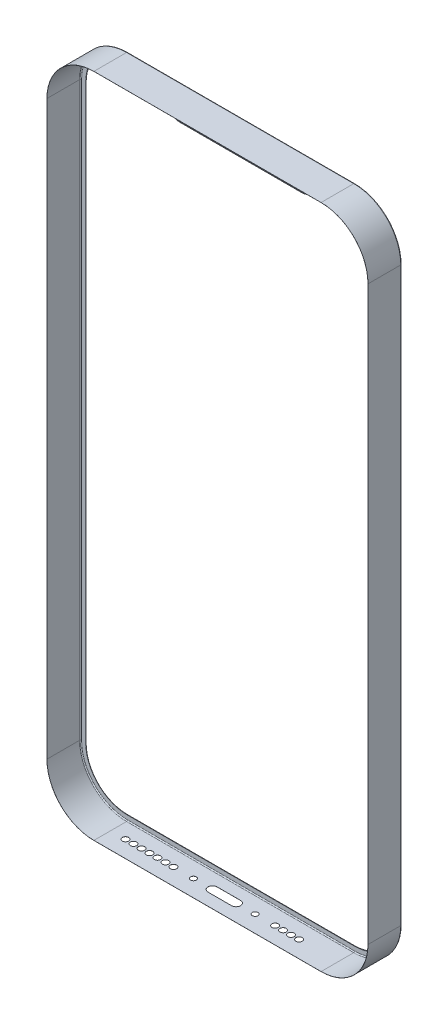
ISO-10303-21;
HEADER;
FILE_DESCRIPTION(('STEP AP214'),'2;1');
FILE_NAME('part.step','',(''),(''),'','','');
FILE_SCHEMA(('AUTOMOTIVE_DESIGN { 1 0 10303 214 1 1 1 1 }'));
ENDSEC;
DATA;
#1=APPLICATION_CONTEXT('core data for automotive mechanical design processes');
#2=APPLICATION_PROTOCOL_DEFINITION('international standard','automotive_design',2000,#1);
#3=PRODUCT_CONTEXT('',#1,'mechanical');
#4=PRODUCT('Part','Part','',(#3));
#5=PRODUCT_RELATED_PRODUCT_CATEGORY('part','',(#4));
#6=PRODUCT_DEFINITION_FORMATION('','',#4);
#7=PRODUCT_DEFINITION_CONTEXT('part definition',#1,'design');
#8=PRODUCT_DEFINITION('design','',#6,#7);
#9=PRODUCT_DEFINITION_SHAPE('','',#8);
#10=(LENGTH_UNIT() NAMED_UNIT(*) SI_UNIT(.MILLI.,.METRE.));
#11=(NAMED_UNIT(*) PLANE_ANGLE_UNIT() SI_UNIT($,.RADIAN.));
#12=(NAMED_UNIT(*) SI_UNIT($,.STERADIAN.) SOLID_ANGLE_UNIT());
#13=UNCERTAINTY_MEASURE_WITH_UNIT(LENGTH_MEASURE(1.E-05),#10,'distance_accuracy_value','');
#14=(GEOMETRIC_REPRESENTATION_CONTEXT(3) GLOBAL_UNCERTAINTY_ASSIGNED_CONTEXT((#13)) GLOBAL_UNIT_ASSIGNED_CONTEXT((#10,
#11,#12)) REPRESENTATION_CONTEXT('',''));
#15=CARTESIAN_POINT('',(0.,0.,0.));
#16=DIRECTION('',(0.,0.,1.));
#17=DIRECTION('',(1.,0.,0.));
#18=AXIS2_PLACEMENT_3D('',#15,#16,#17);
#19=CARTESIAN_POINT('',(17.55,73.9999999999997,0.));
#20=DIRECTION('',(0.,1.,0.));
#21=DIRECTION('',(-1.,0.,0.));
#22=AXIS2_PLACEMENT_3D('',#19,#20,#21);
#23=CYLINDRICAL_SURFACE('',#22,0.0500000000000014);
#24=CARTESIAN_POINT('',(17.55,76.85,0.));
#25=DIRECTION('',(0.,1.,0.));
#26=DIRECTION('',(-1.,0.,0.));
#27=AXIS2_PLACEMENT_3D('',#24,#25,#26);
#28=CIRCLE('',#27,0.05);
#29=CARTESIAN_POINT('',(17.5219330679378,76.85,0.0413793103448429));
#30=VERTEX_POINT('',#29);
#31=CARTESIAN_POINT('',(17.55,76.85,0.05));
#32=VERTEX_POINT('',#31);
#33=EDGE_CURVE('E1890',#30,#32,#28,.T.);
#34=ORIENTED_EDGE('',*,*,#33,.F.);
#35=DIRECTION('',(0.,1.,0.));
#36=VECTOR('',#35,1.);
#37=CARTESIAN_POINT('',(17.5219330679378,73.9999999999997,0.041379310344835));
#38=LINE('',#37,#36);
#39=CARTESIAN_POINT('',(17.5219330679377,74.,0.0413793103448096));
#40=VERTEX_POINT('',#39);
#41=EDGE_CURVE('E1927',#30,#40,#38,.F.);
#42=ORIENTED_EDGE('',*,*,#41,.T.);
#43=CARTESIAN_POINT('',(17.55,74.,0.));
#44=DIRECTION('',(0.,-1.,0.));
#45=DIRECTION('',(1.,0.,0.));
#46=AXIS2_PLACEMENT_3D('',#43,#44,#45);
#47=CIRCLE('',#46,0.05);
#48=CARTESIAN_POINT('',(17.55,74.,0.05));
#49=VERTEX_POINT('',#48);
#50=EDGE_CURVE('E2219',#49,#40,#47,.T.);
#51=ORIENTED_EDGE('',*,*,#50,.F.);
#52=DIRECTION('',(0.,1.,0.));
#53=VECTOR('',#52,1.);
#54=CARTESIAN_POINT('',(17.55,75.425,0.05));
#55=LINE('',#54,#53);
#56=EDGE_CURVE('E1854',#32,#49,#55,.F.);
#57=ORIENTED_EDGE('',*,*,#56,.F.);
#58=EDGE_LOOP('',(#34,#42,#51,#57));
#59=FACE_BOUND('',#58,.T.);
#60=ADVANCED_FACE('F17',(#59),#23,.T.);
#61=CARTESIAN_POINT('',(18.5,76.85,0.));
#62=DIRECTION('',(0.,0.,-1.));
#63=DIRECTION('',(-1.,0.,0.));
#64=AXIS2_PLACEMENT_3D('',#61,#62,#63);
#65=TOROIDAL_SURFACE('',#64,0.95,0.05);
#66=CARTESIAN_POINT('',(18.5,77.8,0.));
#67=DIRECTION('',(1.,0.,0.));
#68=DIRECTION('',(0.,0.,-1.));
#69=AXIS2_PLACEMENT_3D('',#66,#67,#68);
#70=CIRCLE('',#69,0.05);
#71=CARTESIAN_POINT('',(18.5,77.8280669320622,0.0413793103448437));
#72=VERTEX_POINT('',#71);
#73=CARTESIAN_POINT('',(18.5,77.8,0.05));
#74=VERTEX_POINT('',#73);
#75=EDGE_CURVE('E1892',#72,#74,#70,.T.);
#76=ORIENTED_EDGE('',*,*,#75,.F.);
#77=CARTESIAN_POINT('',(18.5,76.85,0.0413793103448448));
#78=DIRECTION('',(0.,0.,1.));
#79=DIRECTION('',(1.,0.,0.));
#80=AXIS2_PLACEMENT_3D('',#77,#78,#79);
#81=CIRCLE('',#80,0.978066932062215);
#82=EDGE_CURVE('E1923',#72,#30,#81,.T.);
#83=ORIENTED_EDGE('',*,*,#82,.T.);
#84=ORIENTED_EDGE('',*,*,#33,.T.);
#85=CARTESIAN_POINT('',(18.5,76.85,0.05));
#86=DIRECTION('',(0.,0.,-1.));
#87=DIRECTION('',(-1.,0.,0.));
#88=AXIS2_PLACEMENT_3D('',#85,#86,#87);
#89=CIRCLE('',#88,0.95);
#90=EDGE_CURVE('E1780',#32,#74,#89,.T.);
#91=ORIENTED_EDGE('',*,*,#90,.T.);
#92=EDGE_LOOP('',(#76,#83,#84,#91));
#93=FACE_BOUND('',#92,.T.);
#94=ADVANCED_FACE('F1897',(#93),#65,.T.);
#95=CARTESIAN_POINT('',(-14.5,77.8,0.));
#96=DIRECTION('',(1.,0.,0.));
#97=DIRECTION('',(0.,0.,-1.));
#98=AXIS2_PLACEMENT_3D('',#95,#96,#97);
#99=CYLINDRICAL_SURFACE('',#98,0.05);
#100=CARTESIAN_POINT('',(27.,77.8,0.));
#101=DIRECTION('',(1.,0.,0.));
#102=DIRECTION('',(0.,1.,0.));
#103=AXIS2_PLACEMENT_3D('',#100,#101,#102);
#104=CIRCLE('',#103,0.05);
#105=CARTESIAN_POINT('',(27.,77.8280669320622,0.0413793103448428));
#106=VERTEX_POINT('',#105);
#107=CARTESIAN_POINT('',(27.,77.8,0.05));
#108=VERTEX_POINT('',#107);
#109=EDGE_CURVE('E1917',#106,#108,#104,.T.);
#110=ORIENTED_EDGE('',*,*,#109,.F.);
#111=DIRECTION('',(1.,0.,0.));
#112=VECTOR('',#111,1.);
#113=CARTESIAN_POINT('',(-14.5,77.8280669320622,0.0413793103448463));
#114=LINE('',#113,#112);
#115=EDGE_CURVE('E1934',#106,#72,#114,.F.);
#116=ORIENTED_EDGE('',*,*,#115,.T.);
#117=ORIENTED_EDGE('',*,*,#75,.T.);
#118=DIRECTION('',(1.,0.,0.));
#119=VECTOR('',#118,1.);
#120=CARTESIAN_POINT('',(22.75,77.8,0.05));
#121=LINE('',#120,#119);
#122=EDGE_CURVE('E1776',#108,#74,#121,.F.);
#123=ORIENTED_EDGE('',*,*,#122,.F.);
#124=EDGE_LOOP('',(#110,#116,#117,#123));
#125=FACE_BOUND('',#124,.T.);
#126=ADVANCED_FACE('F1900',(#125),#99,.T.);
#127=CARTESIAN_POINT('',(27.,68.,0.));
#128=DIRECTION('',(0.,0.,-1.));
#129=DIRECTION('',(-1.,0.,0.));
#130=AXIS2_PLACEMENT_3D('',#127,#128,#129);
#131=TOROIDAL_SURFACE('',#130,9.79999999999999,0.05);
#132=CARTESIAN_POINT('',(36.8,68.,0.));
#133=DIRECTION('',(0.,-1.,0.));
#134=DIRECTION('',(1.,0.,0.));
#135=AXIS2_PLACEMENT_3D('',#132,#133,#134);
#136=CIRCLE('',#135,0.0500000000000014);
#137=CARTESIAN_POINT('',(36.8280669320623,68.,0.0413793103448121));
#138=VERTEX_POINT('',#137);
#139=CARTESIAN_POINT('',(36.8,68.,0.0500000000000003));
#140=VERTEX_POINT('',#139);
#141=EDGE_CURVE('E1920',#138,#140,#136,.T.);
#142=ORIENTED_EDGE('',*,*,#141,.F.);
#143=CARTESIAN_POINT('',(27.,68.,0.0413793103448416));
#144=DIRECTION('',(0.,0.,1.));
#145=DIRECTION('',(1.,0.,0.));
#146=AXIS2_PLACEMENT_3D('',#143,#144,#145);
#147=CIRCLE('',#146,9.82806693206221);
#148=EDGE_CURVE('E1957',#138,#106,#147,.T.);
#149=ORIENTED_EDGE('',*,*,#148,.T.);
#150=ORIENTED_EDGE('',*,*,#109,.T.);
#151=CARTESIAN_POINT('',(27.,68.,0.05));
#152=DIRECTION('',(0.,0.,-1.));
#153=DIRECTION('',(-1.,0.,0.));
#154=AXIS2_PLACEMENT_3D('',#151,#152,#153);
#155=CIRCLE('',#154,9.8);
#156=EDGE_CURVE('E1783',#108,#140,#155,.T.);
#157=ORIENTED_EDGE('',*,*,#156,.T.);
#158=EDGE_LOOP('',(#142,#149,#150,#157));
#159=FACE_BOUND('',#158,.T.);
#160=ADVANCED_FACE('F1904',(#159),#131,.T.);
#161=CARTESIAN_POINT('',(36.8,74.,0.));
#162=DIRECTION('',(0.,-1.,0.));
#163=DIRECTION('',(1.,0.,0.));
#164=AXIS2_PLACEMENT_3D('',#161,#162,#163);
#165=CYLINDRICAL_SURFACE('',#164,0.0500000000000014);
#166=CARTESIAN_POINT('',(36.8,-68.,0.));
#167=DIRECTION('',(0.,-1.,0.));
#168=DIRECTION('',(1.,0.,0.));
#169=AXIS2_PLACEMENT_3D('',#166,#167,#168);
#170=CIRCLE('',#169,0.05);
#171=CARTESIAN_POINT('',(36.8280669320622,-68.,0.0413793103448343));
#172=VERTEX_POINT('',#171);
#173=CARTESIAN_POINT('',(36.8,-68.,0.05));
#174=VERTEX_POINT('',#173);
#175=EDGE_CURVE('E1972',#172,#174,#170,.T.);
#176=ORIENTED_EDGE('',*,*,#175,.F.);
#177=DIRECTION('',(0.,-1.,0.));
#178=VECTOR('',#177,1.);
#179=CARTESIAN_POINT('',(36.8280669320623,74.,0.0413793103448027));
#180=LINE('',#179,#178);
#181=EDGE_CURVE('E1975',#172,#138,#180,.F.);
#182=ORIENTED_EDGE('',*,*,#181,.T.);
#183=ORIENTED_EDGE('',*,*,#141,.T.);
#184=DIRECTION('',(0.,-1.,0.));
#185=VECTOR('',#184,1.);
#186=CARTESIAN_POINT('',(36.8,0.,0.05));
#187=LINE('',#186,#185);
#188=EDGE_CURVE('E1785',#174,#140,#187,.F.);
#189=ORIENTED_EDGE('',*,*,#188,.F.);
#190=EDGE_LOOP('',(#176,#182,#183,#189));
#191=FACE_BOUND('',#190,.T.);
#192=ADVANCED_FACE('F1909',(#191),#165,.T.);
#193=CARTESIAN_POINT('',(27.,-68.,0.));
#194=DIRECTION('',(0.,0.,-1.));
#195=DIRECTION('',(-1.,0.,0.));
#196=AXIS2_PLACEMENT_3D('',#193,#194,#195);
#197=TOROIDAL_SURFACE('',#196,9.79999999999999,0.05);
#198=CARTESIAN_POINT('',(27.,-77.8,0.));
#199=DIRECTION('',(-1.,0.,0.));
#200=DIRECTION('',(0.,-1.,0.));
#201=AXIS2_PLACEMENT_3D('',#198,#199,#200);
#202=CIRCLE('',#201,0.0499999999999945);
#203=CARTESIAN_POINT('',(27.,-77.8280669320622,0.0413793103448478));
#204=VERTEX_POINT('',#203);
#205=CARTESIAN_POINT('',(27.,-77.8,0.0499999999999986));
#206=VERTEX_POINT('',#205);
#207=EDGE_CURVE('E1977',#204,#206,#202,.T.);
#208=ORIENTED_EDGE('',*,*,#207,.F.);
#209=CARTESIAN_POINT('',(27.,-68.,0.0413793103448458));
#210=DIRECTION('',(0.,0.,1.));
#211=DIRECTION('',(1.,0.,0.));
#212=AXIS2_PLACEMENT_3D('',#209,#210,#211);
#213=CIRCLE('',#212,9.8280669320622);
#214=EDGE_CURVE('E2349',#204,#172,#213,.T.);
#215=ORIENTED_EDGE('',*,*,#214,.T.);
#216=ORIENTED_EDGE('',*,*,#175,.T.);
#217=CARTESIAN_POINT('',(27.,-68.,0.05));
#218=DIRECTION('',(0.,0.,-1.));
#219=DIRECTION('',(-1.,0.,0.));
#220=AXIS2_PLACEMENT_3D('',#217,#218,#219);
#221=CIRCLE('',#220,9.8);
#222=EDGE_CURVE('E1794',#174,#206,#221,.T.);
#223=ORIENTED_EDGE('',*,*,#222,.T.);
#224=EDGE_LOOP('',(#208,#215,#216,#223));
#225=FACE_BOUND('',#224,.T.);
#226=ADVANCED_FACE('F2365',(#225),#197,.T.);
#227=CARTESIAN_POINT('',(-14.5,-77.8,0.));
#228=DIRECTION('',(-1.,0.,0.));
#229=DIRECTION('',(0.,-1.,0.));
#230=AXIS2_PLACEMENT_3D('',#227,#228,#229);
#231=CYLINDRICAL_SURFACE('',#230,0.0499999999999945);
#232=CARTESIAN_POINT('',(-27.,-77.8,0.));
#233=DIRECTION('',(-1.,0.,0.));
#234=DIRECTION('',(0.,-1.,0.));
#235=AXIS2_PLACEMENT_3D('',#232,#233,#234);
#236=CIRCLE('',#235,0.05);
#237=CARTESIAN_POINT('',(-27.,-77.8280669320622,0.0413793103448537));
#238=VERTEX_POINT('',#237);
#239=CARTESIAN_POINT('',(-27.,-77.8,0.05));
#240=VERTEX_POINT('',#239);
#241=EDGE_CURVE('E2343',#238,#240,#236,.T.);
#242=ORIENTED_EDGE('',*,*,#241,.F.);
#243=DIRECTION('',(-1.,0.,0.));
#244=VECTOR('',#243,1.);
#245=CARTESIAN_POINT('',(-14.5,-77.8280669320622,0.0413793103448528));
#246=LINE('',#245,#244);
#247=EDGE_CURVE('E2378',#238,#204,#246,.F.);
#248=ORIENTED_EDGE('',*,*,#247,.T.);
#249=ORIENTED_EDGE('',*,*,#207,.T.);
#250=DIRECTION('',(-1.,0.,0.));
#251=VECTOR('',#250,1.);
#252=CARTESIAN_POINT('',(0.,-77.8,0.05));
#253=LINE('',#252,#251);
#254=EDGE_CURVE('E1796',#240,#206,#253,.F.);
#255=ORIENTED_EDGE('',*,*,#254,.F.);
#256=EDGE_LOOP('',(#242,#248,#249,#255));
#257=FACE_BOUND('',#256,.T.);
#258=ADVANCED_FACE('F2336',(#257),#231,.T.);
#259=CARTESIAN_POINT('',(-27.,-68.,0.));
#260=DIRECTION('',(0.,0.,-1.));
#261=DIRECTION('',(-1.,0.,0.));
#262=AXIS2_PLACEMENT_3D('',#259,#260,#261);
#263=TOROIDAL_SURFACE('',#262,9.80000000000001,0.05);
#264=CARTESIAN_POINT('',(-36.8,-68.,0.));
#265=DIRECTION('',(0.,1.,0.));
#266=DIRECTION('',(-1.,0.,0.));
#267=AXIS2_PLACEMENT_3D('',#264,#265,#266);
#268=CIRCLE('',#267,0.0500000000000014);
#269=CARTESIAN_POINT('',(-36.8280669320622,-68.,0.0413793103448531));
#270=VERTEX_POINT('',#269);
#271=CARTESIAN_POINT('',(-36.8,-68.,0.0500000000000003));
#272=VERTEX_POINT('',#271);
#273=EDGE_CURVE('E2346',#270,#272,#268,.T.);
#274=ORIENTED_EDGE('',*,*,#273,.F.);
#275=CARTESIAN_POINT('',(-27.,-68.,0.0413793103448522));
#276=DIRECTION('',(0.,0.,1.));
#277=DIRECTION('',(1.,0.,0.));
#278=AXIS2_PLACEMENT_3D('',#275,#276,#277);
#279=CIRCLE('',#278,9.82806693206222);
#280=EDGE_CURVE('E2389',#270,#238,#279,.T.);
#281=ORIENTED_EDGE('',*,*,#280,.T.);
#282=ORIENTED_EDGE('',*,*,#241,.T.);
#283=CARTESIAN_POINT('',(-27.,-68.,0.05));
#284=DIRECTION('',(0.,0.,-1.));
#285=DIRECTION('',(-1.,0.,0.));
#286=AXIS2_PLACEMENT_3D('',#283,#284,#285);
#287=CIRCLE('',#286,9.80000000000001);
#288=EDGE_CURVE('E1805',#240,#272,#287,.T.);
#289=ORIENTED_EDGE('',*,*,#288,.T.);
#290=EDGE_LOOP('',(#274,#281,#282,#289));
#291=FACE_BOUND('',#290,.T.);
#292=ADVANCED_FACE('F2331',(#291),#263,.T.);
#293=CARTESIAN_POINT('',(-36.8,74.,0.));
#294=DIRECTION('',(0.,1.,0.));
#295=DIRECTION('',(-1.,0.,0.));
#296=AXIS2_PLACEMENT_3D('',#293,#294,#295);
#297=CYLINDRICAL_SURFACE('',#296,0.0500000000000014);
#298=CARTESIAN_POINT('',(-36.8,68.,0.));
#299=DIRECTION('',(0.,1.,0.));
#300=DIRECTION('',(-1.,0.,0.));
#301=AXIS2_PLACEMENT_3D('',#298,#299,#300);
#302=CIRCLE('',#301,0.05);
#303=CARTESIAN_POINT('',(-36.8280669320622,68.,0.0413793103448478));
#304=VERTEX_POINT('',#303);
#305=CARTESIAN_POINT('',(-36.8,68.,0.05));
#306=VERTEX_POINT('',#305);
#307=EDGE_CURVE('E2312',#304,#306,#302,.T.);
#308=ORIENTED_EDGE('',*,*,#307,.F.);
#309=DIRECTION('',(0.,1.,0.));
#310=VECTOR('',#309,1.);
#311=CARTESIAN_POINT('',(-36.8280669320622,74.,0.0413793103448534));
#312=LINE('',#311,#310);
#313=EDGE_CURVE('E2315',#304,#270,#312,.F.);
#314=ORIENTED_EDGE('',*,*,#313,.T.);
#315=ORIENTED_EDGE('',*,*,#273,.T.);
#316=DIRECTION('',(0.,1.,0.));
#317=VECTOR('',#316,1.);
#318=CARTESIAN_POINT('',(-36.8,0.,0.05));
#319=LINE('',#318,#317);
#320=EDGE_CURVE('E1807',#306,#272,#319,.F.);
#321=ORIENTED_EDGE('',*,*,#320,.F.);
#322=EDGE_LOOP('',(#308,#314,#315,#321));
#323=FACE_BOUND('',#322,.T.);
#324=ADVANCED_FACE('F2327',(#323),#297,.T.);
#325=CARTESIAN_POINT('',(-27.,68.,0.));
#326=DIRECTION('',(0.,0.,-1.));
#327=DIRECTION('',(-1.,0.,0.));
#328=AXIS2_PLACEMENT_3D('',#325,#326,#327);
#329=TOROIDAL_SURFACE('',#328,9.8,0.05);
#330=CARTESIAN_POINT('',(-27.,77.8,0.));
#331=DIRECTION('',(1.,0.,0.));
#332=DIRECTION('',(0.,0.,-1.));
#333=AXIS2_PLACEMENT_3D('',#330,#331,#332);
#334=CIRCLE('',#333,0.05);
#335=CARTESIAN_POINT('',(-27.,77.8280669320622,0.0413793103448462));
#336=VERTEX_POINT('',#335);
#337=CARTESIAN_POINT('',(-27.,77.8,0.05));
#338=VERTEX_POINT('',#337);
#339=EDGE_CURVE('E2300',#336,#338,#334,.T.);
#340=ORIENTED_EDGE('',*,*,#339,.F.);
#341=CARTESIAN_POINT('',(-27.,68.,0.0413793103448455));
#342=DIRECTION('',(0.,0.,1.));
#343=DIRECTION('',(1.,0.,0.));
#344=AXIS2_PLACEMENT_3D('',#341,#342,#343);
#345=CIRCLE('',#344,9.82806693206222);
#346=EDGE_CURVE('E2303',#336,#304,#345,.T.);
#347=ORIENTED_EDGE('',*,*,#346,.T.);
#348=ORIENTED_EDGE('',*,*,#307,.T.);
#349=CARTESIAN_POINT('',(-27.,68.,0.05));
#350=DIRECTION('',(0.,0.,-1.));
#351=DIRECTION('',(-1.,0.,0.));
#352=AXIS2_PLACEMENT_3D('',#349,#350,#351);
#353=CIRCLE('',#352,9.8);
#354=EDGE_CURVE('E1816',#306,#338,#353,.T.);
#355=ORIENTED_EDGE('',*,*,#354,.T.);
#356=EDGE_LOOP('',(#340,#347,#348,#355));
#357=FACE_BOUND('',#356,.T.);
#358=ADVANCED_FACE('F2324',(#357),#329,.T.);
#359=CARTESIAN_POINT('',(-14.5,77.8,0.));
#360=DIRECTION('',(1.,0.,0.));
#361=DIRECTION('',(0.,0.,-1.));
#362=AXIS2_PLACEMENT_3D('',#359,#360,#361);
#363=CYLINDRICAL_SURFACE('',#362,0.05);
#364=CARTESIAN_POINT('',(-18.5,77.8,0.));
#365=DIRECTION('',(1.,0.,0.));
#366=DIRECTION('',(0.,1.,0.));
#367=AXIS2_PLACEMENT_3D('',#364,#365,#366);
#368=CIRCLE('',#367,0.05);
#369=CARTESIAN_POINT('',(-18.5,77.8280669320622,0.0413793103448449));
#370=VERTEX_POINT('',#369);
#371=CARTESIAN_POINT('',(-18.5,77.8,0.05));
#372=VERTEX_POINT('',#371);
#373=EDGE_CURVE('E2296',#370,#372,#368,.T.);
#374=ORIENTED_EDGE('',*,*,#373,.F.);
#375=DIRECTION('',(1.,0.,0.));
#376=VECTOR('',#375,1.);
#377=CARTESIAN_POINT('',(-14.5,77.8280669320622,0.0413793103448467));
#378=LINE('',#377,#376);
#379=EDGE_CURVE('E2720',#370,#336,#378,.F.);
#380=ORIENTED_EDGE('',*,*,#379,.T.);
#381=ORIENTED_EDGE('',*,*,#339,.T.);
#382=DIRECTION('',(1.,0.,0.));
#383=VECTOR('',#382,1.);
#384=CARTESIAN_POINT('',(-22.75,77.8,0.05));
#385=LINE('',#384,#383);
#386=EDGE_CURVE('E1818',#372,#338,#385,.F.);
#387=ORIENTED_EDGE('',*,*,#386,.F.);
#388=EDGE_LOOP('',(#374,#380,#381,#387));
#389=FACE_BOUND('',#388,.T.);
#390=ADVANCED_FACE('F2288',(#389),#363,.T.);
#391=CARTESIAN_POINT('',(-18.5,76.85,0.));
#392=DIRECTION('',(0.,0.,-1.));
#393=DIRECTION('',(-1.,0.,0.));
#394=AXIS2_PLACEMENT_3D('',#391,#392,#393);
#395=TOROIDAL_SURFACE('',#394,0.95,0.05);
#396=CARTESIAN_POINT('',(-17.55,76.85,0.));
#397=DIRECTION('',(0.,-1.,0.));
#398=DIRECTION('',(1.,0.,0.));
#399=AXIS2_PLACEMENT_3D('',#396,#397,#398);
#400=CIRCLE('',#399,0.0500000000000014);
#401=CARTESIAN_POINT('',(-17.5219330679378,76.85,0.041379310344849));
#402=VERTEX_POINT('',#401);
#403=CARTESIAN_POINT('',(-17.55,76.85,0.0500000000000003));
#404=VERTEX_POINT('',#403);
#405=EDGE_CURVE('E2299',#402,#404,#400,.T.);
#406=ORIENTED_EDGE('',*,*,#405,.F.);
#407=CARTESIAN_POINT('',(-18.5,76.85,0.0413793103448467));
#408=DIRECTION('',(0.,0.,1.));
#409=DIRECTION('',(1.,0.,0.));
#410=AXIS2_PLACEMENT_3D('',#407,#408,#409);
#411=CIRCLE('',#410,0.978066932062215);
#412=EDGE_CURVE('E2715',#402,#370,#411,.T.);
#413=ORIENTED_EDGE('',*,*,#412,.T.);
#414=ORIENTED_EDGE('',*,*,#373,.T.);
#415=CARTESIAN_POINT('',(-18.5,76.85,0.05));
#416=DIRECTION('',(0.,0.,-1.));
#417=DIRECTION('',(-1.,0.,0.));
#418=AXIS2_PLACEMENT_3D('',#415,#416,#417);
#419=CIRCLE('',#418,0.95);
#420=EDGE_CURVE('E1827',#372,#404,#419,.T.);
#421=ORIENTED_EDGE('',*,*,#420,.T.);
#422=EDGE_LOOP('',(#406,#413,#414,#421));
#423=FACE_BOUND('',#422,.T.);
#424=ADVANCED_FACE('F2283',(#423),#395,.T.);
#425=CARTESIAN_POINT('',(-17.55,74.,0.));
#426=DIRECTION('',(0.,-1.,0.));
#427=DIRECTION('',(1.,0.,0.));
#428=AXIS2_PLACEMENT_3D('',#425,#426,#427);
#429=CYLINDRICAL_SURFACE('',#428,0.0500000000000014);
#430=CARTESIAN_POINT('',(-17.55,74.,0.));
#431=DIRECTION('',(0.,1.,0.));
#432=DIRECTION('',(-1.,0.,0.));
#433=AXIS2_PLACEMENT_3D('',#430,#431,#432);
#434=CIRCLE('',#433,0.05);
#435=CARTESIAN_POINT('',(-17.5219330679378,74.,0.0413793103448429));
#436=VERTEX_POINT('',#435);
#437=CARTESIAN_POINT('',(-17.55,74.,0.05));
#438=VERTEX_POINT('',#437);
#439=EDGE_CURVE('E2264',#436,#438,#434,.F.);
#440=ORIENTED_EDGE('',*,*,#439,.F.);
#441=DIRECTION('',(0.,-1.,0.));
#442=VECTOR('',#441,1.);
#443=CARTESIAN_POINT('',(-17.5219330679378,74.,0.0413793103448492));
#444=LINE('',#443,#442);
#445=EDGE_CURVE('E2267',#436,#402,#444,.F.);
#446=ORIENTED_EDGE('',*,*,#445,.T.);
#447=ORIENTED_EDGE('',*,*,#405,.T.);
#448=DIRECTION('',(0.,-1.,0.));
#449=VECTOR('',#448,1.);
#450=CARTESIAN_POINT('',(-17.55,75.425,0.05));
#451=LINE('',#450,#449);
#452=EDGE_CURVE('E1829',#438,#404,#451,.F.);
#453=ORIENTED_EDGE('',*,*,#452,.F.);
#454=EDGE_LOOP('',(#440,#446,#447,#453));
#455=FACE_BOUND('',#454,.T.);
#456=ADVANCED_FACE('F2279',(#455),#429,.T.);
#457=CARTESIAN_POINT('',(-14.5,74.,0.));
#458=DIRECTION('',(0.,0.,-1.));
#459=DIRECTION('',(-1.,0.,0.));
#460=AXIS2_PLACEMENT_3D('',#457,#458,#459);
#461=TOROIDAL_SURFACE('',#460,3.05,0.05);
#462=CARTESIAN_POINT('',(-14.5,70.95,0.));
#463=DIRECTION('',(1.,0.,0.));
#464=DIRECTION('',(0.,0.,-1.));
#465=AXIS2_PLACEMENT_3D('',#462,#463,#464);
#466=CIRCLE('',#465,0.05);
#467=CARTESIAN_POINT('',(-14.5,70.9780669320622,0.0413793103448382));
#468=VERTEX_POINT('',#467);
#469=CARTESIAN_POINT('',(-14.5,70.95,0.05));
#470=VERTEX_POINT('',#469);
#471=EDGE_CURVE('E2245',#468,#470,#466,.T.);
#472=ORIENTED_EDGE('',*,*,#471,.F.);
#473=CARTESIAN_POINT('',(-14.5,74.,0.0413793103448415));
#474=DIRECTION('',(0.,0.,-1.));
#475=DIRECTION('',(-1.,0.,0.));
#476=AXIS2_PLACEMENT_3D('',#473,#474,#475);
#477=CIRCLE('',#476,3.02193306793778);
#478=EDGE_CURVE('E2255',#468,#436,#477,.T.);
#479=ORIENTED_EDGE('',*,*,#478,.T.);
#480=ORIENTED_EDGE('',*,*,#439,.T.);
#481=CARTESIAN_POINT('',(-14.5,74.,0.05));
#482=DIRECTION('',(0.,0.,-1.));
#483=DIRECTION('',(-1.,0.,0.));
#484=AXIS2_PLACEMENT_3D('',#481,#482,#483);
#485=CIRCLE('',#484,3.05);
#486=EDGE_CURVE('E1838',#470,#438,#485,.T.);
#487=ORIENTED_EDGE('',*,*,#486,.F.);
#488=EDGE_LOOP('',(#472,#479,#480,#487));
#489=FACE_BOUND('',#488,.T.);
#490=ADVANCED_FACE('F2276',(#489),#461,.T.);
#491=CARTESIAN_POINT('',(-14.5,70.95,0.));
#492=DIRECTION('',(1.,0.,0.));
#493=DIRECTION('',(0.,0.,-1.));
#494=AXIS2_PLACEMENT_3D('',#491,#492,#493);
#495=CYLINDRICAL_SURFACE('',#494,0.05);
#496=CARTESIAN_POINT('',(14.4999999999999,70.95,0.));
#497=DIRECTION('',(-1.,0.,0.));
#498=DIRECTION('',(0.,-1.,0.));
#499=AXIS2_PLACEMENT_3D('',#496,#497,#498);
#500=CIRCLE('',#499,0.05);
#501=CARTESIAN_POINT('',(14.4999999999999,70.9780669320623,0.0413793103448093));
#502=VERTEX_POINT('',#501);
#503=CARTESIAN_POINT('',(14.4999999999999,70.95,0.05));
#504=VERTEX_POINT('',#503);
#505=EDGE_CURVE('E2242',#502,#504,#500,.F.);
#506=ORIENTED_EDGE('',*,*,#505,.F.);
#507=DIRECTION('',(1.,0.,0.));
#508=VECTOR('',#507,1.);
#509=CARTESIAN_POINT('',(-14.5,70.9780669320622,0.041379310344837));
#510=LINE('',#509,#508);
#511=EDGE_CURVE('E2224',#502,#468,#510,.F.);
#512=ORIENTED_EDGE('',*,*,#511,.T.);
#513=ORIENTED_EDGE('',*,*,#471,.T.);
#514=DIRECTION('',(1.,0.,0.));
#515=VECTOR('',#514,1.);
#516=CARTESIAN_POINT('',(0.,70.95,0.05));
#517=LINE('',#516,#515);
#518=EDGE_CURVE('E1844',#504,#470,#517,.F.);
#519=ORIENTED_EDGE('',*,*,#518,.F.);
#520=EDGE_LOOP('',(#506,#512,#513,#519));
#521=FACE_BOUND('',#520,.T.);
#522=ADVANCED_FACE('F2234',(#521),#495,.T.);
#523=CARTESIAN_POINT('',(14.5,74.,0.));
#524=DIRECTION('',(0.,0.,-1.));
#525=DIRECTION('',(-1.,0.,0.));
#526=AXIS2_PLACEMENT_3D('',#523,#524,#525);
#527=TOROIDAL_SURFACE('',#526,3.05,0.05);
#528=ORIENTED_EDGE('',*,*,#50,.T.);
#529=CARTESIAN_POINT('',(14.5,74.,0.0413793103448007));
#530=DIRECTION('',(0.,0.,-1.));
#531=DIRECTION('',(-1.,0.,0.));
#532=AXIS2_PLACEMENT_3D('',#529,#530,#531);
#533=CIRCLE('',#532,3.02193306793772);
#534=EDGE_CURVE('E2655',#40,#502,#533,.T.);
#535=ORIENTED_EDGE('',*,*,#534,.T.);
#536=ORIENTED_EDGE('',*,*,#505,.T.);
#537=CARTESIAN_POINT('',(14.5,74.,0.05));
#538=DIRECTION('',(0.,0.,-1.));
#539=DIRECTION('',(-1.,0.,0.));
#540=AXIS2_PLACEMENT_3D('',#537,#538,#539);
#541=CIRCLE('',#540,3.05);
#542=EDGE_CURVE('E1861',#49,#504,#541,.T.);
#543=ORIENTED_EDGE('',*,*,#542,.F.);
#544=EDGE_LOOP('',(#528,#535,#536,#543));
#545=FACE_BOUND('',#544,.T.);
#546=ADVANCED_FACE('F2229',(#545),#527,.T.);
#547=CARTESIAN_POINT('',(-7.83166247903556,73.75,-0.24));
#548=DIRECTION('',(0.,0.,1.));
#549=DIRECTION('',(1.,0.,0.));
#550=AXIS2_PLACEMENT_3D('',#547,#548,#549);
#551=TOROIDAL_SURFACE('',#550,1.445,0.3);
#552=CARTESIAN_POINT('',(-7.83166247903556,73.75,0.0299999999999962));
#553=DIRECTION('',(0.,0.,1.));
#554=DIRECTION('',(1.,0.,0.));
#555=AXIS2_PLACEMENT_3D('',#552,#553,#554);
#556=CIRCLE('',#555,1.57576696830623);
#557=CARTESIAN_POINT('',(-6.25589551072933,73.75,0.0299999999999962));
#558=VERTEX_POINT('',#557);
#559=EDGE_CURVE('E2174',#558,#558,#556,.T.);
#560=ORIENTED_EDGE('',*,*,#559,.T.);
#561=EDGE_LOOP('',(#560));
#562=FACE_BOUND('',#561,.T.);
#563=CARTESIAN_POINT('',(-7.83166247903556,73.75,0.06));
#564=DIRECTION('',(0.,0.,1.));
#565=DIRECTION('',(1.,0.,0.));
#566=AXIS2_PLACEMENT_3D('',#563,#564,#565);
#567=CIRCLE('',#566,1.445);
#568=CARTESIAN_POINT('',(-6.38666247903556,73.75,0.06));
#569=VERTEX_POINT('',#568);
#570=EDGE_CURVE('E1887',#569,#569,#567,.F.);
#571=ORIENTED_EDGE('',*,*,#570,.T.);
#572=EDGE_LOOP('',(#571));
#573=FACE_BOUND('',#572,.T.);
#574=ADVANCED_FACE('F2226',(#562,#573),#551,.T.);
#575=CARTESIAN_POINT('',(-3.25000000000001,74.6693519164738,-0.2));
#576=DIRECTION('',(-1.,0.,0.));
#577=DIRECTION('',(0.,0.,1.));
#578=AXIS2_PLACEMENT_3D('',#575,#576,#577);
#579=CYLINDRICAL_SURFACE('',#578,0.3);
#580=CARTESIAN_POINT('',(-3.25,74.6693519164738,-0.2));
#581=DIRECTION('',(-1.,0.,0.));
#582=DIRECTION('',(0.,1.,0.));
#583=AXIS2_PLACEMENT_3D('',#580,#581,#582);
#584=CIRCLE('',#583,0.3);
#585=CARTESIAN_POINT('',(-3.25000000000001,74.6693519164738,0.1));
#586=VERTEX_POINT('',#585);
#587=CARTESIAN_POINT('',(-3.25,74.806788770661,0.0666666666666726));
#588=VERTEX_POINT('',#587);
#589=EDGE_CURVE('E1851',#586,#588,#584,.T.);
#590=ORIENTED_EDGE('',*,*,#589,.F.);
#591=DIRECTION('',(1.,0.,0.));
#592=VECTOR('',#591,1.);
#593=CARTESIAN_POINT('',(0.,74.6693519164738,0.1));
#594=LINE('',#593,#592);
#595=CARTESIAN_POINT('',(3.25,74.6693519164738,0.1));
#596=VERTEX_POINT('',#595);
#597=EDGE_CURVE('E1879',#586,#596,#594,.T.);
#598=ORIENTED_EDGE('',*,*,#597,.T.);
#599=CARTESIAN_POINT('',(3.25,74.6693519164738,-0.2));
#600=DIRECTION('',(-1.,0.,0.));
#601=DIRECTION('',(0.,1.,0.));
#602=AXIS2_PLACEMENT_3D('',#599,#600,#601);
#603=CIRCLE('',#602,0.3);
#604=CARTESIAN_POINT('',(3.25,74.8067887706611,0.0666666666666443));
#605=VERTEX_POINT('',#604);
#606=EDGE_CURVE('E2216',#605,#596,#603,.F.);
#607=ORIENTED_EDGE('',*,*,#606,.F.);
#608=DIRECTION('',(-1.,0.,0.));
#609=VECTOR('',#608,1.);
#610=CARTESIAN_POINT('',(-3.25000000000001,74.806788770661,0.0666666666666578));
#611=LINE('',#610,#609);
#612=EDGE_CURVE('E2171',#605,#588,#611,.T.);
#613=ORIENTED_EDGE('',*,*,#612,.T.);
#614=EDGE_LOOP('',(#590,#598,#607,#613));
#615=FACE_BOUND('',#614,.T.);
#616=ADVANCED_FACE('F2208',(#615),#579,.T.);
#617=CARTESIAN_POINT('',(3.25,73.75,-0.2));
#618=DIRECTION('',(0.,0.,1.));
#619=DIRECTION('',(1.,0.,0.));
#620=AXIS2_PLACEMENT_3D('',#617,#618,#619);
#621=TOROIDAL_SURFACE('',#620,0.919351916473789,0.3);
#622=CARTESIAN_POINT('',(3.25,73.75,0.1));
#623=DIRECTION('',(0.,0.,1.));
#624=DIRECTION('',(1.,0.,0.));
#625=AXIS2_PLACEMENT_3D('',#622,#623,#624);
#626=CIRCLE('',#625,0.919351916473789);
#627=CARTESIAN_POINT('',(3.25,72.8306480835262,0.1));
#628=VERTEX_POINT('',#627);
#629=EDGE_CURVE('E1885',#596,#628,#626,.F.);
#630=ORIENTED_EDGE('',*,*,#629,.T.);
#631=CARTESIAN_POINT('',(3.25,72.8306480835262,-0.2));
#632=DIRECTION('',(1.,0.,0.));
#633=DIRECTION('',(0.,0.,-1.));
#634=AXIS2_PLACEMENT_3D('',#631,#632,#633);
#635=CIRCLE('',#634,0.3);
#636=CARTESIAN_POINT('',(3.25,72.6932112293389,0.0666666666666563));
#637=VERTEX_POINT('',#636);
#638=EDGE_CURVE('E2218',#637,#628,#635,.F.);
#639=ORIENTED_EDGE('',*,*,#638,.F.);
#640=CARTESIAN_POINT('',(3.25,73.75,0.0666666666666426));
#641=DIRECTION('',(0.,0.,1.));
#642=DIRECTION('',(1.,0.,0.));
#643=AXIS2_PLACEMENT_3D('',#640,#641,#642);
#644=CIRCLE('',#643,1.05678877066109);
#645=EDGE_CURVE('E2187',#637,#605,#644,.T.);
#646=ORIENTED_EDGE('',*,*,#645,.T.);
#647=ORIENTED_EDGE('',*,*,#606,.T.);
#648=EDGE_LOOP('',(#630,#639,#646,#647));
#649=FACE_BOUND('',#648,.T.);
#650=ADVANCED_FACE('F2203',(#649),#621,.T.);
#651=CARTESIAN_POINT('',(-3.25000000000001,72.8306480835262,-0.2));
#652=DIRECTION('',(1.,0.,0.));
#653=DIRECTION('',(0.,0.,-1.));
#654=AXIS2_PLACEMENT_3D('',#651,#652,#653);
#655=CYLINDRICAL_SURFACE('',#654,0.3);
#656=CARTESIAN_POINT('',(-3.25000000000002,72.8306480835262,-0.2));
#657=DIRECTION('',(1.,0.,0.));
#658=DIRECTION('',(0.,-1.,0.));
#659=AXIS2_PLACEMENT_3D('',#656,#657,#658);
#660=CIRCLE('',#659,0.3);
#661=CARTESIAN_POINT('',(-3.25000000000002,72.693211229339,0.0666666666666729));
#662=VERTEX_POINT('',#661);
#663=CARTESIAN_POINT('',(-3.25000000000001,72.8306480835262,0.1));
#664=VERTEX_POINT('',#663);
#665=EDGE_CURVE('E4337',#662,#664,#660,.F.);
#666=ORIENTED_EDGE('',*,*,#665,.F.);
#667=DIRECTION('',(1.,0.,0.));
#668=VECTOR('',#667,1.);
#669=CARTESIAN_POINT('',(-3.25000000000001,72.6932112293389,0.0666666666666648));
#670=LINE('',#669,#668);
#671=EDGE_CURVE('E2184',#662,#637,#670,.T.);
#672=ORIENTED_EDGE('',*,*,#671,.T.);
#673=ORIENTED_EDGE('',*,*,#638,.T.);
#674=DIRECTION('',(1.,0.,0.));
#675=VECTOR('',#674,1.);
#676=CARTESIAN_POINT('',(0.,72.8306480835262,0.1));
#677=LINE('',#676,#675);
#678=EDGE_CURVE('E1867',#628,#664,#677,.F.);
#679=ORIENTED_EDGE('',*,*,#678,.T.);
#680=EDGE_LOOP('',(#666,#672,#673,#679));
#681=FACE_BOUND('',#680,.T.);
#682=ADVANCED_FACE('F2198',(#681),#655,.T.);
#683=CARTESIAN_POINT('',(-3.25,73.75,-0.2));
#684=DIRECTION('',(0.,0.,1.));
#685=DIRECTION('',(-1.,0.,0.));
#686=AXIS2_PLACEMENT_3D('',#683,#684,#685);
#687=TOROIDAL_SURFACE('',#686,0.919351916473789,0.3);
#688=ORIENTED_EDGE('',*,*,#589,.T.);
#689=CARTESIAN_POINT('',(-3.25,73.75,0.066666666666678));
#690=DIRECTION('',(0.,0.,1.));
#691=DIRECTION('',(-1.,0.,0.));
#692=AXIS2_PLACEMENT_3D('',#689,#690,#691);
#693=CIRCLE('',#692,1.05678877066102);
#694=EDGE_CURVE('E2177',#588,#662,#693,.T.);
#695=ORIENTED_EDGE('',*,*,#694,.T.);
#696=ORIENTED_EDGE('',*,*,#665,.T.);
#697=CARTESIAN_POINT('',(-3.25,73.75,0.1));
#698=DIRECTION('',(0.,0.,1.));
#699=DIRECTION('',(1.,0.,0.));
#700=AXIS2_PLACEMENT_3D('',#697,#698,#699);
#701=CIRCLE('',#700,0.919351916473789);
#702=EDGE_CURVE('E1873',#664,#586,#701,.F.);
#703=ORIENTED_EDGE('',*,*,#702,.T.);
#704=EDGE_LOOP('',(#688,#695,#696,#703));
#705=FACE_BOUND('',#704,.T.);
#706=ADVANCED_FACE('F2194',(#705),#687,.T.);
#707=CARTESIAN_POINT('',(18.5,76.85,0.));
#708=DIRECTION('',(0.,0.,-1.));
#709=DIRECTION('',(-1.,0.,0.));
#710=AXIS2_PLACEMENT_3D('',#707,#708,#709);
#711=CYLINDRICAL_SURFACE('',#710,0.95);
#712=ORIENTED_EDGE('',*,*,#90,.F.);
#713=DIRECTION('',(-1.73472347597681E-13,0.,-1.));
#714=VECTOR('',#713,1.);
#715=CARTESIAN_POINT('',(17.55,76.85,0.04));
#716=LINE('',#715,#714);
#717=CARTESIAN_POINT('',(17.55,76.85,0.0399999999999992));
#718=VERTEX_POINT('',#717);
#719=EDGE_CURVE('E1858',#718,#32,#716,.F.);
#720=ORIENTED_EDGE('',*,*,#719,.F.);
#721=CARTESIAN_POINT('',(18.5,76.85,0.04));
#722=DIRECTION('',(0.,0.,-1.));
#723=DIRECTION('',(-1.,0.,0.));
#724=AXIS2_PLACEMENT_3D('',#721,#722,#723);
#725=CIRCLE('',#724,0.95);
#726=CARTESIAN_POINT('',(18.5,77.8,0.04));
#727=VERTEX_POINT('',#726);
#728=EDGE_CURVE('E1942',#718,#727,#725,.T.);
#729=ORIENTED_EDGE('',*,*,#728,.T.);
#730=DIRECTION('',(0.,0.,-1.));
#731=VECTOR('',#730,1.);
#732=CARTESIAN_POINT('',(18.5,77.8,0.04));
#733=LINE('',#732,#731);
#734=EDGE_CURVE('E1779',#74,#727,#733,.T.);
#735=ORIENTED_EDGE('',*,*,#734,.F.);
#736=EDGE_LOOP('',(#712,#720,#729,#735));
#737=FACE_BOUND('',#736,.T.);
#738=ADVANCED_FACE('F1939',(#737),#711,.F.);
#739=CARTESIAN_POINT('',(22.75,77.8,0.04));
#740=DIRECTION('',(0.,-1.,0.));
#741=DIRECTION('',(0.,0.,-1.));
#742=AXIS2_PLACEMENT_3D('',#739,#740,#741);
#743=PLANE('',#742);
#744=ORIENTED_EDGE('',*,*,#734,.T.);
#745=DIRECTION('',(1.,0.,0.));
#746=VECTOR('',#745,1.);
#747=CARTESIAN_POINT('',(-14.5,77.8,0.04));
#748=LINE('',#747,#746);
#749=CARTESIAN_POINT('',(27.,77.8,0.04));
#750=VERTEX_POINT('',#749);
#751=EDGE_CURVE('E1949',#727,#750,#748,.T.);
#752=ORIENTED_EDGE('',*,*,#751,.T.);
#753=DIRECTION('',(0.,0.,-1.));
#754=VECTOR('',#753,1.);
#755=CARTESIAN_POINT('',(27.,77.8,0.));
#756=LINE('',#755,#754);
#757=EDGE_CURVE('E1786',#750,#108,#756,.F.);
#758=ORIENTED_EDGE('',*,*,#757,.T.);
#759=ORIENTED_EDGE('',*,*,#122,.T.);
#760=EDGE_LOOP('',(#744,#752,#758,#759));
#761=FACE_BOUND('',#760,.T.);
#762=ADVANCED_FACE('F1946',(#761),#743,.T.);
#763=CARTESIAN_POINT('',(27.,68.,0.));
#764=DIRECTION('',(0.,0.,-1.));
#765=DIRECTION('',(-1.,0.,0.));
#766=AXIS2_PLACEMENT_3D('',#763,#764,#765);
#767=CYLINDRICAL_SURFACE('',#766,9.8);
#768=ORIENTED_EDGE('',*,*,#757,.F.);
#769=CARTESIAN_POINT('',(27.,68.,0.04));
#770=DIRECTION('',(0.,0.,-1.));
#771=DIRECTION('',(-1.,0.,0.));
#772=AXIS2_PLACEMENT_3D('',#769,#770,#771);
#773=CIRCLE('',#772,9.79999999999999);
#774=CARTESIAN_POINT('',(36.8,68.,0.0399999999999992));
#775=VERTEX_POINT('',#774);
#776=EDGE_CURVE('E1962',#750,#775,#773,.T.);
#777=ORIENTED_EDGE('',*,*,#776,.T.);
#778=DIRECTION('',(0.,0.,1.));
#779=VECTOR('',#778,1.);
#780=CARTESIAN_POINT('',(36.8,68.,0.04));
#781=LINE('',#780,#779);
#782=EDGE_CURVE('E1791',#140,#775,#781,.F.);
#783=ORIENTED_EDGE('',*,*,#782,.F.);
#784=ORIENTED_EDGE('',*,*,#156,.F.);
#785=EDGE_LOOP('',(#768,#777,#783,#784));
#786=FACE_BOUND('',#785,.T.);
#787=ADVANCED_FACE('F1959',(#786),#767,.F.);
#788=CARTESIAN_POINT('',(36.8,0.,0.04));
#789=DIRECTION('',(-1.,0.,0.));
#790=DIRECTION('',(0.,-1.,0.));
#791=AXIS2_PLACEMENT_3D('',#788,#789,#790);
#792=PLANE('',#791);
#793=ORIENTED_EDGE('',*,*,#782,.T.);
#794=DIRECTION('',(0.,-1.,0.));
#795=VECTOR('',#794,1.);
#796=CARTESIAN_POINT('',(36.8,74.,0.0399999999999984));
#797=LINE('',#796,#795);
#798=CARTESIAN_POINT('',(36.8,-68.,0.0399999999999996));
#799=VERTEX_POINT('',#798);
#800=EDGE_CURVE('E2150',#775,#799,#797,.T.);
#801=ORIENTED_EDGE('',*,*,#800,.T.);
#802=DIRECTION('',(0.,0.,-1.));
#803=VECTOR('',#802,1.);
#804=CARTESIAN_POINT('',(36.8,-68.,0.));
#805=LINE('',#804,#803);
#806=EDGE_CURVE('E1797',#799,#174,#805,.F.);
#807=ORIENTED_EDGE('',*,*,#806,.T.);
#808=ORIENTED_EDGE('',*,*,#188,.T.);
#809=EDGE_LOOP('',(#793,#801,#807,#808));
#810=FACE_BOUND('',#809,.T.);
#811=ADVANCED_FACE('F1967',(#810),#792,.T.);
#812=CARTESIAN_POINT('',(27.,-68.,0.));
#813=DIRECTION('',(0.,0.,-1.));
#814=DIRECTION('',(-1.,0.,0.));
#815=AXIS2_PLACEMENT_3D('',#812,#813,#814);
#816=CYLINDRICAL_SURFACE('',#815,9.8);
#817=ORIENTED_EDGE('',*,*,#222,.F.);
#818=ORIENTED_EDGE('',*,*,#806,.F.);
#819=CARTESIAN_POINT('',(27.,-68.,0.04));
#820=DIRECTION('',(0.,0.,-1.));
#821=DIRECTION('',(-1.,0.,0.));
#822=AXIS2_PLACEMENT_3D('',#819,#820,#821);
#823=CIRCLE('',#822,9.8);
#824=CARTESIAN_POINT('',(27.,-77.8,0.0399999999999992));
#825=VERTEX_POINT('',#824);
#826=EDGE_CURVE('E2141',#799,#825,#823,.T.);
#827=ORIENTED_EDGE('',*,*,#826,.T.);
#828=DIRECTION('',(0.,0.,1.));
#829=VECTOR('',#828,1.);
#830=CARTESIAN_POINT('',(27.,-77.8,0.04));
#831=LINE('',#830,#829);
#832=EDGE_CURVE('E1802',#206,#825,#831,.F.);
#833=ORIENTED_EDGE('',*,*,#832,.F.);
#834=EDGE_LOOP('',(#817,#818,#827,#833));
#835=FACE_BOUND('',#834,.T.);
#836=ADVANCED_FACE('F2517',(#835),#816,.F.);
#837=CARTESIAN_POINT('',(0.,-77.8,0.04));
#838=DIRECTION('',(0.,1.,0.));
#839=DIRECTION('',(-1.,0.,0.));
#840=AXIS2_PLACEMENT_3D('',#837,#838,#839);
#841=PLANE('',#840);
#842=ORIENTED_EDGE('',*,*,#832,.T.);
#843=DIRECTION('',(-1.,0.,0.));
#844=VECTOR('',#843,1.);
#845=CARTESIAN_POINT('',(-14.5,-77.8,0.0399999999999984));
#846=LINE('',#845,#844);
#847=CARTESIAN_POINT('',(-27.,-77.8,0.0399999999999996));
#848=VERTEX_POINT('',#847);
#849=EDGE_CURVE('E2132',#825,#848,#846,.T.);
#850=ORIENTED_EDGE('',*,*,#849,.T.);
#851=DIRECTION('',(0.,0.,-1.));
#852=VECTOR('',#851,1.);
#853=CARTESIAN_POINT('',(-27.,-77.8,0.));
#854=LINE('',#853,#852);
#855=EDGE_CURVE('E1808',#848,#240,#854,.F.);
#856=ORIENTED_EDGE('',*,*,#855,.T.);
#857=ORIENTED_EDGE('',*,*,#254,.T.);
#858=EDGE_LOOP('',(#842,#850,#856,#857));
#859=FACE_BOUND('',#858,.T.);
#860=ADVANCED_FACE('F2513',(#859),#841,.T.);
#861=CARTESIAN_POINT('',(-27.,-68.,0.));
#862=DIRECTION('',(0.,0.,-1.));
#863=DIRECTION('',(-1.,0.,0.));
#864=AXIS2_PLACEMENT_3D('',#861,#862,#863);
#865=CYLINDRICAL_SURFACE('',#864,9.80000000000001);
#866=ORIENTED_EDGE('',*,*,#288,.F.);
#867=ORIENTED_EDGE('',*,*,#855,.F.);
#868=CARTESIAN_POINT('',(-27.,-68.,0.04));
#869=DIRECTION('',(0.,0.,-1.));
#870=DIRECTION('',(-1.,0.,0.));
#871=AXIS2_PLACEMENT_3D('',#868,#869,#870);
#872=CIRCLE('',#871,9.79999999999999);
#873=CARTESIAN_POINT('',(-36.8,-68.,0.0399999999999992));
#874=VERTEX_POINT('',#873);
#875=EDGE_CURVE('E2123',#848,#874,#872,.T.);
#876=ORIENTED_EDGE('',*,*,#875,.T.);
#877=DIRECTION('',(0.,0.,1.));
#878=VECTOR('',#877,1.);
#879=CARTESIAN_POINT('',(-36.8,-68.,0.04));
#880=LINE('',#879,#878);
#881=EDGE_CURVE('E1813',#272,#874,#880,.F.);
#882=ORIENTED_EDGE('',*,*,#881,.F.);
#883=EDGE_LOOP('',(#866,#867,#876,#882));
#884=FACE_BOUND('',#883,.T.);
#885=ADVANCED_FACE('F2509',(#884),#865,.F.);
#886=CARTESIAN_POINT('',(-36.8,0.,0.04));
#887=DIRECTION('',(1.,0.,0.));
#888=DIRECTION('',(0.,1.,0.));
#889=AXIS2_PLACEMENT_3D('',#886,#887,#888);
#890=PLANE('',#889);
#891=ORIENTED_EDGE('',*,*,#881,.T.);
#892=DIRECTION('',(0.,1.,0.));
#893=VECTOR('',#892,1.);
#894=CARTESIAN_POINT('',(-36.8,74.,0.0399999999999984));
#895=LINE('',#894,#893);
#896=CARTESIAN_POINT('',(-36.8,68.,0.0399999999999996));
#897=VERTEX_POINT('',#896);
#898=EDGE_CURVE('E2114',#874,#897,#895,.T.);
#899=ORIENTED_EDGE('',*,*,#898,.T.);
#900=DIRECTION('',(0.,0.,-1.));
#901=VECTOR('',#900,1.);
#902=CARTESIAN_POINT('',(-36.8,68.,0.));
#903=LINE('',#902,#901);
#904=EDGE_CURVE('E1819',#897,#306,#903,.F.);
#905=ORIENTED_EDGE('',*,*,#904,.T.);
#906=ORIENTED_EDGE('',*,*,#320,.T.);
#907=EDGE_LOOP('',(#891,#899,#905,#906));
#908=FACE_BOUND('',#907,.T.);
#909=ADVANCED_FACE('F2505',(#908),#890,.T.);
#910=CARTESIAN_POINT('',(-27.,68.,0.));
#911=DIRECTION('',(0.,0.,-1.));
#912=DIRECTION('',(-1.,0.,0.));
#913=AXIS2_PLACEMENT_3D('',#910,#911,#912);
#914=CYLINDRICAL_SURFACE('',#913,9.8);
#915=ORIENTED_EDGE('',*,*,#354,.F.);
#916=ORIENTED_EDGE('',*,*,#904,.F.);
#917=CARTESIAN_POINT('',(-27.,68.,0.04));
#918=DIRECTION('',(0.,0.,-1.));
#919=DIRECTION('',(-1.,0.,0.));
#920=AXIS2_PLACEMENT_3D('',#917,#918,#919);
#921=CIRCLE('',#920,9.8);
#922=CARTESIAN_POINT('',(-27.,77.8,0.04));
#923=VERTEX_POINT('',#922);
#924=EDGE_CURVE('E2105',#897,#923,#921,.T.);
#925=ORIENTED_EDGE('',*,*,#924,.T.);
#926=DIRECTION('',(0.,0.,-1.));
#927=VECTOR('',#926,1.);
#928=CARTESIAN_POINT('',(-27.,77.8,0.04));
#929=LINE('',#928,#927);
#930=EDGE_CURVE('E1824',#338,#923,#929,.T.);
#931=ORIENTED_EDGE('',*,*,#930,.F.);
#932=EDGE_LOOP('',(#915,#916,#925,#931));
#933=FACE_BOUND('',#932,.T.);
#934=ADVANCED_FACE('F2501',(#933),#914,.F.);
#935=CARTESIAN_POINT('',(-22.75,77.8,0.04));
#936=DIRECTION('',(0.,-1.,0.));
#937=DIRECTION('',(0.,0.,-1.));
#938=AXIS2_PLACEMENT_3D('',#935,#936,#937);
#939=PLANE('',#938);
#940=ORIENTED_EDGE('',*,*,#930,.T.);
#941=DIRECTION('',(1.,0.,0.));
#942=VECTOR('',#941,1.);
#943=CARTESIAN_POINT('',(-14.5,77.8,0.04));
#944=LINE('',#943,#942);
#945=CARTESIAN_POINT('',(-18.5,77.8,0.04));
#946=VERTEX_POINT('',#945);
#947=EDGE_CURVE('E2096',#923,#946,#944,.T.);
#948=ORIENTED_EDGE('',*,*,#947,.T.);
#949=DIRECTION('',(0.,0.,-1.));
#950=VECTOR('',#949,1.);
#951=CARTESIAN_POINT('',(-18.5,77.8,0.));
#952=LINE('',#951,#950);
#953=EDGE_CURVE('E1830',#946,#372,#952,.F.);
#954=ORIENTED_EDGE('',*,*,#953,.T.);
#955=ORIENTED_EDGE('',*,*,#386,.T.);
#956=EDGE_LOOP('',(#940,#948,#954,#955));
#957=FACE_BOUND('',#956,.T.);
#958=ADVANCED_FACE('F2497',(#957),#939,.T.);
#959=CARTESIAN_POINT('',(-18.5,76.85,0.));
#960=DIRECTION('',(0.,0.,-1.));
#961=DIRECTION('',(-1.,0.,0.));
#962=AXIS2_PLACEMENT_3D('',#959,#960,#961);
#963=CYLINDRICAL_SURFACE('',#962,0.95);
#964=ORIENTED_EDGE('',*,*,#420,.F.);
#965=ORIENTED_EDGE('',*,*,#953,.F.);
#966=CARTESIAN_POINT('',(-18.5,76.85,0.04));
#967=DIRECTION('',(0.,0.,-1.));
#968=DIRECTION('',(-1.,0.,0.));
#969=AXIS2_PLACEMENT_3D('',#966,#967,#968);
#970=CIRCLE('',#969,0.949999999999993);
#971=CARTESIAN_POINT('',(-17.55,76.85,0.0399999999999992));
#972=VERTEX_POINT('',#971);
#973=EDGE_CURVE('E2087',#946,#972,#970,.T.);
#974=ORIENTED_EDGE('',*,*,#973,.T.);
#975=DIRECTION('',(0.,0.,1.));
#976=VECTOR('',#975,1.);
#977=CARTESIAN_POINT('',(-17.55,76.85,0.04));
#978=LINE('',#977,#976);
#979=EDGE_CURVE('E1835',#404,#972,#978,.F.);
#980=ORIENTED_EDGE('',*,*,#979,.F.);
#981=EDGE_LOOP('',(#964,#965,#974,#980));
#982=FACE_BOUND('',#981,.T.);
#983=ADVANCED_FACE('F2493',(#982),#963,.F.);
#984=CARTESIAN_POINT('',(-17.55,75.425,0.04));
#985=DIRECTION('',(-1.,0.,0.));
#986=DIRECTION('',(0.,-1.,0.));
#987=AXIS2_PLACEMENT_3D('',#984,#985,#986);
#988=PLANE('',#987);
#989=ORIENTED_EDGE('',*,*,#979,.T.);
#990=DIRECTION('',(0.,-1.,0.));
#991=VECTOR('',#990,1.);
#992=CARTESIAN_POINT('',(-17.55,74.,0.0399999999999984));
#993=LINE('',#992,#991);
#994=CARTESIAN_POINT('',(-17.55,74.,0.0399999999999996));
#995=VERTEX_POINT('',#994);
#996=EDGE_CURVE('E2078',#972,#995,#993,.T.);
#997=ORIENTED_EDGE('',*,*,#996,.T.);
#998=DIRECTION('',(0.,0.,-1.));
#999=VECTOR('',#998,1.);
#1000=CARTESIAN_POINT('',(-17.55,74.,0.));
#1001=LINE('',#1000,#999);
#1002=EDGE_CURVE('E1841',#438,#995,#1001,.T.);
#1003=ORIENTED_EDGE('',*,*,#1002,.F.);
#1004=ORIENTED_EDGE('',*,*,#452,.T.);
#1005=EDGE_LOOP('',(#989,#997,#1003,#1004));
#1006=FACE_BOUND('',#1005,.T.);
#1007=ADVANCED_FACE('F2489',(#1006),#988,.T.);
#1008=CARTESIAN_POINT('',(-14.5,74.,0.));
#1009=DIRECTION('',(0.,0.,-1.));
#1010=DIRECTION('',(-1.,0.,0.));
#1011=AXIS2_PLACEMENT_3D('',#1008,#1009,#1010);
#1012=CYLINDRICAL_SURFACE('',#1011,3.05);
#1013=ORIENTED_EDGE('',*,*,#1002,.T.);
#1014=CARTESIAN_POINT('',(-14.5,74.,0.04));
#1015=DIRECTION('',(0.,0.,-1.));
#1016=DIRECTION('',(-1.,0.,0.));
#1017=AXIS2_PLACEMENT_3D('',#1014,#1015,#1016);
#1018=CIRCLE('',#1017,3.05);
#1019=CARTESIAN_POINT('',(-14.5,70.95,0.04));
#1020=VERTEX_POINT('',#1019);
#1021=EDGE_CURVE('E2069',#995,#1020,#1018,.F.);
#1022=ORIENTED_EDGE('',*,*,#1021,.T.);
#1023=DIRECTION('',(0.,0.,-1.));
#1024=VECTOR('',#1023,1.);
#1025=CARTESIAN_POINT('',(-14.5,70.95,0.04));
#1026=LINE('',#1025,#1024);
#1027=EDGE_CURVE('E1847',#470,#1020,#1026,.T.);
#1028=ORIENTED_EDGE('',*,*,#1027,.F.);
#1029=ORIENTED_EDGE('',*,*,#486,.T.);
#1030=EDGE_LOOP('',(#1013,#1022,#1028,#1029));
#1031=FACE_BOUND('',#1030,.T.);
#1032=ADVANCED_FACE('F2485',(#1031),#1012,.T.);
#1033=CARTESIAN_POINT('',(0.,70.95,0.04));
#1034=DIRECTION('',(0.,-1.,0.));
#1035=DIRECTION('',(0.,0.,-1.));
#1036=AXIS2_PLACEMENT_3D('',#1033,#1034,#1035);
#1037=PLANE('',#1036);
#1038=ORIENTED_EDGE('',*,*,#1027,.T.);
#1039=DIRECTION('',(1.,0.,0.));
#1040=VECTOR('',#1039,1.);
#1041=CARTESIAN_POINT('',(-14.5,70.95,0.04));
#1042=LINE('',#1041,#1040);
#1043=CARTESIAN_POINT('',(14.4999999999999,70.95,0.04));
#1044=VERTEX_POINT('',#1043);
#1045=EDGE_CURVE('E2060',#1020,#1044,#1042,.T.);
#1046=ORIENTED_EDGE('',*,*,#1045,.T.);
#1047=DIRECTION('',(0.,0.,-1.));
#1048=VECTOR('',#1047,1.);
#1049=CARTESIAN_POINT('',(14.4999999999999,70.95,0.));
#1050=LINE('',#1049,#1048);
#1051=EDGE_CURVE('E1864',#504,#1044,#1050,.T.);
#1052=ORIENTED_EDGE('',*,*,#1051,.F.);
#1053=ORIENTED_EDGE('',*,*,#518,.T.);
#1054=EDGE_LOOP('',(#1038,#1046,#1052,#1053));
#1055=FACE_BOUND('',#1054,.T.);
#1056=ADVANCED_FACE('F2481',(#1055),#1037,.T.);
#1057=CARTESIAN_POINT('',(14.5,74.,0.));
#1058=DIRECTION('',(0.,0.,-1.));
#1059=DIRECTION('',(-1.,0.,0.));
#1060=AXIS2_PLACEMENT_3D('',#1057,#1058,#1059);
#1061=CYLINDRICAL_SURFACE('',#1060,3.05);
#1062=ORIENTED_EDGE('',*,*,#1051,.T.);
#1063=CARTESIAN_POINT('',(14.5,74.,0.04));
#1064=DIRECTION('',(0.,0.,-1.));
#1065=DIRECTION('',(-1.,0.,0.));
#1066=AXIS2_PLACEMENT_3D('',#1063,#1064,#1065);
#1067=CIRCLE('',#1066,3.05);
#1068=CARTESIAN_POINT('',(17.55,74.,0.0399999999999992));
#1069=VERTEX_POINT('',#1068);
#1070=EDGE_CURVE('E2036',#1044,#1069,#1067,.F.);
#1071=ORIENTED_EDGE('',*,*,#1070,.T.);
#1072=DIRECTION('',(-1.73472347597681E-13,0.,-1.));
#1073=VECTOR('',#1072,1.);
#1074=CARTESIAN_POINT('',(17.55,74.,0.04));
#1075=LINE('',#1074,#1073);
#1076=EDGE_CURVE('E1857',#49,#1069,#1075,.T.);
#1077=ORIENTED_EDGE('',*,*,#1076,.F.);
#1078=ORIENTED_EDGE('',*,*,#542,.T.);
#1079=EDGE_LOOP('',(#1062,#1071,#1077,#1078));
#1080=FACE_BOUND('',#1079,.T.);
#1081=ADVANCED_FACE('F2477',(#1080),#1061,.T.);
#1082=CARTESIAN_POINT('',(17.55,75.425,0.04));
#1083=DIRECTION('',(1.,0.,-1.73472347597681E-13));
#1084=DIRECTION('',(-1.73472347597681E-13,0.,-1.));
#1085=AXIS2_PLACEMENT_3D('',#1082,#1083,#1084);
#1086=PLANE('',#1085);
#1087=ORIENTED_EDGE('',*,*,#1076,.T.);
#1088=DIRECTION('',(0.,1.,0.));
#1089=VECTOR('',#1088,1.);
#1090=CARTESIAN_POINT('',(17.55,73.9999999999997,0.0399999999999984));
#1091=LINE('',#1090,#1089);
#1092=EDGE_CURVE('E2042',#1069,#718,#1091,.T.);
#1093=ORIENTED_EDGE('',*,*,#1092,.T.);
#1094=ORIENTED_EDGE('',*,*,#719,.T.);
#1095=ORIENTED_EDGE('',*,*,#56,.T.);
#1096=EDGE_LOOP('',(#1087,#1093,#1094,#1095));
#1097=FACE_BOUND('',#1096,.T.);
#1098=ADVANCED_FACE('F2473',(#1097),#1086,.T.);
#1099=CARTESIAN_POINT('',(-7.83166247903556,73.75,-0.24));
#1100=DIRECTION('',(0.,0.,1.));
#1101=DIRECTION('',(1.,0.,0.));
#1102=AXIS2_PLACEMENT_3D('',#1099,#1100,#1101);
#1103=CYLINDRICAL_SURFACE('',#1102,1.445);
#1104=ORIENTED_EDGE('',*,*,#570,.F.);
#1105=EDGE_LOOP('',(#1104));
#1106=FACE_BOUND('',#1105,.T.);
#1107=CARTESIAN_POINT('',(-7.83166247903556,73.75,0.05));
#1108=DIRECTION('',(0.,0.,1.));
#1109=DIRECTION('',(1.,0.,0.));
#1110=AXIS2_PLACEMENT_3D('',#1107,#1108,#1109);
#1111=CIRCLE('',#1110,1.445);
#1112=CARTESIAN_POINT('',(-6.38666247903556,73.75,0.05));
#1113=VERTEX_POINT('',#1112);
#1114=EDGE_CURVE('E2001',#1113,#1113,#1111,.F.);
#1115=ORIENTED_EDGE('',*,*,#1114,.T.);
#1116=EDGE_LOOP('',(#1115));
#1117=FACE_BOUND('',#1116,.T.);
#1118=ADVANCED_FACE('F2469',(#1106,#1117),#1103,.F.);
#1119=CARTESIAN_POINT('',(3.25,73.75,-0.2));
#1120=DIRECTION('',(0.,0.,1.));
#1121=DIRECTION('',(1.,0.,0.));
#1122=AXIS2_PLACEMENT_3D('',#1119,#1120,#1121);
#1123=CYLINDRICAL_SURFACE('',#1122,0.919351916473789);
#1124=DIRECTION('',(0.,0.,-1.));
#1125=VECTOR('',#1124,1.);
#1126=CARTESIAN_POINT('',(3.25,72.8306480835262,0.09));
#1127=LINE('',#1126,#1125);
#1128=CARTESIAN_POINT('',(3.25,72.8306480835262,0.09));
#1129=VERTEX_POINT('',#1128);
#1130=EDGE_CURVE('E1870',#1129,#628,#1127,.F.);
#1131=ORIENTED_EDGE('',*,*,#1130,.T.);
#1132=ORIENTED_EDGE('',*,*,#629,.F.);
#1133=DIRECTION('',(0.,0.,1.));
#1134=VECTOR('',#1133,1.);
#1135=CARTESIAN_POINT('',(3.25,74.6693519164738,0.09));
#1136=LINE('',#1135,#1134);
#1137=CARTESIAN_POINT('',(3.25,74.6693519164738,0.09));
#1138=VERTEX_POINT('',#1137);
#1139=EDGE_CURVE('E1882',#596,#1138,#1136,.F.);
#1140=ORIENTED_EDGE('',*,*,#1139,.T.);
#1141=CARTESIAN_POINT('',(3.25,73.75,0.09));
#1142=DIRECTION('',(0.,0.,1.));
#1143=DIRECTION('',(1.,0.,0.));
#1144=AXIS2_PLACEMENT_3D('',#1141,#1142,#1143);
#1145=CIRCLE('',#1144,0.919351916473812);
#1146=EDGE_CURVE('E1998',#1138,#1129,#1145,.F.);
#1147=ORIENTED_EDGE('',*,*,#1146,.T.);
#1148=EDGE_LOOP('',(#1131,#1132,#1140,#1147));
#1149=FACE_BOUND('',#1148,.T.);
#1150=ADVANCED_FACE('F2465',(#1149),#1123,.F.);
#1151=CARTESIAN_POINT('',(0.,72.8306480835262,0.09));
#1152=DIRECTION('',(0.,-1.,0.));
#1153=DIRECTION('',(0.,0.,-1.));
#1154=AXIS2_PLACEMENT_3D('',#1151,#1152,#1153);
#1155=PLANE('',#1154);
#1156=ORIENTED_EDGE('',*,*,#678,.F.);
#1157=ORIENTED_EDGE('',*,*,#1130,.F.);
#1158=DIRECTION('',(1.,0.,0.));
#1159=VECTOR('',#1158,1.);
#1160=CARTESIAN_POINT('',(-3.25000000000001,72.8306480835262,0.09));
#1161=LINE('',#1160,#1159);
#1162=CARTESIAN_POINT('',(-3.25000000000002,72.8306480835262,0.09));
#1163=VERTEX_POINT('',#1162);
#1164=EDGE_CURVE('E2000',#1129,#1163,#1161,.F.);
#1165=ORIENTED_EDGE('',*,*,#1164,.T.);
#1166=DIRECTION('',(0.,0.,1.));
#1167=VECTOR('',#1166,1.);
#1168=CARTESIAN_POINT('',(-3.25000000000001,72.8306480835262,-0.2));
#1169=LINE('',#1168,#1167);
#1170=EDGE_CURVE('E1869',#1163,#664,#1169,.T.);
#1171=ORIENTED_EDGE('',*,*,#1170,.T.);
#1172=EDGE_LOOP('',(#1156,#1157,#1165,#1171));
#1173=FACE_BOUND('',#1172,.T.);
#1174=ADVANCED_FACE('F2461',(#1173),#1155,.F.);
#1175=CARTESIAN_POINT('',(-3.25,73.75,-0.2));
#1176=DIRECTION('',(0.,0.,1.));
#1177=DIRECTION('',(1.,0.,0.));
#1178=AXIS2_PLACEMENT_3D('',#1175,#1176,#1177);
#1179=CYLINDRICAL_SURFACE('',#1178,0.919351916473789);
#1180=ORIENTED_EDGE('',*,*,#1170,.F.);
#1181=CARTESIAN_POINT('',(-3.25,73.75,0.09));
#1182=DIRECTION('',(0.,0.,1.));
#1183=DIRECTION('',(-1.,0.,0.));
#1184=AXIS2_PLACEMENT_3D('',#1181,#1182,#1183);
#1185=CIRCLE('',#1184,0.919351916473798);
#1186=CARTESIAN_POINT('',(-3.25000000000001,74.6693519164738,0.09));
#1187=VERTEX_POINT('',#1186);
#1188=EDGE_CURVE('E2017',#1163,#1187,#1185,.F.);
#1189=ORIENTED_EDGE('',*,*,#1188,.T.);
#1190=DIRECTION('',(0.,0.,1.));
#1191=VECTOR('',#1190,1.);
#1192=CARTESIAN_POINT('',(-3.25000000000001,74.6693519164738,0.09));
#1193=LINE('',#1192,#1191);
#1194=EDGE_CURVE('E1876',#1187,#586,#1193,.T.);
#1195=ORIENTED_EDGE('',*,*,#1194,.T.);
#1196=ORIENTED_EDGE('',*,*,#702,.F.);
#1197=EDGE_LOOP('',(#1180,#1189,#1195,#1196));
#1198=FACE_BOUND('',#1197,.T.);
#1199=ADVANCED_FACE('F2457',(#1198),#1179,.F.);
#1200=CARTESIAN_POINT('',(0.,74.6693519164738,0.09));
#1201=DIRECTION('',(0.,1.,0.));
#1202=DIRECTION('',(0.,0.,1.));
#1203=AXIS2_PLACEMENT_3D('',#1200,#1201,#1202);
#1204=PLANE('',#1203);
#1205=ORIENTED_EDGE('',*,*,#597,.F.);
#1206=ORIENTED_EDGE('',*,*,#1194,.F.);
#1207=DIRECTION('',(-1.,0.,0.));
#1208=VECTOR('',#1207,1.);
#1209=CARTESIAN_POINT('',(-3.25000000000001,74.6693519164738,0.09));
#1210=LINE('',#1209,#1208);
#1211=EDGE_CURVE('E2004',#1187,#1138,#1210,.F.);
#1212=ORIENTED_EDGE('',*,*,#1211,.T.);
#1213=ORIENTED_EDGE('',*,*,#1139,.F.);
#1214=EDGE_LOOP('',(#1205,#1206,#1212,#1213));
#1215=FACE_BOUND('',#1214,.T.);
#1216=ADVANCED_FACE('F2454',(#1215),#1204,.F.);
#1217=CARTESIAN_POINT('',(17.387211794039,73.9999999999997,0.24));
#1218=DIRECTION('',(0.,1.,0.));
#1219=DIRECTION('',(-1.,0.,0.));
#1220=AXIS2_PLACEMENT_3D('',#1217,#1218,#1219);
#1221=CYLINDRICAL_SURFACE('',#1220,0.240000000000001);
#1222=DIRECTION('',(0.,1.,0.));
#1223=VECTOR('',#1222,1.);
#1224=CARTESIAN_POINT('',(17.387211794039,-68.,0.));
#1225=LINE('',#1224,#1223);
#1226=CARTESIAN_POINT('',(17.387211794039,74.,0.));
#1227=VERTEX_POINT('',#1226);
#1228=CARTESIAN_POINT('',(17.387211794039,76.85,0.));
#1229=VERTEX_POINT('',#1228);
#1230=EDGE_CURVE('E1541',#1227,#1229,#1225,.T.);
#1231=ORIENTED_EDGE('',*,*,#1230,.F.);
#1232=CARTESIAN_POINT('',(17.387211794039,74.,0.24));
#1233=DIRECTION('',(0.,-1.,0.));
#1234=DIRECTION('',(1.,0.,0.));
#1235=AXIS2_PLACEMENT_3D('',#1232,#1233,#1234);
#1236=CIRCLE('',#1235,0.24);
#1237=EDGE_CURVE('E2647',#1227,#40,#1236,.T.);
#1238=ORIENTED_EDGE('',*,*,#1237,.T.);
#1239=ORIENTED_EDGE('',*,*,#41,.F.);
#1240=CARTESIAN_POINT('',(17.387211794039,76.85,0.24));
#1241=DIRECTION('',(0.,-1.,0.));
#1242=DIRECTION('',(-1.,0.,0.));
#1243=AXIS2_PLACEMENT_3D('',#1240,#1241,#1242);
#1244=CIRCLE('',#1243,0.24);
#1245=EDGE_CURVE('E1926',#30,#1229,#1244,.F.);
#1246=ORIENTED_EDGE('',*,*,#1245,.T.);
#1247=EDGE_LOOP('',(#1231,#1238,#1239,#1246));
#1248=FACE_BOUND('',#1247,.T.);
#1249=ADVANCED_FACE('F2450',(#1248),#1221,.F.);
#1250=CARTESIAN_POINT('',(18.5,76.85,0.24));
#1251=DIRECTION('',(0.,0.,1.));
#1252=DIRECTION('',(1.,0.,0.));
#1253=AXIS2_PLACEMENT_3D('',#1250,#1251,#1252);
#1254=TOROIDAL_SURFACE('',#1253,1.112788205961,0.24);
#1255=CARTESIAN_POINT('',(18.5,76.85,0.));
#1256=DIRECTION('',(0.,0.,1.));
#1257=DIRECTION('',(0.,1.,0.));
#1258=AXIS2_PLACEMENT_3D('',#1255,#1256,#1257);
#1259=CIRCLE('',#1258,1.112788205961);
#1260=CARTESIAN_POINT('',(18.5,77.962788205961,0.));
#1261=VERTEX_POINT('',#1260);
#1262=EDGE_CURVE('E1366',#1229,#1261,#1259,.F.);
#1263=ORIENTED_EDGE('',*,*,#1262,.F.);
#1264=ORIENTED_EDGE('',*,*,#1245,.F.);
#1265=ORIENTED_EDGE('',*,*,#82,.F.);
#1266=CARTESIAN_POINT('',(18.5,77.962788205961,0.24));
#1267=DIRECTION('',(1.,0.,0.));
#1268=DIRECTION('',(0.,0.,-1.));
#1269=AXIS2_PLACEMENT_3D('',#1266,#1267,#1268);
#1270=CIRCLE('',#1269,0.24);
#1271=EDGE_CURVE('E1984',#72,#1261,#1270,.T.);
#1272=ORIENTED_EDGE('',*,*,#1271,.T.);
#1273=EDGE_LOOP('',(#1263,#1264,#1265,#1272));
#1274=FACE_BOUND('',#1273,.T.);
#1275=ADVANCED_FACE('F2446',(#1274),#1254,.F.);
#1276=CARTESIAN_POINT('',(-14.5,77.962788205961,0.24));
#1277=DIRECTION('',(1.,0.,0.));
#1278=DIRECTION('',(0.,0.,-1.));
#1279=AXIS2_PLACEMENT_3D('',#1276,#1277,#1278);
#1280=CYLINDRICAL_SURFACE('',#1279,0.24);
#1281=DIRECTION('',(1.,0.,0.));
#1282=VECTOR('',#1281,1.);
#1283=CARTESIAN_POINT('',(27.,77.962788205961,0.));
#1284=LINE('',#1283,#1282);
#1285=CARTESIAN_POINT('',(27.,77.962788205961,0.));
#1286=VERTEX_POINT('',#1285);
#1287=EDGE_CURVE('E1537',#1261,#1286,#1284,.T.);
#1288=ORIENTED_EDGE('',*,*,#1287,.F.);
#1289=ORIENTED_EDGE('',*,*,#1271,.F.);
#1290=ORIENTED_EDGE('',*,*,#115,.F.);
#1291=CARTESIAN_POINT('',(27.,77.962788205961,0.24));
#1292=DIRECTION('',(-1.,0.,0.));
#1293=DIRECTION('',(0.,1.,0.));
#1294=AXIS2_PLACEMENT_3D('',#1291,#1292,#1293);
#1295=CIRCLE('',#1294,0.24);
#1296=EDGE_CURVE('E2360',#106,#1286,#1295,.F.);
#1297=ORIENTED_EDGE('',*,*,#1296,.T.);
#1298=EDGE_LOOP('',(#1288,#1289,#1290,#1297));
#1299=FACE_BOUND('',#1298,.T.);
#1300=ADVANCED_FACE('F2430',(#1299),#1280,.F.);
#1301=CARTESIAN_POINT('',(27.,68.,0.24));
#1302=DIRECTION('',(0.,0.,1.));
#1303=DIRECTION('',(1.,0.,0.));
#1304=AXIS2_PLACEMENT_3D('',#1301,#1302,#1303);
#1305=TOROIDAL_SURFACE('',#1304,9.96278820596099,0.24);
#1306=CARTESIAN_POINT('',(27.,68.,0.));
#1307=DIRECTION('',(0.,0.,1.));
#1308=DIRECTION('',(1.,0.,0.));
#1309=AXIS2_PLACEMENT_3D('',#1306,#1307,#1308);
#1310=CIRCLE('',#1309,9.962788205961);
#1311=CARTESIAN_POINT('',(36.962788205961,68.,0.));
#1312=VERTEX_POINT('',#1311);
#1313=EDGE_CURVE('E1379',#1286,#1312,#1310,.F.);
#1314=ORIENTED_EDGE('',*,*,#1313,.F.);
#1315=ORIENTED_EDGE('',*,*,#1296,.F.);
#1316=ORIENTED_EDGE('',*,*,#148,.F.);
#1317=CARTESIAN_POINT('',(36.962788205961,68.,0.24));
#1318=DIRECTION('',(0.,-1.,0.));
#1319=DIRECTION('',(1.,0.,0.));
#1320=AXIS2_PLACEMENT_3D('',#1317,#1318,#1319);
#1321=CIRCLE('',#1320,0.239999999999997);
#1322=EDGE_CURVE('E2352',#138,#1312,#1321,.T.);
#1323=ORIENTED_EDGE('',*,*,#1322,.T.);
#1324=EDGE_LOOP('',(#1314,#1315,#1316,#1323));
#1325=FACE_BOUND('',#1324,.T.);
#1326=ADVANCED_FACE('F2426',(#1325),#1305,.F.);
#1327=CARTESIAN_POINT('',(36.962788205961,74.,0.24));
#1328=DIRECTION('',(0.,-1.,0.));
#1329=DIRECTION('',(1.,0.,0.));
#1330=AXIS2_PLACEMENT_3D('',#1327,#1328,#1329);
#1331=CYLINDRICAL_SURFACE('',#1330,0.239999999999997);
#1332=DIRECTION('',(0.,1.,0.));
#1333=VECTOR('',#1332,1.);
#1334=CARTESIAN_POINT('',(36.962788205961,-68.,0.));
#1335=LINE('',#1334,#1333);
#1336=CARTESIAN_POINT('',(36.962788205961,-68.,0.));
#1337=VERTEX_POINT('',#1336);
#1338=EDGE_CURVE('E1533',#1312,#1337,#1335,.F.);
#1339=ORIENTED_EDGE('',*,*,#1338,.F.);
#1340=ORIENTED_EDGE('',*,*,#1322,.F.);
#1341=ORIENTED_EDGE('',*,*,#181,.F.);
#1342=CARTESIAN_POINT('',(36.962788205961,-68.,0.24));
#1343=DIRECTION('',(0.,1.,0.));
#1344=DIRECTION('',(1.,0.,0.));
#1345=AXIS2_PLACEMENT_3D('',#1342,#1343,#1344);
#1346=CIRCLE('',#1345,0.24);
#1347=EDGE_CURVE('E2351',#172,#1337,#1346,.F.);
#1348=ORIENTED_EDGE('',*,*,#1347,.T.);
#1349=EDGE_LOOP('',(#1339,#1340,#1341,#1348));
#1350=FACE_BOUND('',#1349,.T.);
#1351=ADVANCED_FACE('F2406',(#1350),#1331,.F.);
#1352=CARTESIAN_POINT('',(27.,-68.,0.24));
#1353=DIRECTION('',(0.,0.,1.));
#1354=DIRECTION('',(1.,0.,0.));
#1355=AXIS2_PLACEMENT_3D('',#1352,#1353,#1354);
#1356=TOROIDAL_SURFACE('',#1355,9.96278820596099,0.24);
#1357=CARTESIAN_POINT('',(27.,-68.,0.));
#1358=DIRECTION('',(0.,0.,1.));
#1359=DIRECTION('',(0.,-1.,0.));
#1360=AXIS2_PLACEMENT_3D('',#1357,#1358,#1359);
#1361=CIRCLE('',#1360,9.962788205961);
#1362=CARTESIAN_POINT('',(27.,-77.962788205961,0.));
#1363=VERTEX_POINT('',#1362);
#1364=EDGE_CURVE('E1392',#1337,#1363,#1361,.F.);
#1365=ORIENTED_EDGE('',*,*,#1364,.F.);
#1366=ORIENTED_EDGE('',*,*,#1347,.F.);
#1367=ORIENTED_EDGE('',*,*,#214,.F.);
#1368=CARTESIAN_POINT('',(27.,-77.962788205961,0.24));
#1369=DIRECTION('',(-1.,0.,0.));
#1370=DIRECTION('',(0.,-1.,0.));
#1371=AXIS2_PLACEMENT_3D('',#1368,#1369,#1370);
#1372=CIRCLE('',#1371,0.240000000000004);
#1373=EDGE_CURVE('E2383',#204,#1363,#1372,.T.);
#1374=ORIENTED_EDGE('',*,*,#1373,.T.);
#1375=EDGE_LOOP('',(#1365,#1366,#1367,#1374));
#1376=FACE_BOUND('',#1375,.T.);
#1377=ADVANCED_FACE('F2386',(#1376),#1356,.F.);
#1378=CARTESIAN_POINT('',(-14.5,-77.962788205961,0.24));
#1379=DIRECTION('',(-1.,0.,0.));
#1380=DIRECTION('',(0.,-1.,0.));
#1381=AXIS2_PLACEMENT_3D('',#1378,#1379,#1380);
#1382=CYLINDRICAL_SURFACE('',#1381,0.240000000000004);
#1383=DIRECTION('',(1.,0.,0.));
#1384=VECTOR('',#1383,1.);
#1385=CARTESIAN_POINT('',(27.,-77.962788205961,0.));
#1386=LINE('',#1385,#1384);
#1387=CARTESIAN_POINT('',(-27.,-77.962788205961,0.));
#1388=VERTEX_POINT('',#1387);
#1389=EDGE_CURVE('E1529',#1363,#1388,#1386,.F.);
#1390=ORIENTED_EDGE('',*,*,#1389,.F.);
#1391=ORIENTED_EDGE('',*,*,#1373,.F.);
#1392=ORIENTED_EDGE('',*,*,#247,.F.);
#1393=CARTESIAN_POINT('',(-27.,-77.962788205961,0.24));
#1394=DIRECTION('',(1.,0.,0.));
#1395=DIRECTION('',(0.,-1.,0.));
#1396=AXIS2_PLACEMENT_3D('',#1393,#1394,#1395);
#1397=CIRCLE('',#1396,0.24);
#1398=EDGE_CURVE('E2318',#238,#1388,#1397,.F.);
#1399=ORIENTED_EDGE('',*,*,#1398,.T.);
#1400=EDGE_LOOP('',(#1390,#1391,#1392,#1399));
#1401=FACE_BOUND('',#1400,.T.);
#1402=ADVANCED_FACE('F2388',(#1401),#1382,.F.);
#1403=CARTESIAN_POINT('',(-27.,-68.,0.24));
#1404=DIRECTION('',(0.,0.,1.));
#1405=DIRECTION('',(1.,0.,0.));
#1406=AXIS2_PLACEMENT_3D('',#1403,#1404,#1405);
#1407=TOROIDAL_SURFACE('',#1406,9.96278820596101,0.24);
#1408=ORIENTED_EDGE('',*,*,#280,.F.);
#1409=CARTESIAN_POINT('',(-36.962788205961,-68.,0.24));
#1410=DIRECTION('',(0.,1.,0.));
#1411=DIRECTION('',(-1.,0.,0.));
#1412=AXIS2_PLACEMENT_3D('',#1409,#1410,#1411);
#1413=CIRCLE('',#1412,0.239999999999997);
#1414=CARTESIAN_POINT('',(-36.962788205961,-68.,0.));
#1415=VERTEX_POINT('',#1414);
#1416=EDGE_CURVE('E2307',#270,#1415,#1413,.T.);
#1417=ORIENTED_EDGE('',*,*,#1416,.T.);
#1418=CARTESIAN_POINT('',(-27.,-68.,0.));
#1419=DIRECTION('',(0.,0.,1.));
#1420=DIRECTION('',(-1.,0.,0.));
#1421=AXIS2_PLACEMENT_3D('',#1418,#1419,#1420);
#1422=CIRCLE('',#1421,9.962788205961);
#1423=EDGE_CURVE('E1405',#1388,#1415,#1422,.F.);
#1424=ORIENTED_EDGE('',*,*,#1423,.F.);
#1425=ORIENTED_EDGE('',*,*,#1398,.F.);
#1426=EDGE_LOOP('',(#1408,#1417,#1424,#1425));
#1427=FACE_BOUND('',#1426,.T.);
#1428=ADVANCED_FACE('F2749',(#1427),#1407,.F.);
#1429=CARTESIAN_POINT('',(-36.962788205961,74.,0.24));
#1430=DIRECTION('',(0.,1.,0.));
#1431=DIRECTION('',(-1.,0.,0.));
#1432=AXIS2_PLACEMENT_3D('',#1429,#1430,#1431);
#1433=CYLINDRICAL_SURFACE('',#1432,0.239999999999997);
#1434=ORIENTED_EDGE('',*,*,#313,.F.);
#1435=CARTESIAN_POINT('',(-36.962788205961,68.,0.24));
#1436=DIRECTION('',(0.,-1.,0.));
#1437=DIRECTION('',(-1.,0.,0.));
#1438=AXIS2_PLACEMENT_3D('',#1435,#1436,#1437);
#1439=CIRCLE('',#1438,0.24);
#1440=CARTESIAN_POINT('',(-36.962788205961,68.,0.));
#1441=VERTEX_POINT('',#1440);
#1442=EDGE_CURVE('E2306',#304,#1441,#1439,.F.);
#1443=ORIENTED_EDGE('',*,*,#1442,.T.);
#1444=DIRECTION('',(0.,1.,0.));
#1445=VECTOR('',#1444,1.);
#1446=CARTESIAN_POINT('',(-36.962788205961,-68.,0.));
#1447=LINE('',#1446,#1445);
#1448=EDGE_CURVE('E1525',#1415,#1441,#1447,.T.);
#1449=ORIENTED_EDGE('',*,*,#1448,.F.);
#1450=ORIENTED_EDGE('',*,*,#1416,.F.);
#1451=EDGE_LOOP('',(#1434,#1443,#1449,#1450));
#1452=FACE_BOUND('',#1451,.T.);
#1453=ADVANCED_FACE('F2730',(#1452),#1433,.F.);
#1454=CARTESIAN_POINT('',(-27.,68.,0.24));
#1455=DIRECTION('',(0.,0.,1.));
#1456=DIRECTION('',(1.,0.,0.));
#1457=AXIS2_PLACEMENT_3D('',#1454,#1455,#1456);
#1458=TOROIDAL_SURFACE('',#1457,9.962788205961,0.24);
#1459=ORIENTED_EDGE('',*,*,#346,.F.);
#1460=CARTESIAN_POINT('',(-27.,77.962788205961,0.24));
#1461=DIRECTION('',(1.,0.,0.));
#1462=DIRECTION('',(0.,0.,-1.));
#1463=AXIS2_PLACEMENT_3D('',#1460,#1461,#1462);
#1464=CIRCLE('',#1463,0.24);
#1465=CARTESIAN_POINT('',(-27.,77.962788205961,0.));
#1466=VERTEX_POINT('',#1465);
#1467=EDGE_CURVE('E2718',#336,#1466,#1464,.T.);
#1468=ORIENTED_EDGE('',*,*,#1467,.T.);
#1469=CARTESIAN_POINT('',(-27.,68.,0.));
#1470=DIRECTION('',(0.,0.,1.));
#1471=DIRECTION('',(0.,1.,0.));
#1472=AXIS2_PLACEMENT_3D('',#1469,#1470,#1471);
#1473=CIRCLE('',#1472,9.962788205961);
#1474=EDGE_CURVE('E1418',#1441,#1466,#1473,.F.);
#1475=ORIENTED_EDGE('',*,*,#1474,.F.);
#1476=ORIENTED_EDGE('',*,*,#1442,.F.);
#1477=EDGE_LOOP('',(#1459,#1468,#1475,#1476));
#1478=FACE_BOUND('',#1477,.T.);
#1479=ADVANCED_FACE('F2726',(#1478),#1458,.F.);
#1480=CARTESIAN_POINT('',(-14.5,77.962788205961,0.24));
#1481=DIRECTION('',(1.,0.,0.));
#1482=DIRECTION('',(0.,0.,-1.));
#1483=AXIS2_PLACEMENT_3D('',#1480,#1481,#1482);
#1484=CYLINDRICAL_SURFACE('',#1483,0.24);
#1485=ORIENTED_EDGE('',*,*,#379,.F.);
#1486=CARTESIAN_POINT('',(-18.5,77.962788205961,0.24));
#1487=DIRECTION('',(-1.,0.,0.));
#1488=DIRECTION('',(0.,1.,0.));
#1489=AXIS2_PLACEMENT_3D('',#1486,#1487,#1488);
#1490=CIRCLE('',#1489,0.24);
#1491=CARTESIAN_POINT('',(-18.5,77.962788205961,0.));
#1492=VERTEX_POINT('',#1491);
#1493=EDGE_CURVE('E2270',#370,#1492,#1490,.F.);
#1494=ORIENTED_EDGE('',*,*,#1493,.T.);
#1495=DIRECTION('',(1.,0.,0.));
#1496=VECTOR('',#1495,1.);
#1497=CARTESIAN_POINT('',(27.,77.962788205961,0.));
#1498=LINE('',#1497,#1496);
#1499=EDGE_CURVE('E1521',#1466,#1492,#1498,.T.);
#1500=ORIENTED_EDGE('',*,*,#1499,.F.);
#1501=ORIENTED_EDGE('',*,*,#1467,.F.);
#1502=EDGE_LOOP('',(#1485,#1494,#1500,#1501));
#1503=FACE_BOUND('',#1502,.T.);
#1504=ADVANCED_FACE('F2703',(#1503),#1484,.F.);
#1505=CARTESIAN_POINT('',(-18.5,76.85,0.24));
#1506=DIRECTION('',(0.,0.,1.));
#1507=DIRECTION('',(1.,0.,0.));
#1508=AXIS2_PLACEMENT_3D('',#1505,#1506,#1507);
#1509=TOROIDAL_SURFACE('',#1508,1.112788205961,0.24);
#1510=ORIENTED_EDGE('',*,*,#412,.F.);
#1511=CARTESIAN_POINT('',(-17.387211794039,76.85,0.24));
#1512=DIRECTION('',(0.,-1.,0.));
#1513=DIRECTION('',(1.,0.,0.));
#1514=AXIS2_PLACEMENT_3D('',#1511,#1512,#1513);
#1515=CIRCLE('',#1514,0.240000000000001);
#1516=CARTESIAN_POINT('',(-17.387211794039,76.85,0.));
#1517=VERTEX_POINT('',#1516);
#1518=EDGE_CURVE('E2259',#402,#1517,#1515,.T.);
#1519=ORIENTED_EDGE('',*,*,#1518,.T.);
#1520=CARTESIAN_POINT('',(-18.5,76.85,0.));
#1521=DIRECTION('',(0.,0.,1.));
#1522=DIRECTION('',(1.,0.,0.));
#1523=AXIS2_PLACEMENT_3D('',#1520,#1521,#1522);
#1524=CIRCLE('',#1523,1.112788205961);
#1525=EDGE_CURVE('E1431',#1492,#1517,#1524,.F.);
#1526=ORIENTED_EDGE('',*,*,#1525,.F.);
#1527=ORIENTED_EDGE('',*,*,#1493,.F.);
#1528=EDGE_LOOP('',(#1510,#1519,#1526,#1527));
#1529=FACE_BOUND('',#1528,.T.);
#1530=ADVANCED_FACE('F2699',(#1529),#1509,.F.);
#1531=CARTESIAN_POINT('',(-17.387211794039,74.,0.24));
#1532=DIRECTION('',(0.,-1.,0.));
#1533=DIRECTION('',(1.,0.,0.));
#1534=AXIS2_PLACEMENT_3D('',#1531,#1532,#1533);
#1535=CYLINDRICAL_SURFACE('',#1534,0.240000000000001);
#1536=ORIENTED_EDGE('',*,*,#445,.F.);
#1537=CARTESIAN_POINT('',(-17.387211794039,74.,0.24));
#1538=DIRECTION('',(0.,1.,0.));
#1539=DIRECTION('',(-1.,0.,0.));
#1540=AXIS2_PLACEMENT_3D('',#1537,#1538,#1539);
#1541=CIRCLE('',#1540,0.24);
#1542=CARTESIAN_POINT('',(-17.387211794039,74.0000000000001,0.));
#1543=VERTEX_POINT('',#1542);
#1544=EDGE_CURVE('E2258',#436,#1543,#1541,.F.);
#1545=ORIENTED_EDGE('',*,*,#1544,.T.);
#1546=DIRECTION('',(0.,1.,0.));
#1547=VECTOR('',#1546,1.);
#1548=CARTESIAN_POINT('',(-17.387211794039,-68.,0.));
#1549=LINE('',#1548,#1547);
#1550=EDGE_CURVE('E1517',#1517,#1543,#1549,.F.);
#1551=ORIENTED_EDGE('',*,*,#1550,.F.);
#1552=ORIENTED_EDGE('',*,*,#1518,.F.);
#1553=EDGE_LOOP('',(#1536,#1545,#1551,#1552));
#1554=FACE_BOUND('',#1553,.T.);
#1555=ADVANCED_FACE('F2678',(#1554),#1535,.F.);
#1556=CARTESIAN_POINT('',(-14.5,74.,0.24));
#1557=DIRECTION('',(0.,0.,-1.));
#1558=DIRECTION('',(-1.,0.,0.));
#1559=AXIS2_PLACEMENT_3D('',#1556,#1557,#1558);
#1560=TOROIDAL_SURFACE('',#1559,2.887211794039,0.24);
#1561=ORIENTED_EDGE('',*,*,#478,.F.);
#1562=CARTESIAN_POINT('',(-14.5,71.112788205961,0.24));
#1563=DIRECTION('',(1.,0.,0.));
#1564=DIRECTION('',(0.,0.,-1.));
#1565=AXIS2_PLACEMENT_3D('',#1562,#1563,#1564);
#1566=CIRCLE('',#1565,0.24);
#1567=CARTESIAN_POINT('',(-14.5,71.112788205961,0.));
#1568=VERTEX_POINT('',#1567);
#1569=EDGE_CURVE('E2656',#468,#1568,#1566,.T.);
#1570=ORIENTED_EDGE('',*,*,#1569,.T.);
#1571=CARTESIAN_POINT('',(-14.5,74.,0.));
#1572=DIRECTION('',(0.,0.,-1.));
#1573=DIRECTION('',(0.,-1.,0.));
#1574=AXIS2_PLACEMENT_3D('',#1571,#1572,#1573);
#1575=CIRCLE('',#1574,2.887211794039);
#1576=EDGE_CURVE('E1444',#1543,#1568,#1575,.F.);
#1577=ORIENTED_EDGE('',*,*,#1576,.F.);
#1578=ORIENTED_EDGE('',*,*,#1544,.F.);
#1579=EDGE_LOOP('',(#1561,#1570,#1577,#1578));
#1580=FACE_BOUND('',#1579,.T.);
#1581=ADVANCED_FACE('F2672',(#1580),#1560,.F.);
#1582=CARTESIAN_POINT('',(-14.5,71.112788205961,0.24));
#1583=DIRECTION('',(1.,0.,0.));
#1584=DIRECTION('',(0.,0.,-1.));
#1585=AXIS2_PLACEMENT_3D('',#1582,#1583,#1584);
#1586=CYLINDRICAL_SURFACE('',#1585,0.24);
#1587=ORIENTED_EDGE('',*,*,#511,.F.);
#1588=CARTESIAN_POINT('',(14.4999999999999,71.112788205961,0.24));
#1589=DIRECTION('',(-1.,0.,0.));
#1590=DIRECTION('',(0.,-1.,0.));
#1591=AXIS2_PLACEMENT_3D('',#1588,#1589,#1590);
#1592=CIRCLE('',#1591,0.24);
#1593=CARTESIAN_POINT('',(14.4999999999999,71.112788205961,0.));
#1594=VERTEX_POINT('',#1593);
#1595=EDGE_CURVE('E2658',#502,#1594,#1592,.F.);
#1596=ORIENTED_EDGE('',*,*,#1595,.T.);
#1597=DIRECTION('',(1.,0.,0.));
#1598=VECTOR('',#1597,1.);
#1599=CARTESIAN_POINT('',(27.,71.112788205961,0.));
#1600=LINE('',#1599,#1598);
#1601=EDGE_CURVE('E1513',#1568,#1594,#1600,.T.);
#1602=ORIENTED_EDGE('',*,*,#1601,.F.);
#1603=ORIENTED_EDGE('',*,*,#1569,.F.);
#1604=EDGE_LOOP('',(#1587,#1596,#1602,#1603));
#1605=FACE_BOUND('',#1604,.T.);
#1606=ADVANCED_FACE('F2677',(#1605),#1586,.F.);
#1607=CARTESIAN_POINT('',(14.5,74.,0.24));
#1608=DIRECTION('',(0.,0.,-1.));
#1609=DIRECTION('',(-1.,0.,0.));
#1610=AXIS2_PLACEMENT_3D('',#1607,#1608,#1609);
#1611=TOROIDAL_SURFACE('',#1610,2.887211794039,0.24);
#1612=ORIENTED_EDGE('',*,*,#534,.F.);
#1613=ORIENTED_EDGE('',*,*,#1237,.F.);
#1614=CARTESIAN_POINT('',(14.5,74.,0.));
#1615=DIRECTION('',(0.,0.,-1.));
#1616=DIRECTION('',(1.,0.,0.));
#1617=AXIS2_PLACEMENT_3D('',#1614,#1615,#1616);
#1618=CIRCLE('',#1617,2.887211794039);
#1619=EDGE_CURVE('E1456',#1594,#1227,#1618,.F.);
#1620=ORIENTED_EDGE('',*,*,#1619,.F.);
#1621=ORIENTED_EDGE('',*,*,#1595,.F.);
#1622=EDGE_LOOP('',(#1612,#1613,#1620,#1621));
#1623=FACE_BOUND('',#1622,.T.);
#1624=ADVANCED_FACE('F2651',(#1623),#1611,.F.);
#1625=CARTESIAN_POINT('',(-7.83166247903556,73.75,0.3));
#1626=DIRECTION('',(0.,0.,1.));
#1627=DIRECTION('',(1.,0.,0.));
#1628=AXIS2_PLACEMENT_3D('',#1625,#1626,#1627);
#1629=TOROIDAL_SURFACE('',#1628,1.70653393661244,0.3);
#1630=CARTESIAN_POINT('',(-7.83166247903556,73.75,0.));
#1631=DIRECTION('',(0.,0.,1.));
#1632=DIRECTION('',(-1.,0.,0.));
#1633=AXIS2_PLACEMENT_3D('',#1630,#1631,#1632);
#1634=CIRCLE('',#1633,1.70653393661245);
#1635=CARTESIAN_POINT('',(-9.53819641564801,73.75,0.));
#1636=VERTEX_POINT('',#1635);
#1637=EDGE_CURVE('E1469',#1636,#1636,#1634,.F.);
#1638=ORIENTED_EDGE('',*,*,#1637,.F.);
#1639=EDGE_LOOP('',(#1638));
#1640=FACE_BOUND('',#1639,.T.);
#1641=ORIENTED_EDGE('',*,*,#559,.F.);
#1642=EDGE_LOOP('',(#1641));
#1643=FACE_BOUND('',#1642,.T.);
#1644=ADVANCED_FACE('F2800',(#1640,#1643),#1629,.F.);
#1645=CARTESIAN_POINT('',(-3.25000000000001,75.0816624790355,0.6));
#1646=DIRECTION('',(-1.,0.,0.));
#1647=DIRECTION('',(0.,0.,1.));
#1648=AXIS2_PLACEMENT_3D('',#1645,#1646,#1647);
#1649=CYLINDRICAL_SURFACE('',#1648,0.6);
#1650=DIRECTION('',(1.,0.,0.));
#1651=VECTOR('',#1650,1.);
#1652=CARTESIAN_POINT('',(27.,75.0816624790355,0.));
#1653=LINE('',#1652,#1651);
#1654=CARTESIAN_POINT('',(-3.25000000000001,75.0816624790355,0.));
#1655=VERTEX_POINT('',#1654);
#1656=CARTESIAN_POINT('',(3.25,75.0816624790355,0.));
#1657=VERTEX_POINT('',#1656);
#1658=EDGE_CURVE('E1509',#1655,#1657,#1653,.T.);
#1659=ORIENTED_EDGE('',*,*,#1658,.F.);
#1660=CARTESIAN_POINT('',(-3.25,75.0816624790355,0.6));
#1661=DIRECTION('',(-1.,0.,0.));
#1662=DIRECTION('',(0.,1.,0.));
#1663=AXIS2_PLACEMENT_3D('',#1660,#1661,#1662);
#1664=CIRCLE('',#1663,0.6);
#1665=EDGE_CURVE('E2049',#1655,#588,#1664,.T.);
#1666=ORIENTED_EDGE('',*,*,#1665,.T.);
#1667=ORIENTED_EDGE('',*,*,#612,.F.);
#1668=CARTESIAN_POINT('',(3.25,75.0816624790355,0.6));
#1669=DIRECTION('',(-1.,0.,0.));
#1670=DIRECTION('',(0.,1.,0.));
#1671=AXIS2_PLACEMENT_3D('',#1668,#1669,#1670);
#1672=CIRCLE('',#1671,0.6);
#1673=EDGE_CURVE('E2173',#605,#1657,#1672,.F.);
#1674=ORIENTED_EDGE('',*,*,#1673,.T.);
#1675=EDGE_LOOP('',(#1659,#1666,#1667,#1674));
#1676=FACE_BOUND('',#1675,.T.);
#1677=ADVANCED_FACE('F2835',(#1676),#1649,.F.);
#1678=CARTESIAN_POINT('',(3.25,73.75,0.6));
#1679=DIRECTION('',(0.,0.,1.));
#1680=DIRECTION('',(1.,0.,0.));
#1681=AXIS2_PLACEMENT_3D('',#1678,#1679,#1680);
#1682=TOROIDAL_SURFACE('',#1681,1.33166247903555,0.6);
#1683=CARTESIAN_POINT('',(3.25,72.4183375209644,0.6));
#1684=DIRECTION('',(1.,0.,0.));
#1685=DIRECTION('',(0.,0.,-1.));
#1686=AXIS2_PLACEMENT_3D('',#1683,#1684,#1685);
#1687=CIRCLE('',#1686,0.6);
#1688=CARTESIAN_POINT('',(3.25,72.4183375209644,0.));
#1689=VERTEX_POINT('',#1688);
#1690=EDGE_CURVE('E2181',#637,#1689,#1687,.F.);
#1691=ORIENTED_EDGE('',*,*,#1690,.T.);
#1692=CARTESIAN_POINT('',(3.25,73.75,0.));
#1693=DIRECTION('',(0.,0.,1.));
#1694=DIRECTION('',(0.,-1.,0.));
#1695=AXIS2_PLACEMENT_3D('',#1692,#1693,#1694);
#1696=CIRCLE('',#1695,1.33166247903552);
#1697=EDGE_CURVE('E1484',#1657,#1689,#1696,.F.);
#1698=ORIENTED_EDGE('',*,*,#1697,.F.);
#1699=ORIENTED_EDGE('',*,*,#1673,.F.);
#1700=ORIENTED_EDGE('',*,*,#645,.F.);
#1701=EDGE_LOOP('',(#1691,#1698,#1699,#1700));
#1702=FACE_BOUND('',#1701,.T.);
#1703=ADVANCED_FACE('F2825',(#1702),#1682,.F.);
#1704=CARTESIAN_POINT('',(-3.25000000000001,72.4183375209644,0.6));
#1705=DIRECTION('',(1.,0.,0.));
#1706=DIRECTION('',(0.,0.,-1.));
#1707=AXIS2_PLACEMENT_3D('',#1704,#1705,#1706);
#1708=CYLINDRICAL_SURFACE('',#1707,0.6);
#1709=DIRECTION('',(1.,0.,0.));
#1710=VECTOR('',#1709,1.);
#1711=CARTESIAN_POINT('',(27.,72.4183375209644,0.));
#1712=LINE('',#1711,#1710);
#1713=CARTESIAN_POINT('',(-3.25000000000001,72.4183375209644,0.));
#1714=VERTEX_POINT('',#1713);
#1715=EDGE_CURVE('E1500',#1689,#1714,#1712,.F.);
#1716=ORIENTED_EDGE('',*,*,#1715,.F.);
#1717=ORIENTED_EDGE('',*,*,#1690,.F.);
#1718=ORIENTED_EDGE('',*,*,#671,.F.);
#1719=CARTESIAN_POINT('',(-3.25000000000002,72.4183375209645,0.6));
#1720=DIRECTION('',(1.,0.,0.));
#1721=DIRECTION('',(0.,-1.,0.));
#1722=AXIS2_PLACEMENT_3D('',#1719,#1720,#1721);
#1723=CIRCLE('',#1722,0.6);
#1724=EDGE_CURVE('E2180',#662,#1714,#1723,.F.);
#1725=ORIENTED_EDGE('',*,*,#1724,.T.);
#1726=EDGE_LOOP('',(#1716,#1717,#1718,#1725));
#1727=FACE_BOUND('',#1726,.T.);
#1728=ADVANCED_FACE('F2834',(#1727),#1708,.F.);
#1729=CARTESIAN_POINT('',(-3.25,73.75,0.6));
#1730=DIRECTION('',(0.,0.,1.));
#1731=DIRECTION('',(-1.,0.,0.));
#1732=AXIS2_PLACEMENT_3D('',#1729,#1730,#1731);
#1733=TOROIDAL_SURFACE('',#1732,1.33166247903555,0.6);
#1734=CARTESIAN_POINT('',(-3.25,73.75,0.));
#1735=DIRECTION('',(0.,0.,1.));
#1736=DIRECTION('',(0.,1.,0.));
#1737=AXIS2_PLACEMENT_3D('',#1734,#1735,#1736);
#1738=CIRCLE('',#1737,1.33166247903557);
#1739=EDGE_CURVE('E1496',#1714,#1655,#1738,.F.);
#1740=ORIENTED_EDGE('',*,*,#1739,.F.);
#1741=ORIENTED_EDGE('',*,*,#1724,.F.);
#1742=ORIENTED_EDGE('',*,*,#694,.F.);
#1743=ORIENTED_EDGE('',*,*,#1665,.F.);
#1744=EDGE_LOOP('',(#1740,#1741,#1742,#1743));
#1745=FACE_BOUND('',#1744,.T.);
#1746=ADVANCED_FACE('F2854',(#1745),#1733,.F.);
#1747=CARTESIAN_POINT('',(18.5,76.85,0.));
#1748=DIRECTION('',(0.,0.,-1.));
#1749=DIRECTION('',(-1.,0.,0.));
#1750=AXIS2_PLACEMENT_3D('',#1747,#1748,#1749);
#1751=TOROIDAL_SURFACE('',#1750,0.95,0.04);
#1752=CARTESIAN_POINT('',(18.5,76.85,0.0331034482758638));
#1753=DIRECTION('',(0.,0.,1.));
#1754=DIRECTION('',(1.,0.,0.));
#1755=AXIS2_PLACEMENT_3D('',#1752,#1753,#1754);
#1756=CIRCLE('',#1755,0.972453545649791);
#1757=CARTESIAN_POINT('',(18.5,77.8224535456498,0.0331034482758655));
#1758=VERTEX_POINT('',#1757);
#1759=CARTESIAN_POINT('',(17.5275464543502,76.85,0.0331034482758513));
#1760=VERTEX_POINT('',#1759);
#1761=EDGE_CURVE('E2900',#1758,#1760,#1756,.T.);
#1762=ORIENTED_EDGE('',*,*,#1761,.F.);
#1763=CARTESIAN_POINT('',(18.5,77.8,0.));
#1764=DIRECTION('',(1.,0.,0.));
#1765=DIRECTION('',(0.,0.,-1.));
#1766=AXIS2_PLACEMENT_3D('',#1763,#1764,#1765);
#1767=CIRCLE('',#1766,0.04);
#1768=EDGE_CURVE('E2159',#1758,#727,#1767,.T.);
#1769=ORIENTED_EDGE('',*,*,#1768,.T.);
#1770=ORIENTED_EDGE('',*,*,#728,.F.);
#1771=CARTESIAN_POINT('',(17.55,76.85,0.));
#1772=DIRECTION('',(0.,1.,0.));
#1773=DIRECTION('',(-1.,0.,0.));
#1774=AXIS2_PLACEMENT_3D('',#1771,#1772,#1773);
#1775=CIRCLE('',#1774,0.0399999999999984);
#1776=EDGE_CURVE('E2045',#718,#1760,#1775,.F.);
#1777=ORIENTED_EDGE('',*,*,#1776,.T.);
#1778=EDGE_LOOP('',(#1762,#1769,#1770,#1777));
#1779=FACE_BOUND('',#1778,.T.);
#1780=ADVANCED_FACE('F2863',(#1779),#1751,.F.);
#1781=CARTESIAN_POINT('',(-14.5,77.8,0.));
#1782=DIRECTION('',(1.,0.,0.));
#1783=DIRECTION('',(0.,0.,-1.));
#1784=AXIS2_PLACEMENT_3D('',#1781,#1782,#1783);
#1785=CYLINDRICAL_SURFACE('',#1784,0.04);
#1786=DIRECTION('',(1.,0.,0.));
#1787=VECTOR('',#1786,1.);
#1788=CARTESIAN_POINT('',(-14.5,77.8224535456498,0.0331034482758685));
#1789=LINE('',#1788,#1787);
#1790=CARTESIAN_POINT('',(27.,77.8224535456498,0.0331034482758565));
#1791=VERTEX_POINT('',#1790);
#1792=EDGE_CURVE('E1067',#1791,#1758,#1789,.F.);
#1793=ORIENTED_EDGE('',*,*,#1792,.F.);
#1794=CARTESIAN_POINT('',(27.,77.8,0.));
#1795=DIRECTION('',(1.,0.,0.));
#1796=DIRECTION('',(0.,1.,0.));
#1797=AXIS2_PLACEMENT_3D('',#1794,#1795,#1796);
#1798=CIRCLE('',#1797,0.04);
#1799=EDGE_CURVE('E2152',#1791,#750,#1798,.T.);
#1800=ORIENTED_EDGE('',*,*,#1799,.T.);
#1801=ORIENTED_EDGE('',*,*,#751,.F.);
#1802=ORIENTED_EDGE('',*,*,#1768,.F.);
#1803=EDGE_LOOP('',(#1793,#1800,#1801,#1802));
#1804=FACE_BOUND('',#1803,.T.);
#1805=ADVANCED_FACE('F2885',(#1804),#1785,.F.);
#1806=CARTESIAN_POINT('',(27.,68.,0.));
#1807=DIRECTION('',(0.,0.,-1.));
#1808=DIRECTION('',(-1.,0.,0.));
#1809=AXIS2_PLACEMENT_3D('',#1806,#1807,#1808);
#1810=TOROIDAL_SURFACE('',#1809,9.79999999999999,0.04);
#1811=CARTESIAN_POINT('',(27.,68.,0.0331034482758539));
#1812=DIRECTION('',(0.,0.,1.));
#1813=DIRECTION('',(1.,0.,0.));
#1814=AXIS2_PLACEMENT_3D('',#1811,#1812,#1813);
#1815=CIRCLE('',#1814,9.8224535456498);
#1816=CARTESIAN_POINT('',(36.8224535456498,68.,0.033103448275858));
#1817=VERTEX_POINT('',#1816);
#1818=EDGE_CURVE('E1061',#1817,#1791,#1815,.T.);
#1819=ORIENTED_EDGE('',*,*,#1818,.F.);
#1820=CARTESIAN_POINT('',(36.8,68.,0.));
#1821=DIRECTION('',(0.,-1.,0.));
#1822=DIRECTION('',(1.,0.,0.));
#1823=AXIS2_PLACEMENT_3D('',#1820,#1821,#1822);
#1824=CIRCLE('',#1823,0.0399999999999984);
#1825=EDGE_CURVE('E2143',#1817,#775,#1824,.T.);
#1826=ORIENTED_EDGE('',*,*,#1825,.T.);
#1827=ORIENTED_EDGE('',*,*,#776,.F.);
#1828=ORIENTED_EDGE('',*,*,#1799,.F.);
#1829=EDGE_LOOP('',(#1819,#1826,#1827,#1828));
#1830=FACE_BOUND('',#1829,.T.);
#1831=ADVANCED_FACE('F2881',(#1830),#1810,.F.);
#1832=CARTESIAN_POINT('',(36.8,74.,0.));
#1833=DIRECTION('',(0.,-1.,0.));
#1834=DIRECTION('',(1.,0.,0.));
#1835=AXIS2_PLACEMENT_3D('',#1832,#1833,#1834);
#1836=CYLINDRICAL_SURFACE('',#1835,0.0399999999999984);
#1837=DIRECTION('',(0.,-1.,0.));
#1838=VECTOR('',#1837,1.);
#1839=CARTESIAN_POINT('',(36.8224535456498,74.,0.0331034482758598));
#1840=LINE('',#1839,#1838);
#1841=CARTESIAN_POINT('',(36.8224535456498,-68.,0.0331034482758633));
#1842=VERTEX_POINT('',#1841);
#1843=EDGE_CURVE('E1037',#1842,#1817,#1840,.F.);
#1844=ORIENTED_EDGE('',*,*,#1843,.F.);
#1845=CARTESIAN_POINT('',(36.8,-68.,0.));
#1846=DIRECTION('',(0.,-1.,0.));
#1847=DIRECTION('',(1.,0.,0.));
#1848=AXIS2_PLACEMENT_3D('',#1845,#1846,#1847);
#1849=CIRCLE('',#1848,0.04);
#1850=EDGE_CURVE('E2134',#1842,#799,#1849,.T.);
#1851=ORIENTED_EDGE('',*,*,#1850,.T.);
#1852=ORIENTED_EDGE('',*,*,#800,.F.);
#1853=ORIENTED_EDGE('',*,*,#1825,.F.);
#1854=EDGE_LOOP('',(#1844,#1851,#1852,#1853));
#1855=FACE_BOUND('',#1854,.T.);
#1856=ADVANCED_FACE('F2884',(#1855),#1836,.F.);
#1857=CARTESIAN_POINT('',(27.,-68.,0.));
#1858=DIRECTION('',(0.,0.,-1.));
#1859=DIRECTION('',(-1.,0.,0.));
#1860=AXIS2_PLACEMENT_3D('',#1857,#1858,#1859);
#1861=TOROIDAL_SURFACE('',#1860,9.79999999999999,0.04);
#1862=CARTESIAN_POINT('',(27.,-68.,0.0331034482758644));
#1863=DIRECTION('',(0.,0.,1.));
#1864=DIRECTION('',(1.,0.,0.));
#1865=AXIS2_PLACEMENT_3D('',#1862,#1863,#1864);
#1866=CIRCLE('',#1865,9.82245354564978);
#1867=CARTESIAN_POINT('',(27.,-77.8224535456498,0.0331034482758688));
#1868=VERTEX_POINT('',#1867);
#1869=EDGE_CURVE('E1031',#1868,#1842,#1866,.T.);
#1870=ORIENTED_EDGE('',*,*,#1869,.F.);
#1871=CARTESIAN_POINT('',(27.,-77.8,0.));
#1872=DIRECTION('',(-1.,0.,0.));
#1873=DIRECTION('',(0.,-1.,0.));
#1874=AXIS2_PLACEMENT_3D('',#1871,#1872,#1873);
#1875=CIRCLE('',#1874,0.0399999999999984);
#1876=EDGE_CURVE('E2125',#1868,#825,#1875,.T.);
#1877=ORIENTED_EDGE('',*,*,#1876,.T.);
#1878=ORIENTED_EDGE('',*,*,#826,.F.);
#1879=ORIENTED_EDGE('',*,*,#1850,.F.);
#1880=EDGE_LOOP('',(#1870,#1877,#1878,#1879));
#1881=FACE_BOUND('',#1880,.T.);
#1882=ADVANCED_FACE('F3070',(#1881),#1861,.F.);
#1883=CARTESIAN_POINT('',(-14.5,-77.8,0.));
#1884=DIRECTION('',(-1.,0.,0.));
#1885=DIRECTION('',(0.,-1.,0.));
#1886=AXIS2_PLACEMENT_3D('',#1883,#1884,#1885);
#1887=CYLINDRICAL_SURFACE('',#1886,0.0399999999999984);
#1888=DIRECTION('',(-1.,0.,0.));
#1889=VECTOR('',#1888,1.);
#1890=CARTESIAN_POINT('',(-14.5,-77.8224535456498,0.0331034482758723));
#1891=LINE('',#1890,#1889);
#1892=CARTESIAN_POINT('',(-27.,-77.8224535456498,0.0331034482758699));
#1893=VERTEX_POINT('',#1892);
#1894=EDGE_CURVE('E1007',#1893,#1868,#1891,.F.);
#1895=ORIENTED_EDGE('',*,*,#1894,.F.);
#1896=CARTESIAN_POINT('',(-27.,-77.8,0.));
#1897=DIRECTION('',(-1.,0.,0.));
#1898=DIRECTION('',(0.,-1.,0.));
#1899=AXIS2_PLACEMENT_3D('',#1896,#1897,#1898);
#1900=CIRCLE('',#1899,0.04);
#1901=EDGE_CURVE('E2116',#1893,#848,#1900,.T.);
#1902=ORIENTED_EDGE('',*,*,#1901,.T.);
#1903=ORIENTED_EDGE('',*,*,#849,.F.);
#1904=ORIENTED_EDGE('',*,*,#1876,.F.);
#1905=EDGE_LOOP('',(#1895,#1902,#1903,#1904));
#1906=FACE_BOUND('',#1905,.T.);
#1907=ADVANCED_FACE('F3067',(#1906),#1887,.F.);
#1908=CARTESIAN_POINT('',(-27.,-68.,0.));
#1909=DIRECTION('',(0.,0.,-1.));
#1910=DIRECTION('',(-1.,0.,0.));
#1911=AXIS2_PLACEMENT_3D('',#1908,#1909,#1910);
#1912=TOROIDAL_SURFACE('',#1911,9.80000000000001,0.04);
#1913=CARTESIAN_POINT('',(-27.,-68.,0.0331034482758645));
#1914=DIRECTION('',(0.,0.,1.));
#1915=DIRECTION('',(1.,0.,0.));
#1916=AXIS2_PLACEMENT_3D('',#1913,#1914,#1915);
#1917=CIRCLE('',#1916,9.8224535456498);
#1918=CARTESIAN_POINT('',(-36.8224535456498,-68.,0.0331034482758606));
#1919=VERTEX_POINT('',#1918);
#1920=EDGE_CURVE('E978',#1919,#1893,#1917,.T.);
#1921=ORIENTED_EDGE('',*,*,#1920,.F.);
#1922=CARTESIAN_POINT('',(-36.8,-68.,0.));
#1923=DIRECTION('',(0.,1.,0.));
#1924=DIRECTION('',(-1.,0.,0.));
#1925=AXIS2_PLACEMENT_3D('',#1922,#1923,#1924);
#1926=CIRCLE('',#1925,0.0399999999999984);
#1927=EDGE_CURVE('E2107',#1919,#874,#1926,.T.);
#1928=ORIENTED_EDGE('',*,*,#1927,.T.);
#1929=ORIENTED_EDGE('',*,*,#875,.F.);
#1930=ORIENTED_EDGE('',*,*,#1901,.F.);
#1931=EDGE_LOOP('',(#1921,#1928,#1929,#1930));
#1932=FACE_BOUND('',#1931,.T.);
#1933=ADVANCED_FACE('F3064',(#1932),#1912,.F.);
#1934=CARTESIAN_POINT('',(-36.8,74.,0.));
#1935=DIRECTION('',(0.,1.,0.));
#1936=DIRECTION('',(-1.,0.,0.));
#1937=AXIS2_PLACEMENT_3D('',#1934,#1935,#1936);
#1938=CYLINDRICAL_SURFACE('',#1937,0.0399999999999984);
#1939=DIRECTION('',(0.,1.,0.));
#1940=VECTOR('',#1939,1.);
#1941=CARTESIAN_POINT('',(-36.8224535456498,74.,0.0331034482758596));
#1942=LINE('',#1941,#1940);
#1943=CARTESIAN_POINT('',(-36.8224535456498,68.,0.033103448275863));
#1944=VERTEX_POINT('',#1943);
#1945=EDGE_CURVE('E972',#1944,#1919,#1942,.F.);
#1946=ORIENTED_EDGE('',*,*,#1945,.F.);
#1947=CARTESIAN_POINT('',(-36.8,68.,0.));
#1948=DIRECTION('',(0.,1.,0.));
#1949=DIRECTION('',(-1.,0.,0.));
#1950=AXIS2_PLACEMENT_3D('',#1947,#1948,#1949);
#1951=CIRCLE('',#1950,0.04);
#1952=EDGE_CURVE('E2098',#1944,#897,#1951,.T.);
#1953=ORIENTED_EDGE('',*,*,#1952,.T.);
#1954=ORIENTED_EDGE('',*,*,#898,.F.);
#1955=ORIENTED_EDGE('',*,*,#1927,.F.);
#1956=EDGE_LOOP('',(#1946,#1953,#1954,#1955));
#1957=FACE_BOUND('',#1956,.T.);
#1958=ADVANCED_FACE('F3039',(#1957),#1938,.F.);
#1959=CARTESIAN_POINT('',(-27.,68.,0.));
#1960=DIRECTION('',(0.,0.,-1.));
#1961=DIRECTION('',(-1.,0.,0.));
#1962=AXIS2_PLACEMENT_3D('',#1959,#1960,#1961);
#1963=TOROIDAL_SURFACE('',#1962,9.8,0.04);
#1964=CARTESIAN_POINT('',(-27.,68.,0.0331034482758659));
#1965=DIRECTION('',(0.,0.,1.));
#1966=DIRECTION('',(1.,0.,0.));
#1967=AXIS2_PLACEMENT_3D('',#1964,#1965,#1966);
#1968=CIRCLE('',#1967,9.82245354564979);
#1969=CARTESIAN_POINT('',(-27.,77.8224535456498,0.0331034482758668));
#1970=VERTEX_POINT('',#1969);
#1971=EDGE_CURVE('E948',#1970,#1944,#1968,.T.);
#1972=ORIENTED_EDGE('',*,*,#1971,.F.);
#1973=CARTESIAN_POINT('',(-27.,77.8,0.));
#1974=DIRECTION('',(1.,0.,0.));
#1975=DIRECTION('',(0.,0.,-1.));
#1976=AXIS2_PLACEMENT_3D('',#1973,#1974,#1975);
#1977=CIRCLE('',#1976,0.04);
#1978=EDGE_CURVE('E2089',#1970,#923,#1977,.T.);
#1979=ORIENTED_EDGE('',*,*,#1978,.T.);
#1980=ORIENTED_EDGE('',*,*,#924,.F.);
#1981=ORIENTED_EDGE('',*,*,#1952,.F.);
#1982=EDGE_LOOP('',(#1972,#1979,#1980,#1981));
#1983=FACE_BOUND('',#1982,.T.);
#1984=ADVANCED_FACE('F3034',(#1983),#1963,.F.);
#1985=CARTESIAN_POINT('',(-14.5,77.8,0.));
#1986=DIRECTION('',(1.,0.,0.));
#1987=DIRECTION('',(0.,0.,-1.));
#1988=AXIS2_PLACEMENT_3D('',#1985,#1986,#1987);
#1989=CYLINDRICAL_SURFACE('',#1988,0.04);
#1990=DIRECTION('',(1.,0.,0.));
#1991=VECTOR('',#1990,1.);
#1992=CARTESIAN_POINT('',(-14.5,77.8224535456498,0.033103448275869));
#1993=LINE('',#1992,#1991);
#1994=CARTESIAN_POINT('',(-18.5,77.8224535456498,0.0331034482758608));
#1995=VERTEX_POINT('',#1994);
#1996=EDGE_CURVE('E942',#1995,#1970,#1993,.F.);
#1997=ORIENTED_EDGE('',*,*,#1996,.F.);
#1998=CARTESIAN_POINT('',(-18.5,77.8,0.));
#1999=DIRECTION('',(1.,0.,0.));
#2000=DIRECTION('',(0.,1.,0.));
#2001=AXIS2_PLACEMENT_3D('',#1998,#1999,#2000);
#2002=CIRCLE('',#2001,0.04);
#2003=EDGE_CURVE('E2080',#1995,#946,#2002,.T.);
#2004=ORIENTED_EDGE('',*,*,#2003,.T.);
#2005=ORIENTED_EDGE('',*,*,#947,.F.);
#2006=ORIENTED_EDGE('',*,*,#1978,.F.);
#2007=EDGE_LOOP('',(#1997,#2004,#2005,#2006));
#2008=FACE_BOUND('',#2007,.T.);
#2009=ADVANCED_FACE('F3030',(#2008),#1989,.F.);
#2010=CARTESIAN_POINT('',(-18.5,76.85,0.));
#2011=DIRECTION('',(0.,0.,-1.));
#2012=DIRECTION('',(-1.,0.,0.));
#2013=AXIS2_PLACEMENT_3D('',#2010,#2011,#2012);
#2014=TOROIDAL_SURFACE('',#2013,0.95,0.04);
#2015=CARTESIAN_POINT('',(-18.5,76.85,0.0331034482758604));
#2016=DIRECTION('',(0.,0.,1.));
#2017=DIRECTION('',(1.,0.,0.));
#2018=AXIS2_PLACEMENT_3D('',#2015,#2016,#2017);
#2019=CIRCLE('',#2018,0.972453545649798);
#2020=CARTESIAN_POINT('',(-17.5275464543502,76.85,0.0331034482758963));
#2021=VERTEX_POINT('',#2020);
#2022=EDGE_CURVE('E918',#2021,#1995,#2019,.T.);
#2023=ORIENTED_EDGE('',*,*,#2022,.F.);
#2024=CARTESIAN_POINT('',(-17.55,76.85,0.));
#2025=DIRECTION('',(0.,-1.,0.));
#2026=DIRECTION('',(1.,0.,0.));
#2027=AXIS2_PLACEMENT_3D('',#2024,#2025,#2026);
#2028=CIRCLE('',#2027,0.0399999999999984);
#2029=EDGE_CURVE('E2071',#2021,#972,#2028,.T.);
#2030=ORIENTED_EDGE('',*,*,#2029,.T.);
#2031=ORIENTED_EDGE('',*,*,#973,.F.);
#2032=ORIENTED_EDGE('',*,*,#2003,.F.);
#2033=EDGE_LOOP('',(#2023,#2030,#2031,#2032));
#2034=FACE_BOUND('',#2033,.T.);
#2035=ADVANCED_FACE('F3027',(#2034),#2014,.F.);
#2036=CARTESIAN_POINT('',(-17.55,74.,0.));
#2037=DIRECTION('',(0.,-1.,0.));
#2038=DIRECTION('',(1.,0.,0.));
#2039=AXIS2_PLACEMENT_3D('',#2036,#2037,#2038);
#2040=CYLINDRICAL_SURFACE('',#2039,0.0399999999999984);
#2041=DIRECTION('',(0.,-1.,0.));
#2042=VECTOR('',#2041,1.);
#2043=CARTESIAN_POINT('',(-17.5275464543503,74.,0.0331034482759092));
#2044=LINE('',#2043,#2042);
#2045=CARTESIAN_POINT('',(-17.5275464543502,74.,0.0331034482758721));
#2046=VERTEX_POINT('',#2045);
#2047=EDGE_CURVE('E912',#2046,#2021,#2044,.F.);
#2048=ORIENTED_EDGE('',*,*,#2047,.F.);
#2049=CARTESIAN_POINT('',(-17.55,74.,0.));
#2050=DIRECTION('',(0.,1.,0.));
#2051=DIRECTION('',(-1.,0.,0.));
#2052=AXIS2_PLACEMENT_3D('',#2049,#2050,#2051);
#2053=CIRCLE('',#2052,0.04);
#2054=EDGE_CURVE('E2062',#2046,#995,#2053,.F.);
#2055=ORIENTED_EDGE('',*,*,#2054,.T.);
#2056=ORIENTED_EDGE('',*,*,#996,.F.);
#2057=ORIENTED_EDGE('',*,*,#2029,.F.);
#2058=EDGE_LOOP('',(#2048,#2055,#2056,#2057));
#2059=FACE_BOUND('',#2058,.T.);
#2060=ADVANCED_FACE('F3000',(#2059),#2040,.F.);
#2061=CARTESIAN_POINT('',(-14.5,74.,0.));
#2062=DIRECTION('',(0.,0.,-1.));
#2063=DIRECTION('',(-1.,0.,0.));
#2064=AXIS2_PLACEMENT_3D('',#2061,#2062,#2063);
#2065=TOROIDAL_SURFACE('',#2064,3.05,0.04);
#2066=CARTESIAN_POINT('',(-14.5,74.,0.0331034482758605));
#2067=DIRECTION('',(0.,0.,-1.));
#2068=DIRECTION('',(-1.,0.,0.));
#2069=AXIS2_PLACEMENT_3D('',#2066,#2067,#2068);
#2070=CIRCLE('',#2069,3.0275464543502);
#2071=CARTESIAN_POINT('',(-14.5,70.9724535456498,0.0331034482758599));
#2072=VERTEX_POINT('',#2071);
#2073=EDGE_CURVE('E888',#2072,#2046,#2070,.T.);
#2074=ORIENTED_EDGE('',*,*,#2073,.F.);
#2075=CARTESIAN_POINT('',(-14.5,70.95,0.));
#2076=DIRECTION('',(1.,0.,0.));
#2077=DIRECTION('',(0.,0.,-1.));
#2078=AXIS2_PLACEMENT_3D('',#2075,#2076,#2077);
#2079=CIRCLE('',#2078,0.04);
#2080=EDGE_CURVE('E2039',#2072,#1020,#2079,.T.);
#2081=ORIENTED_EDGE('',*,*,#2080,.T.);
#2082=ORIENTED_EDGE('',*,*,#1021,.F.);
#2083=ORIENTED_EDGE('',*,*,#2054,.F.);
#2084=EDGE_LOOP('',(#2074,#2081,#2082,#2083));
#2085=FACE_BOUND('',#2084,.T.);
#2086=ADVANCED_FACE('F2995',(#2085),#2065,.F.);
#2087=CARTESIAN_POINT('',(-14.5,70.95,0.));
#2088=DIRECTION('',(1.,0.,0.));
#2089=DIRECTION('',(0.,0.,-1.));
#2090=AXIS2_PLACEMENT_3D('',#2087,#2088,#2089);
#2091=CYLINDRICAL_SURFACE('',#2090,0.04);
#2092=DIRECTION('',(1.,0.,0.));
#2093=VECTOR('',#2092,1.);
#2094=CARTESIAN_POINT('',(-14.5,70.9724535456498,0.0331034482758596));
#2095=LINE('',#2094,#2093);
#2096=CARTESIAN_POINT('',(14.4999999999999,70.9724535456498,0.0331034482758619));
#2097=VERTEX_POINT('',#2096);
#2098=EDGE_CURVE('E882',#2097,#2072,#2095,.F.);
#2099=ORIENTED_EDGE('',*,*,#2098,.F.);
#2100=CARTESIAN_POINT('',(14.4999999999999,70.95,0.));
#2101=DIRECTION('',(-1.,0.,0.));
#2102=DIRECTION('',(0.,-1.,0.));
#2103=AXIS2_PLACEMENT_3D('',#2100,#2101,#2102);
#2104=CIRCLE('',#2103,0.04);
#2105=EDGE_CURVE('E2038',#2097,#1044,#2104,.F.);
#2106=ORIENTED_EDGE('',*,*,#2105,.T.);
#2107=ORIENTED_EDGE('',*,*,#1045,.F.);
#2108=ORIENTED_EDGE('',*,*,#2080,.F.);
#2109=EDGE_LOOP('',(#2099,#2106,#2107,#2108));
#2110=FACE_BOUND('',#2109,.T.);
#2111=ADVANCED_FACE('F2990',(#2110),#2091,.F.);
#2112=CARTESIAN_POINT('',(14.5,74.,0.));
#2113=DIRECTION('',(0.,0.,-1.));
#2114=DIRECTION('',(-1.,0.,0.));
#2115=AXIS2_PLACEMENT_3D('',#2112,#2113,#2114);
#2116=TOROIDAL_SURFACE('',#2115,3.05,0.04);
#2117=CARTESIAN_POINT('',(14.5,74.,0.0331034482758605));
#2118=DIRECTION('',(0.,0.,-1.));
#2119=DIRECTION('',(-1.,0.,0.));
#2120=AXIS2_PLACEMENT_3D('',#2117,#2118,#2119);
#2121=CIRCLE('',#2120,3.0275464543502);
#2122=CARTESIAN_POINT('',(17.5275464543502,74.,0.0331034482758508));
#2123=VERTEX_POINT('',#2122);
#2124=EDGE_CURVE('E856',#2123,#2097,#2121,.T.);
#2125=ORIENTED_EDGE('',*,*,#2124,.F.);
#2126=CARTESIAN_POINT('',(17.55,74.,0.));
#2127=DIRECTION('',(0.,1.,0.));
#2128=DIRECTION('',(-1.,0.,0.));
#2129=AXIS2_PLACEMENT_3D('',#2126,#2127,#2128);
#2130=CIRCLE('',#2129,0.0399999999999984);
#2131=EDGE_CURVE('E2971',#2123,#1069,#2130,.T.);
#2132=ORIENTED_EDGE('',*,*,#2131,.T.);
#2133=ORIENTED_EDGE('',*,*,#1070,.F.);
#2134=ORIENTED_EDGE('',*,*,#2105,.F.);
#2135=EDGE_LOOP('',(#2125,#2132,#2133,#2134));
#2136=FACE_BOUND('',#2135,.T.);
#2137=ADVANCED_FACE('F2986',(#2136),#2116,.F.);
#2138=CARTESIAN_POINT('',(17.55,73.9999999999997,0.));
#2139=DIRECTION('',(0.,1.,0.));
#2140=DIRECTION('',(-1.,0.,0.));
#2141=AXIS2_PLACEMENT_3D('',#2138,#2139,#2140);
#2142=CYLINDRICAL_SURFACE('',#2141,0.0399999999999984);
#2143=DIRECTION('',(0.,1.,0.));
#2144=VECTOR('',#2143,1.);
#2145=CARTESIAN_POINT('',(17.5275464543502,73.9999999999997,0.033103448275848));
#2146=LINE('',#2145,#2144);
#2147=EDGE_CURVE('E850',#1760,#2123,#2146,.F.);
#2148=ORIENTED_EDGE('',*,*,#2147,.F.);
#2149=ORIENTED_EDGE('',*,*,#1776,.F.);
#2150=ORIENTED_EDGE('',*,*,#1092,.F.);
#2151=ORIENTED_EDGE('',*,*,#2131,.F.);
#2152=EDGE_LOOP('',(#2148,#2149,#2150,#2151));
#2153=FACE_BOUND('',#2152,.T.);
#2154=ADVANCED_FACE('F2969',(#2153),#2142,.F.);
#2155=CARTESIAN_POINT('',(-7.83166247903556,73.75,-0.24));
#2156=DIRECTION('',(0.,0.,1.));
#2157=DIRECTION('',(1.,0.,0.));
#2158=AXIS2_PLACEMENT_3D('',#2155,#2156,#2157);
#2159=TOROIDAL_SURFACE('',#2158,1.445,0.29);
#2160=ORIENTED_EDGE('',*,*,#1114,.F.);
#2161=EDGE_LOOP('',(#2160));
#2162=FACE_BOUND('',#2161,.T.);
#2163=CARTESIAN_POINT('',(-7.83166247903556,73.75,0.0209999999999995));
#2164=DIRECTION('',(0.,0.,1.));
#2165=DIRECTION('',(1.,0.,0.));
#2166=AXIS2_PLACEMENT_3D('',#2163,#2164,#2165);
#2167=CIRCLE('',#2166,1.57140806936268);
#2168=CARTESIAN_POINT('',(-6.26025440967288,73.75,0.0209999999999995));
#2169=VERTEX_POINT('',#2168);
#2170=EDGE_CURVE('E830',#2169,#2169,#2167,.T.);
#2171=ORIENTED_EDGE('',*,*,#2170,.F.);
#2172=EDGE_LOOP('',(#2171));
#2173=FACE_BOUND('',#2172,.T.);
#2174=ADVANCED_FACE('F3859',(#2162,#2173),#2159,.F.);
#2175=CARTESIAN_POINT('',(3.25,73.75,-0.2));
#2176=DIRECTION('',(0.,0.,1.));
#2177=DIRECTION('',(1.,0.,0.));
#2178=AXIS2_PLACEMENT_3D('',#2175,#2176,#2177);
#2179=TOROIDAL_SURFACE('',#2178,0.919351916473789,0.29);
#2180=CARTESIAN_POINT('',(3.25,72.8306480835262,-0.2));
#2181=DIRECTION('',(1.,0.,0.));
#2182=DIRECTION('',(0.,0.,-1.));
#2183=AXIS2_PLACEMENT_3D('',#2180,#2181,#2182);
#2184=CIRCLE('',#2183,0.29);
#2185=CARTESIAN_POINT('',(3.25,72.6977924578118,0.0577777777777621));
#2186=VERTEX_POINT('',#2185);
#2187=EDGE_CURVE('E2020',#2186,#1129,#2184,.F.);
#2188=ORIENTED_EDGE('',*,*,#2187,.T.);
#2189=ORIENTED_EDGE('',*,*,#1146,.F.);
#2190=CARTESIAN_POINT('',(3.25,74.6693519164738,-0.2));
#2191=DIRECTION('',(-1.,0.,0.));
#2192=DIRECTION('',(0.,0.,1.));
#2193=AXIS2_PLACEMENT_3D('',#2190,#2191,#2192);
#2194=CIRCLE('',#2193,0.29);
#2195=CARTESIAN_POINT('',(3.25,74.8022075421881,0.0577777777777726));
#2196=VERTEX_POINT('',#2195);
#2197=EDGE_CURVE('E1543',#1138,#2196,#2194,.T.);
#2198=ORIENTED_EDGE('',*,*,#2197,.T.);
#2199=CARTESIAN_POINT('',(3.25,73.75,0.0577777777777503));
#2200=DIRECTION('',(0.,0.,1.));
#2201=DIRECTION('',(1.,0.,0.));
#2202=AXIS2_PLACEMENT_3D('',#2199,#2200,#2201);
#2203=CIRCLE('',#2202,1.05220754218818);
#2204=EDGE_CURVE('E833',#2186,#2196,#2203,.T.);
#2205=ORIENTED_EDGE('',*,*,#2204,.F.);
#2206=EDGE_LOOP('',(#2188,#2189,#2198,#2205));
#2207=FACE_BOUND('',#2206,.T.);
#2208=ADVANCED_FACE('F3850',(#2207),#2179,.F.);
#2209=CARTESIAN_POINT('',(-3.25000000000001,72.8306480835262,-0.2));
#2210=DIRECTION('',(1.,0.,0.));
#2211=DIRECTION('',(0.,0.,-1.));
#2212=AXIS2_PLACEMENT_3D('',#2209,#2210,#2211);
#2213=CYLINDRICAL_SURFACE('',#2212,0.29);
#2214=DIRECTION('',(1.,0.,0.));
#2215=VECTOR('',#2214,1.);
#2216=CARTESIAN_POINT('',(-3.25000000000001,72.6977924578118,0.0577777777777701));
#2217=LINE('',#2216,#2215);
#2218=CARTESIAN_POINT('',(-3.25000000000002,72.6977924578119,0.0577777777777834));
#2219=VERTEX_POINT('',#2218);
#2220=EDGE_CURVE('E806',#2219,#2186,#2217,.T.);
#2221=ORIENTED_EDGE('',*,*,#2220,.F.);
#2222=CARTESIAN_POINT('',(-3.25000000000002,72.8306480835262,-0.2));
#2223=DIRECTION('',(1.,0.,0.));
#2224=DIRECTION('',(0.,-1.,0.));
#2225=AXIS2_PLACEMENT_3D('',#2222,#2223,#2224);
#2226=CIRCLE('',#2225,0.29);
#2227=EDGE_CURVE('E2019',#2219,#1163,#2226,.F.);
#2228=ORIENTED_EDGE('',*,*,#2227,.T.);
#2229=ORIENTED_EDGE('',*,*,#1164,.F.);
#2230=ORIENTED_EDGE('',*,*,#2187,.F.);
#2231=EDGE_LOOP('',(#2221,#2228,#2229,#2230));
#2232=FACE_BOUND('',#2231,.T.);
#2233=ADVANCED_FACE('F3841',(#2232),#2213,.F.);
#2234=CARTESIAN_POINT('',(-3.25,73.75,-0.2));
#2235=DIRECTION('',(0.,0.,1.));
#2236=DIRECTION('',(-1.,0.,0.));
#2237=AXIS2_PLACEMENT_3D('',#2234,#2235,#2236);
#2238=TOROIDAL_SURFACE('',#2237,0.919351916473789,0.29);
#2239=CARTESIAN_POINT('',(-3.25,73.75,0.0577777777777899));
#2240=DIRECTION('',(0.,0.,1.));
#2241=DIRECTION('',(-1.,0.,0.));
#2242=AXIS2_PLACEMENT_3D('',#2239,#2240,#2241);
#2243=CIRCLE('',#2242,1.05220754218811);
#2244=CARTESIAN_POINT('',(-3.25000000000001,74.8022075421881,0.0577777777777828));
#2245=VERTEX_POINT('',#2244);
#2246=EDGE_CURVE('E800',#2245,#2219,#2243,.T.);
#2247=ORIENTED_EDGE('',*,*,#2246,.F.);
#2248=CARTESIAN_POINT('',(-3.25000000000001,74.6693519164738,-0.2));
#2249=DIRECTION('',(-1.,0.,0.));
#2250=DIRECTION('',(0.,0.,1.));
#2251=AXIS2_PLACEMENT_3D('',#2248,#2249,#2250);
#2252=CIRCLE('',#2251,0.29);
#2253=EDGE_CURVE('E2007',#2245,#1187,#2252,.F.);
#2254=ORIENTED_EDGE('',*,*,#2253,.T.);
#2255=ORIENTED_EDGE('',*,*,#1188,.F.);
#2256=ORIENTED_EDGE('',*,*,#2227,.F.);
#2257=EDGE_LOOP('',(#2247,#2254,#2255,#2256));
#2258=FACE_BOUND('',#2257,.T.);
#2259=ADVANCED_FACE('F1595',(#2258),#2238,.F.);
#2260=CARTESIAN_POINT('',(-3.25000000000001,74.6693519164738,-0.2));
#2261=DIRECTION('',(-1.,0.,0.));
#2262=DIRECTION('',(0.,0.,1.));
#2263=AXIS2_PLACEMENT_3D('',#2260,#2261,#2262);
#2264=CYLINDRICAL_SURFACE('',#2263,0.29);
#2265=ORIENTED_EDGE('',*,*,#1211,.F.);
#2266=ORIENTED_EDGE('',*,*,#2253,.F.);
#2267=DIRECTION('',(-1.,0.,0.));
#2268=VECTOR('',#2267,1.);
#2269=CARTESIAN_POINT('',(-3.25000000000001,74.8022075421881,0.0577777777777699));
#2270=LINE('',#2269,#2268);
#2271=EDGE_CURVE('E767',#2196,#2245,#2270,.T.);
#2272=ORIENTED_EDGE('',*,*,#2271,.F.);
#2273=ORIENTED_EDGE('',*,*,#2197,.F.);
#2274=EDGE_LOOP('',(#2265,#2266,#2272,#2273));
#2275=FACE_BOUND('',#2274,.T.);
#2276=ADVANCED_FACE('F1590',(#2275),#2264,.F.);
#2277=CARTESIAN_POINT('',(27.,-68.,0.));
#2278=DIRECTION('',(0.,0.,1.));
#2279=DIRECTION('',(1.,0.,0.));
#2280=AXIS2_PLACEMENT_3D('',#2277,#2278,#2279);
#2281=PLANE('',#2280);
#2282=ORIENTED_EDGE('',*,*,#1715,.T.);
#2283=ORIENTED_EDGE('',*,*,#1739,.T.);
#2284=ORIENTED_EDGE('',*,*,#1658,.T.);
#2285=ORIENTED_EDGE('',*,*,#1697,.T.);
#2286=EDGE_LOOP('',(#2282,#2283,#2284,#2285));
#2287=FACE_BOUND('',#2286,.T.);
#2288=ORIENTED_EDGE('',*,*,#1637,.T.);
#2289=EDGE_LOOP('',(#2288));
#2290=FACE_BOUND('',#2289,.T.);
#2291=ORIENTED_EDGE('',*,*,#1601,.T.);
#2292=ORIENTED_EDGE('',*,*,#1619,.T.);
#2293=ORIENTED_EDGE('',*,*,#1230,.T.);
#2294=ORIENTED_EDGE('',*,*,#1262,.T.);
#2295=ORIENTED_EDGE('',*,*,#1287,.T.);
#2296=ORIENTED_EDGE('',*,*,#1313,.T.);
#2297=ORIENTED_EDGE('',*,*,#1338,.T.);
#2298=ORIENTED_EDGE('',*,*,#1364,.T.);
#2299=ORIENTED_EDGE('',*,*,#1389,.T.);
#2300=ORIENTED_EDGE('',*,*,#1423,.T.);
#2301=ORIENTED_EDGE('',*,*,#1448,.T.);
#2302=ORIENTED_EDGE('',*,*,#1474,.T.);
#2303=ORIENTED_EDGE('',*,*,#1499,.T.);
#2304=ORIENTED_EDGE('',*,*,#1525,.T.);
#2305=ORIENTED_EDGE('',*,*,#1550,.T.);
#2306=ORIENTED_EDGE('',*,*,#1576,.T.);
#2307=EDGE_LOOP('',(#2291,#2292,#2293,#2294,#2295,#2296,#2297,#2298,#2299,#2300,#2301,#2302,
#2303,#2304,#2305,#2306));
#2308=FACE_BOUND('',#2307,.T.);
#2309=CARTESIAN_POINT('',(27.,-68.,0.));
#2310=DIRECTION('',(0.,0.,-1.));
#2311=DIRECTION('',(1.,0.,0.));
#2312=AXIS2_PLACEMENT_3D('',#2309,#2310,#2311);
#2313=CIRCLE('',#2312,10.91);
#2314=CARTESIAN_POINT('',(27.,-78.91,0.));
#2315=VERTEX_POINT('',#2314);
#2316=CARTESIAN_POINT('',(37.91,-68.,0.));
#2317=VERTEX_POINT('',#2316);
#2318=EDGE_CURVE('E1351',#2315,#2317,#2313,.F.);
#2319=ORIENTED_EDGE('',*,*,#2318,.T.);
#2320=DIRECTION('',(0.,-1.,0.));
#2321=VECTOR('',#2320,1.);
#2322=CARTESIAN_POINT('',(37.91,-68.,0.));
#2323=LINE('',#2322,#2321);
#2324=CARTESIAN_POINT('',(37.91,68.,0.));
#2325=VERTEX_POINT('',#2324);
#2326=EDGE_CURVE('E1150',#2317,#2325,#2323,.F.);
#2327=ORIENTED_EDGE('',*,*,#2326,.T.);
#2328=CARTESIAN_POINT('',(27.,68.,0.));
#2329=DIRECTION('',(0.,0.,-1.));
#2330=DIRECTION('',(0.,1.,0.));
#2331=AXIS2_PLACEMENT_3D('',#2328,#2329,#2330);
#2332=CIRCLE('',#2331,10.91);
#2333=CARTESIAN_POINT('',(27.,78.91,0.));
#2334=VERTEX_POINT('',#2333);
#2335=EDGE_CURVE('E1261',#2325,#2334,#2332,.F.);
#2336=ORIENTED_EDGE('',*,*,#2335,.T.);
#2337=DIRECTION('',(1.,0.,0.));
#2338=VECTOR('',#2337,1.);
#2339=CARTESIAN_POINT('',(27.,78.91,0.));
#2340=LINE('',#2339,#2338);
#2341=CARTESIAN_POINT('',(-27.,78.91,0.));
#2342=VERTEX_POINT('',#2341);
#2343=EDGE_CURVE('E1247',#2334,#2342,#2340,.F.);
#2344=ORIENTED_EDGE('',*,*,#2343,.T.);
#2345=CARTESIAN_POINT('',(-27.,68.,0.));
#2346=DIRECTION('',(0.,0.,-1.));
#2347=DIRECTION('',(-1.,0.,0.));
#2348=AXIS2_PLACEMENT_3D('',#2345,#2346,#2347);
#2349=CIRCLE('',#2348,10.91);
#2350=CARTESIAN_POINT('',(-37.91,68.,0.));
#2351=VERTEX_POINT('',#2350);
#2352=EDGE_CURVE('E1182',#2342,#2351,#2349,.F.);
#2353=ORIENTED_EDGE('',*,*,#2352,.T.);
#2354=DIRECTION('',(0.,1.,0.));
#2355=VECTOR('',#2354,1.);
#2356=CARTESIAN_POINT('',(-37.91,68.,0.));
#2357=LINE('',#2356,#2355);
#2358=CARTESIAN_POINT('',(-37.91,-68.,0.));
#2359=VERTEX_POINT('',#2358);
#2360=EDGE_CURVE('E1174',#2351,#2359,#2357,.F.);
#2361=ORIENTED_EDGE('',*,*,#2360,.T.);
#2362=CARTESIAN_POINT('',(-27.,-68.,0.));
#2363=DIRECTION('',(0.,0.,-1.));
#2364=DIRECTION('',(0.,-1.,0.));
#2365=AXIS2_PLACEMENT_3D('',#2362,#2363,#2364);
#2366=CIRCLE('',#2365,10.91);
#2367=CARTESIAN_POINT('',(-27.,-78.91,0.));
#2368=VERTEX_POINT('',#2367);
#2369=EDGE_CURVE('E1190',#2359,#2368,#2366,.F.);
#2370=ORIENTED_EDGE('',*,*,#2369,.T.);
#2371=DIRECTION('',(-1.,0.,0.));
#2372=VECTOR('',#2371,1.);
#2373=CARTESIAN_POINT('',(-27.,-78.91,0.));
#2374=LINE('',#2373,#2372);
#2375=EDGE_CURVE('E1220',#2368,#2315,#2374,.F.);
#2376=ORIENTED_EDGE('',*,*,#2375,.T.);
#2377=EDGE_LOOP('',(#2319,#2327,#2336,#2344,#2353,#2361,#2370,#2376));
#2378=FACE_BOUND('',#2377,.T.);
#2379=ADVANCED_FACE('F1077',(#2287,#2290,#2308,#2378),#2281,.T.);
#2380=CARTESIAN_POINT('',(18.5,76.85,0.24));
#2381=DIRECTION('',(0.,0.,1.));
#2382=DIRECTION('',(1.,0.,0.));
#2383=AXIS2_PLACEMENT_3D('',#2380,#2381,#2382);
#2384=TOROIDAL_SURFACE('',#2383,1.112788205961,0.25);
#2385=CARTESIAN_POINT('',(17.387211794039,76.85,0.24));
#2386=DIRECTION('',(0.,1.,0.));
#2387=DIRECTION('',(-1.,0.,0.));
#2388=AXIS2_PLACEMENT_3D('',#2385,#2386,#2387);
#2389=CIRCLE('',#2388,0.25);
#2390=CARTESIAN_POINT('',(17.387211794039,76.85,-0.01));
#2391=VERTEX_POINT('',#2390);
#2392=EDGE_CURVE('E853',#2391,#1760,#2389,.F.);
#2393=ORIENTED_EDGE('',*,*,#2392,.F.);
#2394=CARTESIAN_POINT('',(18.5,76.85,-0.01));
#2395=DIRECTION('',(0.,0.,-1.));
#2396=DIRECTION('',(-1.,0.,0.));
#2397=AXIS2_PLACEMENT_3D('',#2394,#2395,#2396);
#2398=CIRCLE('',#2397,1.112788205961);
#2399=CARTESIAN_POINT('',(18.5,77.962788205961,-0.01));
#2400=VERTEX_POINT('',#2399);
#2401=EDGE_CURVE('E3116',#2391,#2400,#2398,.T.);
#2402=ORIENTED_EDGE('',*,*,#2401,.T.);
#2403=CARTESIAN_POINT('',(18.5,77.962788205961,0.24));
#2404=DIRECTION('',(1.,0.,0.));
#2405=DIRECTION('',(0.,0.,-1.));
#2406=AXIS2_PLACEMENT_3D('',#2403,#2404,#2405);
#2407=CIRCLE('',#2406,0.25);
#2408=EDGE_CURVE('E1064',#1758,#2400,#2407,.T.);
#2409=ORIENTED_EDGE('',*,*,#2408,.F.);
#2410=ORIENTED_EDGE('',*,*,#1761,.T.);
#2411=EDGE_LOOP('',(#2393,#2402,#2409,#2410));
#2412=FACE_BOUND('',#2411,.T.);
#2413=ADVANCED_FACE('F1073',(#2412),#2384,.T.);
#2414=CARTESIAN_POINT('',(-14.5,77.962788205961,0.24));
#2415=DIRECTION('',(1.,0.,0.));
#2416=DIRECTION('',(0.,0.,-1.));
#2417=AXIS2_PLACEMENT_3D('',#2414,#2415,#2416);
#2418=CYLINDRICAL_SURFACE('',#2417,0.25);
#2419=ORIENTED_EDGE('',*,*,#2408,.T.);
#2420=DIRECTION('',(1.,0.,0.));
#2421=VECTOR('',#2420,1.);
#2422=CARTESIAN_POINT('',(27.,77.962788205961,-0.01));
#2423=LINE('',#2422,#2421);
#2424=CARTESIAN_POINT('',(27.,77.962788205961,-0.01));
#2425=VERTEX_POINT('',#2424);
#2426=EDGE_CURVE('E2904',#2400,#2425,#2423,.T.);
#2427=ORIENTED_EDGE('',*,*,#2426,.T.);
#2428=CARTESIAN_POINT('',(27.,77.962788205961,0.24));
#2429=DIRECTION('',(-1.,0.,0.));
#2430=DIRECTION('',(0.,1.,0.));
#2431=AXIS2_PLACEMENT_3D('',#2428,#2429,#2430);
#2432=CIRCLE('',#2431,0.25);
#2433=EDGE_CURVE('E1053',#1791,#2425,#2432,.F.);
#2434=ORIENTED_EDGE('',*,*,#2433,.F.);
#2435=ORIENTED_EDGE('',*,*,#1792,.T.);
#2436=EDGE_LOOP('',(#2419,#2427,#2434,#2435));
#2437=FACE_BOUND('',#2436,.T.);
#2438=ADVANCED_FACE('F1047',(#2437),#2418,.T.);
#2439=CARTESIAN_POINT('',(27.,68.,0.24));
#2440=DIRECTION('',(0.,0.,1.));
#2441=DIRECTION('',(1.,0.,0.));
#2442=AXIS2_PLACEMENT_3D('',#2439,#2440,#2441);
#2443=TOROIDAL_SURFACE('',#2442,9.96278820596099,0.25);
#2444=ORIENTED_EDGE('',*,*,#2433,.T.);
#2445=CARTESIAN_POINT('',(27.,68.,-0.01));
#2446=DIRECTION('',(0.,0.,-1.));
#2447=DIRECTION('',(0.,1.,0.));
#2448=AXIS2_PLACEMENT_3D('',#2445,#2446,#2447);
#2449=CIRCLE('',#2448,9.962788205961);
#2450=CARTESIAN_POINT('',(36.962788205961,68.,-0.01));
#2451=VERTEX_POINT('',#2450);
#2452=EDGE_CURVE('E3107',#2425,#2451,#2449,.T.);
#2453=ORIENTED_EDGE('',*,*,#2452,.T.);
#2454=CARTESIAN_POINT('',(36.962788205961,68.,0.24));
#2455=DIRECTION('',(0.,-1.,0.));
#2456=DIRECTION('',(1.,0.,0.));
#2457=AXIS2_PLACEMENT_3D('',#2454,#2455,#2456);
#2458=CIRCLE('',#2457,0.25);
#2459=EDGE_CURVE('E1034',#1817,#2451,#2458,.T.);
#2460=ORIENTED_EDGE('',*,*,#2459,.F.);
#2461=ORIENTED_EDGE('',*,*,#1818,.T.);
#2462=EDGE_LOOP('',(#2444,#2453,#2460,#2461));
#2463=FACE_BOUND('',#2462,.T.);
#2464=ADVANCED_FACE('F1043',(#2463),#2443,.T.);
#2465=CARTESIAN_POINT('',(36.962788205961,74.,0.24));
#2466=DIRECTION('',(0.,-1.,0.));
#2467=DIRECTION('',(1.,0.,0.));
#2468=AXIS2_PLACEMENT_3D('',#2465,#2466,#2467);
#2469=CYLINDRICAL_SURFACE('',#2468,0.25);
#2470=ORIENTED_EDGE('',*,*,#2459,.T.);
#2471=DIRECTION('',(0.,1.,0.));
#2472=VECTOR('',#2471,1.);
#2473=CARTESIAN_POINT('',(36.962788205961,-68.,-0.01));
#2474=LINE('',#2473,#2472);
#2475=CARTESIAN_POINT('',(36.962788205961,-68.,-0.01));
#2476=VERTEX_POINT('',#2475);
#2477=EDGE_CURVE('E3104',#2451,#2476,#2474,.F.);
#2478=ORIENTED_EDGE('',*,*,#2477,.T.);
#2479=CARTESIAN_POINT('',(36.962788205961,-68.,0.24));
#2480=DIRECTION('',(0.,1.,0.));
#2481=DIRECTION('',(1.,0.,0.));
#2482=AXIS2_PLACEMENT_3D('',#2479,#2480,#2481);
#2483=CIRCLE('',#2482,0.25);
#2484=EDGE_CURVE('E1023',#1842,#2476,#2483,.F.);
#2485=ORIENTED_EDGE('',*,*,#2484,.F.);
#2486=ORIENTED_EDGE('',*,*,#1843,.T.);
#2487=EDGE_LOOP('',(#2470,#2478,#2485,#2486));
#2488=FACE_BOUND('',#2487,.T.);
#2489=ADVANCED_FACE('F1017',(#2488),#2469,.T.);
#2490=CARTESIAN_POINT('',(27.,-68.,0.24));
#2491=DIRECTION('',(0.,0.,1.));
#2492=DIRECTION('',(1.,0.,0.));
#2493=AXIS2_PLACEMENT_3D('',#2490,#2491,#2492);
#2494=TOROIDAL_SURFACE('',#2493,9.96278820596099,0.25);
#2495=ORIENTED_EDGE('',*,*,#2484,.T.);
#2496=CARTESIAN_POINT('',(27.,-68.,-0.01));
#2497=DIRECTION('',(0.,0.,-1.));
#2498=DIRECTION('',(1.,0.,0.));
#2499=AXIS2_PLACEMENT_3D('',#2496,#2497,#2498);
#2500=CIRCLE('',#2499,9.962788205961);
#2501=CARTESIAN_POINT('',(27.,-77.962788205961,-0.01));
#2502=VERTEX_POINT('',#2501);
#2503=EDGE_CURVE('E3098',#2476,#2502,#2500,.T.);
#2504=ORIENTED_EDGE('',*,*,#2503,.T.);
#2505=CARTESIAN_POINT('',(27.,-77.962788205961,0.24));
#2506=DIRECTION('',(-1.,0.,0.));
#2507=DIRECTION('',(0.,-1.,0.));
#2508=AXIS2_PLACEMENT_3D('',#2505,#2506,#2507);
#2509=CIRCLE('',#2508,0.25);
#2510=EDGE_CURVE('E1002',#1868,#2502,#2509,.T.);
#2511=ORIENTED_EDGE('',*,*,#2510,.F.);
#2512=ORIENTED_EDGE('',*,*,#1869,.T.);
#2513=EDGE_LOOP('',(#2495,#2504,#2511,#2512));
#2514=FACE_BOUND('',#2513,.T.);
#2515=ADVANCED_FACE('F1013',(#2514),#2494,.T.);
#2516=CARTESIAN_POINT('',(-14.5,-77.962788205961,0.24));
#2517=DIRECTION('',(-1.,0.,0.));
#2518=DIRECTION('',(0.,-1.,0.));
#2519=AXIS2_PLACEMENT_3D('',#2516,#2517,#2518);
#2520=CYLINDRICAL_SURFACE('',#2519,0.25);
#2521=ORIENTED_EDGE('',*,*,#2510,.T.);
#2522=DIRECTION('',(1.,0.,0.));
#2523=VECTOR('',#2522,1.);
#2524=CARTESIAN_POINT('',(27.,-77.962788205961,-0.01));
#2525=LINE('',#2524,#2523);
#2526=CARTESIAN_POINT('',(-27.,-77.962788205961,-0.01));
#2527=VERTEX_POINT('',#2526);
#2528=EDGE_CURVE('E3103',#2502,#2527,#2525,.F.);
#2529=ORIENTED_EDGE('',*,*,#2528,.T.);
#2530=CARTESIAN_POINT('',(-27.,-77.962788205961,0.24));
#2531=DIRECTION('',(1.,0.,0.));
#2532=DIRECTION('',(0.,-1.,0.));
#2533=AXIS2_PLACEMENT_3D('',#2530,#2531,#2532);
#2534=CIRCLE('',#2533,0.25);
#2535=EDGE_CURVE('E994',#1893,#2527,#2534,.F.);
#2536=ORIENTED_EDGE('',*,*,#2535,.F.);
#2537=ORIENTED_EDGE('',*,*,#1894,.T.);
#2538=EDGE_LOOP('',(#2521,#2529,#2536,#2537));
#2539=FACE_BOUND('',#2538,.T.);
#2540=ADVANCED_FACE('F988',(#2539),#2520,.T.);
#2541=CARTESIAN_POINT('',(-27.,-68.,0.24));
#2542=DIRECTION('',(0.,0.,1.));
#2543=DIRECTION('',(1.,0.,0.));
#2544=AXIS2_PLACEMENT_3D('',#2541,#2542,#2543);
#2545=TOROIDAL_SURFACE('',#2544,9.96278820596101,0.25);
#2546=CARTESIAN_POINT('',(-36.962788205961,-68.,0.24));
#2547=DIRECTION('',(0.,1.,0.));
#2548=DIRECTION('',(-1.,0.,0.));
#2549=AXIS2_PLACEMENT_3D('',#2546,#2547,#2548);
#2550=CIRCLE('',#2549,0.25);
#2551=CARTESIAN_POINT('',(-36.962788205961,-68.,-0.01));
#2552=VERTEX_POINT('',#2551);
#2553=EDGE_CURVE('E975',#1919,#2552,#2550,.T.);
#2554=ORIENTED_EDGE('',*,*,#2553,.F.);
#2555=ORIENTED_EDGE('',*,*,#1920,.T.);
#2556=ORIENTED_EDGE('',*,*,#2535,.T.);
#2557=CARTESIAN_POINT('',(-27.,-68.,-0.01));
#2558=DIRECTION('',(0.,0.,-1.));
#2559=DIRECTION('',(0.,-1.,0.));
#2560=AXIS2_PLACEMENT_3D('',#2557,#2558,#2559);
#2561=CIRCLE('',#2560,9.962788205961);
#2562=EDGE_CURVE('E3105',#2527,#2552,#2561,.T.);
#2563=ORIENTED_EDGE('',*,*,#2562,.T.);
#2564=EDGE_LOOP('',(#2554,#2555,#2556,#2563));
#2565=FACE_BOUND('',#2564,.T.);
#2566=ADVANCED_FACE('F984',(#2565),#2545,.T.);
#2567=CARTESIAN_POINT('',(-36.962788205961,74.,0.24));
#2568=DIRECTION('',(0.,1.,0.));
#2569=DIRECTION('',(-1.,0.,0.));
#2570=AXIS2_PLACEMENT_3D('',#2567,#2568,#2569);
#2571=CYLINDRICAL_SURFACE('',#2570,0.25);
#2572=CARTESIAN_POINT('',(-36.962788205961,68.,0.24));
#2573=DIRECTION('',(0.,-1.,0.));
#2574=DIRECTION('',(-1.,0.,0.));
#2575=AXIS2_PLACEMENT_3D('',#2572,#2573,#2574);
#2576=CIRCLE('',#2575,0.25);
#2577=CARTESIAN_POINT('',(-36.962788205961,68.,-0.01));
#2578=VERTEX_POINT('',#2577);
#2579=EDGE_CURVE('E964',#1944,#2578,#2576,.F.);
#2580=ORIENTED_EDGE('',*,*,#2579,.F.);
#2581=ORIENTED_EDGE('',*,*,#1945,.T.);
#2582=ORIENTED_EDGE('',*,*,#2553,.T.);
#2583=DIRECTION('',(0.,1.,0.));
#2584=VECTOR('',#2583,1.);
#2585=CARTESIAN_POINT('',(-36.962788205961,-68.,-0.01));
#2586=LINE('',#2585,#2584);
#2587=EDGE_CURVE('E3361',#2552,#2578,#2586,.T.);
#2588=ORIENTED_EDGE('',*,*,#2587,.T.);
#2589=EDGE_LOOP('',(#2580,#2581,#2582,#2588));
#2590=FACE_BOUND('',#2589,.T.);
#2591=ADVANCED_FACE('F958',(#2590),#2571,.T.);
#2592=CARTESIAN_POINT('',(-27.,68.,0.24));
#2593=DIRECTION('',(0.,0.,1.));
#2594=DIRECTION('',(1.,0.,0.));
#2595=AXIS2_PLACEMENT_3D('',#2592,#2593,#2594);
#2596=TOROIDAL_SURFACE('',#2595,9.962788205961,0.25);
#2597=CARTESIAN_POINT('',(-27.,77.962788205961,0.24));
#2598=DIRECTION('',(1.,0.,0.));
#2599=DIRECTION('',(0.,0.,-1.));
#2600=AXIS2_PLACEMENT_3D('',#2597,#2598,#2599);
#2601=CIRCLE('',#2600,0.25);
#2602=CARTESIAN_POINT('',(-27.,77.962788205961,-0.01));
#2603=VERTEX_POINT('',#2602);
#2604=EDGE_CURVE('E945',#1970,#2603,#2601,.T.);
#2605=ORIENTED_EDGE('',*,*,#2604,.F.);
#2606=ORIENTED_EDGE('',*,*,#1971,.T.);
#2607=ORIENTED_EDGE('',*,*,#2579,.T.);
#2608=CARTESIAN_POINT('',(-27.,68.,-0.01));
#2609=DIRECTION('',(0.,0.,-1.));
#2610=DIRECTION('',(-1.,0.,0.));
#2611=AXIS2_PLACEMENT_3D('',#2608,#2609,#2610);
#2612=CIRCLE('',#2611,9.962788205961);
#2613=EDGE_CURVE('E3256',#2578,#2603,#2612,.T.);
#2614=ORIENTED_EDGE('',*,*,#2613,.T.);
#2615=EDGE_LOOP('',(#2605,#2606,#2607,#2614));
#2616=FACE_BOUND('',#2615,.T.);
#2617=ADVANCED_FACE('F954',(#2616),#2596,.T.);
#2618=CARTESIAN_POINT('',(-14.5,77.962788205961,0.24));
#2619=DIRECTION('',(1.,0.,0.));
#2620=DIRECTION('',(0.,0.,-1.));
#2621=AXIS2_PLACEMENT_3D('',#2618,#2619,#2620);
#2622=CYLINDRICAL_SURFACE('',#2621,0.25);
#2623=CARTESIAN_POINT('',(-18.5,77.962788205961,0.24));
#2624=DIRECTION('',(-1.,0.,0.));
#2625=DIRECTION('',(0.,1.,0.));
#2626=AXIS2_PLACEMENT_3D('',#2623,#2624,#2625);
#2627=CIRCLE('',#2626,0.25);
#2628=CARTESIAN_POINT('',(-18.5,77.962788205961,-0.01));
#2629=VERTEX_POINT('',#2628);
#2630=EDGE_CURVE('E934',#1995,#2629,#2627,.F.);
#2631=ORIENTED_EDGE('',*,*,#2630,.F.);
#2632=ORIENTED_EDGE('',*,*,#1996,.T.);
#2633=ORIENTED_EDGE('',*,*,#2604,.T.);
#2634=DIRECTION('',(1.,0.,0.));
#2635=VECTOR('',#2634,1.);
#2636=CARTESIAN_POINT('',(27.,77.962788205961,-0.01));
#2637=LINE('',#2636,#2635);
#2638=EDGE_CURVE('E3357',#2603,#2629,#2637,.T.);
#2639=ORIENTED_EDGE('',*,*,#2638,.T.);
#2640=EDGE_LOOP('',(#2631,#2632,#2633,#2639));
#2641=FACE_BOUND('',#2640,.T.);
#2642=ADVANCED_FACE('F928',(#2641),#2622,.T.);
#2643=CARTESIAN_POINT('',(-18.5,76.85,0.24));
#2644=DIRECTION('',(0.,0.,1.));
#2645=DIRECTION('',(1.,0.,0.));
#2646=AXIS2_PLACEMENT_3D('',#2643,#2644,#2645);
#2647=TOROIDAL_SURFACE('',#2646,1.112788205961,0.25);
#2648=CARTESIAN_POINT('',(-17.387211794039,76.85,0.24));
#2649=DIRECTION('',(0.,-1.,0.));
#2650=DIRECTION('',(1.,0.,0.));
#2651=AXIS2_PLACEMENT_3D('',#2648,#2649,#2650);
#2652=CIRCLE('',#2651,0.25);
#2653=CARTESIAN_POINT('',(-17.387211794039,76.85,-0.01));
#2654=VERTEX_POINT('',#2653);
#2655=EDGE_CURVE('E915',#2021,#2654,#2652,.T.);
#2656=ORIENTED_EDGE('',*,*,#2655,.F.);
#2657=ORIENTED_EDGE('',*,*,#2022,.T.);
#2658=ORIENTED_EDGE('',*,*,#2630,.T.);
#2659=CARTESIAN_POINT('',(-18.5,76.85,-0.01));
#2660=DIRECTION('',(0.,0.,-1.));
#2661=DIRECTION('',(0.,1.,0.));
#2662=AXIS2_PLACEMENT_3D('',#2659,#2660,#2661);
#2663=CIRCLE('',#2662,1.112788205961);
#2664=EDGE_CURVE('E3268',#2629,#2654,#2663,.T.);
#2665=ORIENTED_EDGE('',*,*,#2664,.T.);
#2666=EDGE_LOOP('',(#2656,#2657,#2658,#2665));
#2667=FACE_BOUND('',#2666,.T.);
#2668=ADVANCED_FACE('F924',(#2667),#2647,.T.);
#2669=CARTESIAN_POINT('',(-17.387211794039,74.,0.24));
#2670=DIRECTION('',(0.,-1.,0.));
#2671=DIRECTION('',(1.,0.,0.));
#2672=AXIS2_PLACEMENT_3D('',#2669,#2670,#2671);
#2673=CYLINDRICAL_SURFACE('',#2672,0.25);
#2674=CARTESIAN_POINT('',(-17.387211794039,74.,0.24));
#2675=DIRECTION('',(0.,1.,0.));
#2676=DIRECTION('',(-1.,0.,0.));
#2677=AXIS2_PLACEMENT_3D('',#2674,#2675,#2676);
#2678=CIRCLE('',#2677,0.25);
#2679=CARTESIAN_POINT('',(-17.387211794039,74.0000000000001,-0.01));
#2680=VERTEX_POINT('',#2679);
#2681=EDGE_CURVE('E904',#2046,#2680,#2678,.F.);
#2682=ORIENTED_EDGE('',*,*,#2681,.F.);
#2683=ORIENTED_EDGE('',*,*,#2047,.T.);
#2684=ORIENTED_EDGE('',*,*,#2655,.T.);
#2685=DIRECTION('',(0.,1.,0.));
#2686=VECTOR('',#2685,1.);
#2687=CARTESIAN_POINT('',(-17.387211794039,-68.,-0.01));
#2688=LINE('',#2687,#2686);
#2689=EDGE_CURVE('E3353',#2654,#2680,#2688,.F.);
#2690=ORIENTED_EDGE('',*,*,#2689,.T.);
#2691=EDGE_LOOP('',(#2682,#2683,#2684,#2690));
#2692=FACE_BOUND('',#2691,.T.);
#2693=ADVANCED_FACE('F898',(#2692),#2673,.T.);
#2694=CARTESIAN_POINT('',(-14.5,74.,0.24));
#2695=DIRECTION('',(0.,0.,-1.));
#2696=DIRECTION('',(-1.,0.,0.));
#2697=AXIS2_PLACEMENT_3D('',#2694,#2695,#2696);
#2698=TOROIDAL_SURFACE('',#2697,2.887211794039,0.25);
#2699=CARTESIAN_POINT('',(-14.5,71.112788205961,0.24));
#2700=DIRECTION('',(1.,0.,0.));
#2701=DIRECTION('',(0.,0.,-1.));
#2702=AXIS2_PLACEMENT_3D('',#2699,#2700,#2701);
#2703=CIRCLE('',#2702,0.25);
#2704=CARTESIAN_POINT('',(-14.5,71.112788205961,-0.01));
#2705=VERTEX_POINT('',#2704);
#2706=EDGE_CURVE('E885',#2072,#2705,#2703,.T.);
#2707=ORIENTED_EDGE('',*,*,#2706,.F.);
#2708=ORIENTED_EDGE('',*,*,#2073,.T.);
#2709=ORIENTED_EDGE('',*,*,#2681,.T.);
#2710=CARTESIAN_POINT('',(-14.5,74.,-0.01));
#2711=DIRECTION('',(0.,0.,1.));
#2712=DIRECTION('',(-1.,0.,0.));
#2713=AXIS2_PLACEMENT_3D('',#2710,#2711,#2712);
#2714=CIRCLE('',#2713,2.887211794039);
#2715=EDGE_CURVE('E3280',#2680,#2705,#2714,.T.);
#2716=ORIENTED_EDGE('',*,*,#2715,.T.);
#2717=EDGE_LOOP('',(#2707,#2708,#2709,#2716));
#2718=FACE_BOUND('',#2717,.T.);
#2719=ADVANCED_FACE('F894',(#2718),#2698,.T.);
#2720=CARTESIAN_POINT('',(-14.5,71.112788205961,0.24));
#2721=DIRECTION('',(1.,0.,0.));
#2722=DIRECTION('',(0.,0.,-1.));
#2723=AXIS2_PLACEMENT_3D('',#2720,#2721,#2722);
#2724=CYLINDRICAL_SURFACE('',#2723,0.25);
#2725=CARTESIAN_POINT('',(14.4999999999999,71.112788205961,0.24));
#2726=DIRECTION('',(-1.,0.,0.));
#2727=DIRECTION('',(0.,-1.,0.));
#2728=AXIS2_PLACEMENT_3D('',#2725,#2726,#2727);
#2729=CIRCLE('',#2728,0.25);
#2730=CARTESIAN_POINT('',(14.4999999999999,71.112788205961,-0.01));
#2731=VERTEX_POINT('',#2730);
#2732=EDGE_CURVE('E874',#2097,#2731,#2729,.F.);
#2733=ORIENTED_EDGE('',*,*,#2732,.F.);
#2734=ORIENTED_EDGE('',*,*,#2098,.T.);
#2735=ORIENTED_EDGE('',*,*,#2706,.T.);
#2736=DIRECTION('',(1.,0.,0.));
#2737=VECTOR('',#2736,1.);
#2738=CARTESIAN_POINT('',(27.,71.112788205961,-0.01));
#2739=LINE('',#2738,#2737);
#2740=EDGE_CURVE('E3349',#2705,#2731,#2739,.T.);
#2741=ORIENTED_EDGE('',*,*,#2740,.T.);
#2742=EDGE_LOOP('',(#2733,#2734,#2735,#2741));
#2743=FACE_BOUND('',#2742,.T.);
#2744=ADVANCED_FACE('F868',(#2743),#2724,.T.);
#2745=CARTESIAN_POINT('',(14.5,74.,0.24));
#2746=DIRECTION('',(0.,0.,-1.));
#2747=DIRECTION('',(-1.,0.,0.));
#2748=AXIS2_PLACEMENT_3D('',#2745,#2746,#2747);
#2749=TOROIDAL_SURFACE('',#2748,2.887211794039,0.25);
#2750=CARTESIAN_POINT('',(17.387211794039,74.,0.24));
#2751=DIRECTION('',(0.,1.,0.));
#2752=DIRECTION('',(-1.,0.,0.));
#2753=AXIS2_PLACEMENT_3D('',#2750,#2751,#2752);
#2754=CIRCLE('',#2753,0.25);
#2755=CARTESIAN_POINT('',(17.387211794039,74.,-0.01));
#2756=VERTEX_POINT('',#2755);
#2757=EDGE_CURVE('E834',#2123,#2756,#2754,.T.);
#2758=ORIENTED_EDGE('',*,*,#2757,.F.);
#2759=ORIENTED_EDGE('',*,*,#2124,.T.);
#2760=ORIENTED_EDGE('',*,*,#2732,.T.);
#2761=CARTESIAN_POINT('',(14.5,74.,-0.01));
#2762=DIRECTION('',(0.,0.,1.));
#2763=DIRECTION('',(0.,-1.,0.));
#2764=AXIS2_PLACEMENT_3D('',#2761,#2762,#2763);
#2765=CIRCLE('',#2764,2.88721179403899);
#2766=EDGE_CURVE('E3291',#2731,#2756,#2765,.T.);
#2767=ORIENTED_EDGE('',*,*,#2766,.T.);
#2768=EDGE_LOOP('',(#2758,#2759,#2760,#2767));
#2769=FACE_BOUND('',#2768,.T.);
#2770=ADVANCED_FACE('F863',(#2769),#2749,.T.);
#2771=CARTESIAN_POINT('',(17.387211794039,73.9999999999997,0.24));
#2772=DIRECTION('',(0.,1.,0.));
#2773=DIRECTION('',(-1.,0.,0.));
#2774=AXIS2_PLACEMENT_3D('',#2771,#2772,#2773);
#2775=CYLINDRICAL_SURFACE('',#2774,0.25);
#2776=ORIENTED_EDGE('',*,*,#2757,.T.);
#2777=DIRECTION('',(0.,1.,0.));
#2778=VECTOR('',#2777,1.);
#2779=CARTESIAN_POINT('',(17.387211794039,-68.,-0.01));
#2780=LINE('',#2779,#2778);
#2781=EDGE_CURVE('E3344',#2756,#2391,#2780,.T.);
#2782=ORIENTED_EDGE('',*,*,#2781,.T.);
#2783=ORIENTED_EDGE('',*,*,#2392,.T.);
#2784=ORIENTED_EDGE('',*,*,#2147,.T.);
#2785=EDGE_LOOP('',(#2776,#2782,#2783,#2784));
#2786=FACE_BOUND('',#2785,.T.);
#2787=ADVANCED_FACE('F867',(#2786),#2775,.T.);
#2788=CARTESIAN_POINT('',(-7.83166247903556,73.75,0.3));
#2789=DIRECTION('',(0.,0.,1.));
#2790=DIRECTION('',(1.,0.,0.));
#2791=AXIS2_PLACEMENT_3D('',#2788,#2789,#2790);
#2792=TOROIDAL_SURFACE('',#2791,1.70653393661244,0.31);
#2793=ORIENTED_EDGE('',*,*,#2170,.T.);
#2794=EDGE_LOOP('',(#2793));
#2795=FACE_BOUND('',#2794,.T.);
#2796=CARTESIAN_POINT('',(-7.83166247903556,73.75,-0.01));
#2797=DIRECTION('',(0.,0.,-1.));
#2798=DIRECTION('',(-1.,0.,0.));
#2799=AXIS2_PLACEMENT_3D('',#2796,#2797,#2798);
#2800=CIRCLE('',#2799,1.70653393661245);
#2801=CARTESIAN_POINT('',(-9.53819641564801,73.75,-0.01));
#2802=VERTEX_POINT('',#2801);
#2803=EDGE_CURVE('E839',#2802,#2802,#2800,.T.);
#2804=ORIENTED_EDGE('',*,*,#2803,.T.);
#2805=EDGE_LOOP('',(#2804));
#2806=FACE_BOUND('',#2805,.T.);
#2807=ADVANCED_FACE('F816',(#2795,#2806),#2792,.T.);
#2808=CARTESIAN_POINT('',(3.25,73.75,0.6));
#2809=DIRECTION('',(0.,0.,1.));
#2810=DIRECTION('',(1.,0.,0.));
#2811=AXIS2_PLACEMENT_3D('',#2808,#2809,#2810);
#2812=TOROIDAL_SURFACE('',#2811,1.33166247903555,0.61);
#2813=CARTESIAN_POINT('',(3.25,73.75,-0.01));
#2814=DIRECTION('',(0.,0.,-1.));
#2815=DIRECTION('',(0.,1.,0.));
#2816=AXIS2_PLACEMENT_3D('',#2813,#2814,#2815);
#2817=CIRCLE('',#2816,1.33166247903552);
#2818=CARTESIAN_POINT('',(3.25,75.0816624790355,-0.01));
#2819=VERTEX_POINT('',#2818);
#2820=CARTESIAN_POINT('',(3.25,72.4183375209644,-0.01));
#2821=VERTEX_POINT('',#2820);
#2822=EDGE_CURVE('E3315',#2819,#2821,#2817,.T.);
#2823=ORIENTED_EDGE('',*,*,#2822,.T.);
#2824=CARTESIAN_POINT('',(3.25,72.4183375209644,0.6));
#2825=DIRECTION('',(1.,0.,0.));
#2826=DIRECTION('',(0.,0.,-1.));
#2827=AXIS2_PLACEMENT_3D('',#2824,#2825,#2826);
#2828=CIRCLE('',#2827,0.61);
#2829=EDGE_CURVE('E803',#2186,#2821,#2828,.F.);
#2830=ORIENTED_EDGE('',*,*,#2829,.F.);
#2831=ORIENTED_EDGE('',*,*,#2204,.T.);
#2832=CARTESIAN_POINT('',(3.25,75.0816624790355,0.6));
#2833=DIRECTION('',(-1.,0.,0.));
#2834=DIRECTION('',(0.,0.,1.));
#2835=AXIS2_PLACEMENT_3D('',#2832,#2833,#2834);
#2836=CIRCLE('',#2835,0.61);
#2837=EDGE_CURVE('E770',#2819,#2196,#2836,.T.);
#2838=ORIENTED_EDGE('',*,*,#2837,.F.);
#2839=EDGE_LOOP('',(#2823,#2830,#2831,#2838));
#2840=FACE_BOUND('',#2839,.T.);
#2841=ADVANCED_FACE('F812',(#2840),#2812,.T.);
#2842=CARTESIAN_POINT('',(-3.25000000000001,72.4183375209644,0.6));
#2843=DIRECTION('',(1.,0.,0.));
#2844=DIRECTION('',(0.,0.,-1.));
#2845=AXIS2_PLACEMENT_3D('',#2842,#2843,#2844);
#2846=CYLINDRICAL_SURFACE('',#2845,0.61);
#2847=ORIENTED_EDGE('',*,*,#2829,.T.);
#2848=DIRECTION('',(1.,0.,0.));
#2849=VECTOR('',#2848,1.);
#2850=CARTESIAN_POINT('',(27.,72.4183375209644,-0.01));
#2851=LINE('',#2850,#2849);
#2852=CARTESIAN_POINT('',(-3.25000000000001,72.4183375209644,-0.01));
#2853=VERTEX_POINT('',#2852);
#2854=EDGE_CURVE('E3340',#2821,#2853,#2851,.F.);
#2855=ORIENTED_EDGE('',*,*,#2854,.T.);
#2856=CARTESIAN_POINT('',(-3.25000000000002,72.4183375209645,0.6));
#2857=DIRECTION('',(1.,0.,0.));
#2858=DIRECTION('',(0.,-1.,0.));
#2859=AXIS2_PLACEMENT_3D('',#2856,#2857,#2858);
#2860=CIRCLE('',#2859,0.61);
#2861=EDGE_CURVE('E773',#2219,#2853,#2860,.F.);
#2862=ORIENTED_EDGE('',*,*,#2861,.F.);
#2863=ORIENTED_EDGE('',*,*,#2220,.T.);
#2864=EDGE_LOOP('',(#2847,#2855,#2862,#2863));
#2865=FACE_BOUND('',#2864,.T.);
#2866=ADVANCED_FACE('F786',(#2865),#2846,.T.);
#2867=CARTESIAN_POINT('',(-3.25,73.75,0.6));
#2868=DIRECTION('',(0.,0.,1.));
#2869=DIRECTION('',(-1.,0.,0.));
#2870=AXIS2_PLACEMENT_3D('',#2867,#2868,#2869);
#2871=TOROIDAL_SURFACE('',#2870,1.33166247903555,0.61);
#2872=ORIENTED_EDGE('',*,*,#2861,.T.);
#2873=CARTESIAN_POINT('',(-3.25,73.75,-0.01));
#2874=DIRECTION('',(0.,0.,-1.));
#2875=DIRECTION('',(0.,-1.,0.));
#2876=AXIS2_PLACEMENT_3D('',#2873,#2874,#2875);
#2877=CIRCLE('',#2876,1.33166247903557);
#2878=CARTESIAN_POINT('',(-3.25000000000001,75.0816624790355,-0.01));
#2879=VERTEX_POINT('',#2878);
#2880=EDGE_CURVE('E3326',#2853,#2879,#2877,.T.);
#2881=ORIENTED_EDGE('',*,*,#2880,.T.);
#2882=CARTESIAN_POINT('',(-3.25000000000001,75.0816624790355,0.6));
#2883=DIRECTION('',(-1.,0.,0.));
#2884=DIRECTION('',(0.,0.,1.));
#2885=AXIS2_PLACEMENT_3D('',#2882,#2883,#2884);
#2886=CIRCLE('',#2885,0.61);
#2887=EDGE_CURVE('E758',#2245,#2879,#2886,.F.);
#2888=ORIENTED_EDGE('',*,*,#2887,.F.);
#2889=ORIENTED_EDGE('',*,*,#2246,.T.);
#2890=EDGE_LOOP('',(#2872,#2881,#2888,#2889));
#2891=FACE_BOUND('',#2890,.T.);
#2892=ADVANCED_FACE('F780',(#2891),#2871,.T.);
#2893=CARTESIAN_POINT('',(-3.25000000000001,75.0816624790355,0.6));
#2894=DIRECTION('',(-1.,0.,0.));
#2895=DIRECTION('',(0.,0.,1.));
#2896=AXIS2_PLACEMENT_3D('',#2893,#2894,#2895);
#2897=CYLINDRICAL_SURFACE('',#2896,0.61);
#2898=ORIENTED_EDGE('',*,*,#2887,.T.);
#2899=DIRECTION('',(1.,0.,0.));
#2900=VECTOR('',#2899,1.);
#2901=CARTESIAN_POINT('',(27.,75.0816624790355,-0.01));
#2902=LINE('',#2901,#2900);
#2903=EDGE_CURVE('E3330',#2879,#2819,#2902,.T.);
#2904=ORIENTED_EDGE('',*,*,#2903,.T.);
#2905=ORIENTED_EDGE('',*,*,#2837,.T.);
#2906=ORIENTED_EDGE('',*,*,#2271,.T.);
#2907=EDGE_LOOP('',(#2898,#2904,#2905,#2906));
#2908=FACE_BOUND('',#2907,.T.);
#2909=ADVANCED_FACE('F785',(#2908),#2897,.T.);
#2910=CARTESIAN_POINT('',(-27.,-78.91,0.24));
#2911=DIRECTION('',(-1.,0.,0.));
#2912=DIRECTION('',(0.,-1.,0.));
#2913=AXIS2_PLACEMENT_3D('',#2910,#2911,#2912);
#2914=CYLINDRICAL_SURFACE('',#2913,0.25);
#2915=CARTESIAN_POINT('',(27.,-78.91,0.24));
#2916=DIRECTION('',(1.,0.,0.));
#2917=DIRECTION('',(0.,-1.,0.));
#2918=AXIS2_PLACEMENT_3D('',#2915,#2916,#2917);
#2919=CIRCLE('',#2918,0.25);
#2920=CARTESIAN_POINT('',(27.,-79.16,0.24));
#2921=VERTEX_POINT('',#2920);
#2922=CARTESIAN_POINT('',(27.,-78.91,-0.01));
#2923=VERTEX_POINT('',#2922);
#2924=EDGE_CURVE('E1121',#2921,#2923,#2919,.T.);
#2925=ORIENTED_EDGE('',*,*,#2924,.F.);
#2926=DIRECTION('',(1.,0.,0.));
#2927=VECTOR('',#2926,1.);
#2928=CARTESIAN_POINT('',(-27.,-79.16,0.24));
#2929=LINE('',#2928,#2927);
#2930=CARTESIAN_POINT('',(-27.,-79.16,0.24));
#2931=VERTEX_POINT('',#2930);
#2932=EDGE_CURVE('E1128',#2931,#2921,#2929,.T.);
#2933=ORIENTED_EDGE('',*,*,#2932,.F.);
#2934=CARTESIAN_POINT('',(-27.,-78.91,0.24));
#2935=DIRECTION('',(1.,0.,0.));
#2936=DIRECTION('',(0.,-1.,0.));
#2937=AXIS2_PLACEMENT_3D('',#2934,#2935,#2936);
#2938=CIRCLE('',#2937,0.25);
#2939=CARTESIAN_POINT('',(-27.,-78.91,-0.01));
#2940=VERTEX_POINT('',#2939);
#2941=EDGE_CURVE('E766',#2940,#2931,#2938,.F.);
#2942=ORIENTED_EDGE('',*,*,#2941,.F.);
#2943=DIRECTION('',(1.,0.,0.));
#2944=VECTOR('',#2943,1.);
#2945=CARTESIAN_POINT('',(27.,-78.91,-0.01));
#2946=LINE('',#2945,#2944);
#2947=EDGE_CURVE('E3119',#2940,#2923,#2946,.T.);
#2948=ORIENTED_EDGE('',*,*,#2947,.T.);
#2949=EDGE_LOOP('',(#2925,#2933,#2942,#2948));
#2950=FACE_BOUND('',#2949,.T.);
#2951=ADVANCED_FACE('F3154',(#2950),#2914,.T.);
#2952=CARTESIAN_POINT('',(-27.,-68.,0.24));
#2953=DIRECTION('',(0.,0.,1.));
#2954=DIRECTION('',(1.,0.,0.));
#2955=AXIS2_PLACEMENT_3D('',#2952,#2953,#2954);
#2956=TOROIDAL_SURFACE('',#2955,10.91,0.25);
#2957=ORIENTED_EDGE('',*,*,#2941,.T.);
#2958=CARTESIAN_POINT('',(-27.,-68.,0.24));
#2959=DIRECTION('',(0.,0.,1.));
#2960=DIRECTION('',(1.,0.,0.));
#2961=AXIS2_PLACEMENT_3D('',#2958,#2959,#2960);
#2962=CIRCLE('',#2961,11.16);
#2963=CARTESIAN_POINT('',(-38.16,-68.,0.24));
#2964=VERTEX_POINT('',#2963);
#2965=EDGE_CURVE('E717',#2964,#2931,#2962,.T.);
#2966=ORIENTED_EDGE('',*,*,#2965,.F.);
#2967=CARTESIAN_POINT('',(-37.91,-68.,0.24));
#2968=DIRECTION('',(0.,1.,0.));
#2969=DIRECTION('',(-1.,0.,0.));
#2970=AXIS2_PLACEMENT_3D('',#2967,#2968,#2969);
#2971=CIRCLE('',#2970,0.25);
#2972=CARTESIAN_POINT('',(-37.91,-68.,-0.01));
#2973=VERTEX_POINT('',#2972);
#2974=EDGE_CURVE('E3140',#2973,#2964,#2971,.T.);
#2975=ORIENTED_EDGE('',*,*,#2974,.F.);
#2976=CARTESIAN_POINT('',(-27.,-68.,-0.01));
#2977=DIRECTION('',(0.,0.,1.));
#2978=DIRECTION('',(-1.,0.,0.));
#2979=AXIS2_PLACEMENT_3D('',#2976,#2977,#2978);
#2980=CIRCLE('',#2979,10.91);
#2981=EDGE_CURVE('E3121',#2973,#2940,#2980,.T.);
#2982=ORIENTED_EDGE('',*,*,#2981,.T.);
#2983=EDGE_LOOP('',(#2957,#2966,#2975,#2982));
#2984=FACE_BOUND('',#2983,.T.);
#2985=ADVANCED_FACE('F3151',(#2984),#2956,.T.);
#2986=CARTESIAN_POINT('',(-37.91,68.,0.24));
#2987=DIRECTION('',(0.,1.,0.));
#2988=DIRECTION('',(-1.,0.,0.));
#2989=AXIS2_PLACEMENT_3D('',#2986,#2987,#2988);
#2990=CYLINDRICAL_SURFACE('',#2989,0.25);
#2991=ORIENTED_EDGE('',*,*,#2974,.T.);
#2992=DIRECTION('',(0.,-1.,0.));
#2993=VECTOR('',#2992,1.);
#2994=CARTESIAN_POINT('',(-38.16,68.,0.24));
#2995=LINE('',#2994,#2993);
#2996=CARTESIAN_POINT('',(-38.16,68.,0.24));
#2997=VERTEX_POINT('',#2996);
#2998=EDGE_CURVE('E711',#2997,#2964,#2995,.T.);
#2999=ORIENTED_EDGE('',*,*,#2998,.F.);
#3000=CARTESIAN_POINT('',(-37.91,68.,0.24));
#3001=DIRECTION('',(0.,-1.,0.));
#3002=DIRECTION('',(-1.,0.,0.));
#3003=AXIS2_PLACEMENT_3D('',#3000,#3001,#3002);
#3004=CIRCLE('',#3003,0.25);
#3005=CARTESIAN_POINT('',(-37.91,68.,-0.01));
#3006=VERTEX_POINT('',#3005);
#3007=EDGE_CURVE('E1291',#3006,#2997,#3004,.F.);
#3008=ORIENTED_EDGE('',*,*,#3007,.F.);
#3009=DIRECTION('',(0.,1.,0.));
#3010=VECTOR('',#3009,1.);
#3011=CARTESIAN_POINT('',(-37.91,-68.,-0.01));
#3012=LINE('',#3011,#3010);
#3013=EDGE_CURVE('E3124',#3006,#2973,#3012,.F.);
#3014=ORIENTED_EDGE('',*,*,#3013,.T.);
#3015=EDGE_LOOP('',(#2991,#2999,#3008,#3014));
#3016=FACE_BOUND('',#3015,.T.);
#3017=ADVANCED_FACE('F1305',(#3016),#2990,.T.);
#3018=CARTESIAN_POINT('',(-27.,68.,0.24));
#3019=DIRECTION('',(0.,0.,1.));
#3020=DIRECTION('',(1.,0.,0.));
#3021=AXIS2_PLACEMENT_3D('',#3018,#3019,#3020);
#3022=TOROIDAL_SURFACE('',#3021,10.91,0.25);
#3023=CARTESIAN_POINT('',(-27.,78.91,0.24));
#3024=DIRECTION('',(1.,0.,0.));
#3025=DIRECTION('',(0.,0.,-1.));
#3026=AXIS2_PLACEMENT_3D('',#3023,#3024,#3025);
#3027=CIRCLE('',#3026,0.25);
#3028=CARTESIAN_POINT('',(-27.,78.91,-0.01));
#3029=VERTEX_POINT('',#3028);
#3030=CARTESIAN_POINT('',(-27.,79.16,0.24));
#3031=VERTEX_POINT('',#3030);
#3032=EDGE_CURVE('E1288',#3029,#3031,#3027,.T.);
#3033=ORIENTED_EDGE('',*,*,#3032,.F.);
#3034=CARTESIAN_POINT('',(-27.,68.,-0.01));
#3035=DIRECTION('',(0.,0.,1.));
#3036=DIRECTION('',(0.,1.,0.));
#3037=AXIS2_PLACEMENT_3D('',#3034,#3035,#3036);
#3038=CIRCLE('',#3037,10.91);
#3039=EDGE_CURVE('E3127',#3029,#3006,#3038,.T.);
#3040=ORIENTED_EDGE('',*,*,#3039,.T.);
#3041=ORIENTED_EDGE('',*,*,#3007,.T.);
#3042=CARTESIAN_POINT('',(-27.,68.,0.24));
#3043=DIRECTION('',(0.,0.,1.));
#3044=DIRECTION('',(1.,0.,0.));
#3045=AXIS2_PLACEMENT_3D('',#3042,#3043,#3044);
#3046=CIRCLE('',#3045,11.16);
#3047=EDGE_CURVE('E705',#3031,#2997,#3046,.T.);
#3048=ORIENTED_EDGE('',*,*,#3047,.F.);
#3049=EDGE_LOOP('',(#3033,#3040,#3041,#3048));
#3050=FACE_BOUND('',#3049,.T.);
#3051=ADVANCED_FACE('F1301',(#3050),#3022,.T.);
#3052=CARTESIAN_POINT('',(27.,78.91,0.24));
#3053=DIRECTION('',(1.,0.,0.));
#3054=DIRECTION('',(0.,0.,-1.));
#3055=AXIS2_PLACEMENT_3D('',#3052,#3053,#3054);
#3056=CYLINDRICAL_SURFACE('',#3055,0.25);
#3057=CARTESIAN_POINT('',(27.,78.91,0.24));
#3058=DIRECTION('',(-1.,0.,0.));
#3059=DIRECTION('',(0.,1.,0.));
#3060=AXIS2_PLACEMENT_3D('',#3057,#3058,#3059);
#3061=CIRCLE('',#3060,0.25);
#3062=CARTESIAN_POINT('',(27.,78.91,-0.01));
#3063=VERTEX_POINT('',#3062);
#3064=CARTESIAN_POINT('',(27.,79.16,0.24));
#3065=VERTEX_POINT('',#3064);
#3066=EDGE_CURVE('E100',#3063,#3065,#3061,.F.);
#3067=ORIENTED_EDGE('',*,*,#3066,.F.);
#3068=DIRECTION('',(1.,0.,0.));
#3069=VECTOR('',#3068,1.);
#3070=CARTESIAN_POINT('',(27.,78.91,-0.01));
#3071=LINE('',#3070,#3069);
#3072=EDGE_CURVE('E1120',#3063,#3029,#3071,.F.);
#3073=ORIENTED_EDGE('',*,*,#3072,.T.);
#3074=ORIENTED_EDGE('',*,*,#3032,.T.);
#3075=DIRECTION('',(1.,0.,0.));
#3076=VECTOR('',#3075,1.);
#3077=CARTESIAN_POINT('',(27.,79.16,0.24));
#3078=LINE('',#3077,#3076);
#3079=EDGE_CURVE('E699',#3065,#3031,#3078,.F.);
#3080=ORIENTED_EDGE('',*,*,#3079,.F.);
#3081=EDGE_LOOP('',(#3067,#3073,#3074,#3080));
#3082=FACE_BOUND('',#3081,.T.);
#3083=ADVANCED_FACE('F1277',(#3082),#3056,.T.);
#3084=CARTESIAN_POINT('',(27.,68.,0.24));
#3085=DIRECTION('',(0.,0.,1.));
#3086=DIRECTION('',(1.,0.,0.));
#3087=AXIS2_PLACEMENT_3D('',#3084,#3085,#3086);
#3088=TOROIDAL_SURFACE('',#3087,10.91,0.24);
#3089=ORIENTED_EDGE('',*,*,#2335,.F.);
#3090=CARTESIAN_POINT('',(37.91,68.,0.24));
#3091=DIRECTION('',(0.,-1.,0.));
#3092=DIRECTION('',(1.,0.,0.));
#3093=AXIS2_PLACEMENT_3D('',#3090,#3091,#3092);
#3094=CIRCLE('',#3093,0.239999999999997);
#3095=CARTESIAN_POINT('',(38.15,68.,0.24));
#3096=VERTEX_POINT('',#3095);
#3097=EDGE_CURVE('E1146',#2325,#3096,#3094,.T.);
#3098=ORIENTED_EDGE('',*,*,#3097,.T.);
#3099=CARTESIAN_POINT('',(27.,68.,0.24));
#3100=DIRECTION('',(0.,0.,1.));
#3101=DIRECTION('',(1.,0.,0.));
#3102=AXIS2_PLACEMENT_3D('',#3099,#3100,#3101);
#3103=CIRCLE('',#3102,11.15);
#3104=CARTESIAN_POINT('',(27.,79.15,0.24));
#3105=VERTEX_POINT('',#3104);
#3106=EDGE_CURVE('E698',#3096,#3105,#3103,.T.);
#3107=ORIENTED_EDGE('',*,*,#3106,.T.);
#3108=CARTESIAN_POINT('',(27.,78.91,0.24));
#3109=DIRECTION('',(1.,0.,0.));
#3110=DIRECTION('',(0.,0.,-1.));
#3111=AXIS2_PLACEMENT_3D('',#3108,#3109,#3110);
#3112=CIRCLE('',#3111,0.24);
#3113=EDGE_CURVE('E1254',#3105,#2334,#3112,.F.);
#3114=ORIENTED_EDGE('',*,*,#3113,.T.);
#3115=EDGE_LOOP('',(#3089,#3098,#3107,#3114));
#3116=FACE_BOUND('',#3115,.T.);
#3117=ADVANCED_FACE('F1267',(#3116),#3088,.F.);
#3118=CARTESIAN_POINT('',(27.,78.91,0.24));
#3119=DIRECTION('',(1.,0.,0.));
#3120=DIRECTION('',(0.,0.,-1.));
#3121=AXIS2_PLACEMENT_3D('',#3118,#3119,#3120);
#3122=CYLINDRICAL_SURFACE('',#3121,0.24);
#3123=ORIENTED_EDGE('',*,*,#2343,.F.);
#3124=ORIENTED_EDGE('',*,*,#3113,.F.);
#3125=DIRECTION('',(1.,0.,0.));
#3126=VECTOR('',#3125,1.);
#3127=CARTESIAN_POINT('',(27.,79.15,0.24));
#3128=LINE('',#3127,#3126);
#3129=CARTESIAN_POINT('',(-27.,79.15,0.24));
#3130=VERTEX_POINT('',#3129);
#3131=EDGE_CURVE('E587',#3105,#3130,#3128,.F.);
#3132=ORIENTED_EDGE('',*,*,#3131,.T.);
#3133=CARTESIAN_POINT('',(-27.,78.91,0.24));
#3134=DIRECTION('',(-1.,0.,0.));
#3135=DIRECTION('',(0.,1.,0.));
#3136=AXIS2_PLACEMENT_3D('',#3133,#3134,#3135);
#3137=CIRCLE('',#3136,0.24);
#3138=EDGE_CURVE('E1235',#3130,#2342,#3137,.T.);
#3139=ORIENTED_EDGE('',*,*,#3138,.T.);
#3140=EDGE_LOOP('',(#3123,#3124,#3132,#3139));
#3141=FACE_BOUND('',#3140,.T.);
#3142=ADVANCED_FACE('F1241',(#3141),#3122,.F.);
#3143=CARTESIAN_POINT('',(-27.,68.,0.24));
#3144=DIRECTION('',(0.,0.,1.));
#3145=DIRECTION('',(1.,0.,0.));
#3146=AXIS2_PLACEMENT_3D('',#3143,#3144,#3145);
#3147=TOROIDAL_SURFACE('',#3146,10.91,0.24);
#3148=ORIENTED_EDGE('',*,*,#2352,.F.);
#3149=ORIENTED_EDGE('',*,*,#3138,.F.);
#3150=CARTESIAN_POINT('',(-27.,68.,0.24));
#3151=DIRECTION('',(0.,0.,1.));
#3152=DIRECTION('',(1.,0.,0.));
#3153=AXIS2_PLACEMENT_3D('',#3150,#3151,#3152);
#3154=CIRCLE('',#3153,11.15);
#3155=CARTESIAN_POINT('',(-38.15,68.,0.24));
#3156=VERTEX_POINT('',#3155);
#3157=EDGE_CURVE('E588',#3130,#3156,#3154,.T.);
#3158=ORIENTED_EDGE('',*,*,#3157,.T.);
#3159=CARTESIAN_POINT('',(-37.91,68.,0.24));
#3160=DIRECTION('',(0.,1.,0.));
#3161=DIRECTION('',(-1.,0.,0.));
#3162=AXIS2_PLACEMENT_3D('',#3159,#3160,#3161);
#3163=CIRCLE('',#3162,0.239999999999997);
#3164=EDGE_CURVE('E1181',#3156,#2351,#3163,.F.);
#3165=ORIENTED_EDGE('',*,*,#3164,.T.);
#3166=EDGE_LOOP('',(#3148,#3149,#3158,#3165));
#3167=FACE_BOUND('',#3166,.T.);
#3168=ADVANCED_FACE('F1237',(#3167),#3147,.F.);
#3169=CARTESIAN_POINT('',(-37.91,68.,0.24));
#3170=DIRECTION('',(0.,1.,0.));
#3171=DIRECTION('',(-1.,0.,0.));
#3172=AXIS2_PLACEMENT_3D('',#3169,#3170,#3171);
#3173=CYLINDRICAL_SURFACE('',#3172,0.239999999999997);
#3174=DIRECTION('',(0.,-1.,0.));
#3175=VECTOR('',#3174,1.);
#3176=CARTESIAN_POINT('',(-38.15,68.,0.24));
#3177=LINE('',#3176,#3175);
#3178=CARTESIAN_POINT('',(-38.15,-68.,0.24));
#3179=VERTEX_POINT('',#3178);
#3180=EDGE_CURVE('E683',#3156,#3179,#3177,.T.);
#3181=ORIENTED_EDGE('',*,*,#3180,.T.);
#3182=CARTESIAN_POINT('',(-37.91,-68.,0.24));
#3183=DIRECTION('',(0.,-1.,0.));
#3184=DIRECTION('',(-1.,0.,0.));
#3185=AXIS2_PLACEMENT_3D('',#3182,#3183,#3184);
#3186=CIRCLE('',#3185,0.24);
#3187=EDGE_CURVE('E1217',#3179,#2359,#3186,.T.);
#3188=ORIENTED_EDGE('',*,*,#3187,.T.);
#3189=ORIENTED_EDGE('',*,*,#2360,.F.);
#3190=ORIENTED_EDGE('',*,*,#3164,.F.);
#3191=EDGE_LOOP('',(#3181,#3188,#3189,#3190));
#3192=FACE_BOUND('',#3191,.T.);
#3193=ADVANCED_FACE('F1209',(#3192),#3173,.F.);
#3194=CARTESIAN_POINT('',(-27.,-68.,0.24));
#3195=DIRECTION('',(0.,0.,1.));
#3196=DIRECTION('',(1.,0.,0.));
#3197=AXIS2_PLACEMENT_3D('',#3194,#3195,#3196);
#3198=TOROIDAL_SURFACE('',#3197,10.91,0.24);
#3199=CARTESIAN_POINT('',(-27.,-68.,0.24));
#3200=DIRECTION('',(0.,0.,1.));
#3201=DIRECTION('',(1.,0.,0.));
#3202=AXIS2_PLACEMENT_3D('',#3199,#3200,#3201);
#3203=CIRCLE('',#3202,11.15);
#3204=CARTESIAN_POINT('',(-27.,-79.15,0.24));
#3205=VERTEX_POINT('',#3204);
#3206=EDGE_CURVE('E677',#3179,#3205,#3203,.T.);
#3207=ORIENTED_EDGE('',*,*,#3206,.T.);
#3208=CARTESIAN_POINT('',(-27.,-78.91,0.24));
#3209=DIRECTION('',(-1.,0.,0.));
#3210=DIRECTION('',(0.,-1.,0.));
#3211=AXIS2_PLACEMENT_3D('',#3208,#3209,#3210);
#3212=CIRCLE('',#3211,0.240000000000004);
#3213=EDGE_CURVE('E1546',#3205,#2368,#3212,.F.);
#3214=ORIENTED_EDGE('',*,*,#3213,.T.);
#3215=ORIENTED_EDGE('',*,*,#2369,.F.);
#3216=ORIENTED_EDGE('',*,*,#3187,.F.);
#3217=EDGE_LOOP('',(#3207,#3214,#3215,#3216));
#3218=FACE_BOUND('',#3217,.T.);
#3219=ADVANCED_FACE('F1197',(#3218),#3198,.F.);
#3220=CARTESIAN_POINT('',(-27.,-78.91,0.24));
#3221=DIRECTION('',(-1.,0.,0.));
#3222=DIRECTION('',(0.,-1.,0.));
#3223=AXIS2_PLACEMENT_3D('',#3220,#3221,#3222);
#3224=CYLINDRICAL_SURFACE('',#3223,0.240000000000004);
#3225=DIRECTION('',(1.,0.,0.));
#3226=VECTOR('',#3225,1.);
#3227=CARTESIAN_POINT('',(-27.,-79.15,0.24));
#3228=LINE('',#3227,#3226);
#3229=CARTESIAN_POINT('',(27.,-79.15,0.24));
#3230=VERTEX_POINT('',#3229);
#3231=EDGE_CURVE('E671',#3205,#3230,#3228,.T.);
#3232=ORIENTED_EDGE('',*,*,#3231,.T.);
#3233=CARTESIAN_POINT('',(27.,-78.91,0.24));
#3234=DIRECTION('',(1.,0.,0.));
#3235=DIRECTION('',(0.,-1.,0.));
#3236=AXIS2_PLACEMENT_3D('',#3233,#3234,#3235);
#3237=CIRCLE('',#3236,0.24);
#3238=EDGE_CURVE('E1158',#3230,#2315,#3237,.T.);
#3239=ORIENTED_EDGE('',*,*,#3238,.T.);
#3240=ORIENTED_EDGE('',*,*,#2375,.F.);
#3241=ORIENTED_EDGE('',*,*,#3213,.F.);
#3242=EDGE_LOOP('',(#3232,#3239,#3240,#3241));
#3243=FACE_BOUND('',#3242,.T.);
#3244=ADVANCED_FACE('F1208',(#3243),#3224,.F.);
#3245=CARTESIAN_POINT('',(12.075,-79.16,3.99999999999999));
#3246=DIRECTION('',(0.,-1.,0.));
#3247=DIRECTION('',(1.,0.,0.));
#3248=AXIS2_PLACEMENT_3D('',#3245,#3246,#3247);
#3249=CYLINDRICAL_SURFACE('',#3248,0.750000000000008);
#3250=CARTESIAN_POINT('',(12.075,-79.16,3.99999999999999));
#3251=DIRECTION('',(0.,-1.,0.));
#3252=DIRECTION('',(1.,0.,0.));
#3253=AXIS2_PLACEMENT_3D('',#3250,#3251,#3252);
#3254=CIRCLE('',#3253,0.750000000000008);
#3255=CARTESIAN_POINT('',(12.825,-79.16,3.99999999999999));
#3256=VERTEX_POINT('',#3255);
#3257=EDGE_CURVE('E20',#3256,#3256,#3254,.F.);
#3258=ORIENTED_EDGE('',*,*,#3257,.F.);
#3259=EDGE_LOOP('',(#3258));
#3260=FACE_BOUND('',#3259,.T.);
#3261=CARTESIAN_POINT('',(12.075,-79.15,3.99999999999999));
#3262=DIRECTION('',(0.,-1.,0.));
#3263=DIRECTION('',(1.,0.,0.));
#3264=AXIS2_PLACEMENT_3D('',#3261,#3262,#3263);
#3265=CIRCLE('',#3264,0.750000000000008);
#3266=CARTESIAN_POINT('',(12.825,-79.15,3.99999999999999));
#3267=VERTEX_POINT('',#3266);
#3268=EDGE_CURVE('E670',#3267,#3267,#3265,.F.);
#3269=ORIENTED_EDGE('',*,*,#3268,.T.);
#3270=EDGE_LOOP('',(#3269));
#3271=FACE_BOUND('',#3270,.T.);
#3272=ADVANCED_FACE('F1757',(#3260,#3271),#3249,.F.);
#3273=CARTESIAN_POINT('',(13.975,-79.16,3.99999999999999));
#3274=DIRECTION('',(0.,-1.,0.));
#3275=DIRECTION('',(1.,0.,0.));
#3276=AXIS2_PLACEMENT_3D('',#3273,#3274,#3275);
#3277=CYLINDRICAL_SURFACE('',#3276,0.750000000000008);
#3278=CARTESIAN_POINT('',(13.975,-79.16,3.99999999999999));
#3279=DIRECTION('',(0.,-1.,0.));
#3280=DIRECTION('',(1.,0.,0.));
#3281=AXIS2_PLACEMENT_3D('',#3278,#3279,#3280);
#3282=CIRCLE('',#3281,0.750000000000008);
#3283=CARTESIAN_POINT('',(14.725,-79.16,3.99999999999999));
#3284=VERTEX_POINT('',#3283);
#3285=EDGE_CURVE('E1749',#3284,#3284,#3282,.F.);
#3286=ORIENTED_EDGE('',*,*,#3285,.F.);
#3287=EDGE_LOOP('',(#3286));
#3288=FACE_BOUND('',#3287,.T.);
#3289=CARTESIAN_POINT('',(13.975,-79.15,3.99999999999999));
#3290=DIRECTION('',(0.,-1.,0.));
#3291=DIRECTION('',(1.,0.,0.));
#3292=AXIS2_PLACEMENT_3D('',#3289,#3290,#3291);
#3293=CIRCLE('',#3292,0.750000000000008);
#3294=CARTESIAN_POINT('',(14.725,-79.15,3.99999999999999));
#3295=VERTEX_POINT('',#3294);
#3296=EDGE_CURVE('E1708',#3295,#3295,#3293,.F.);
#3297=ORIENTED_EDGE('',*,*,#3296,.T.);
#3298=EDGE_LOOP('',(#3297));
#3299=FACE_BOUND('',#3298,.T.);
#3300=ADVANCED_FACE('F1760',(#3288,#3299),#3277,.F.);
#3301=CARTESIAN_POINT('',(15.875,-79.16,3.99999999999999));
#3302=DIRECTION('',(0.,-1.,0.));
#3303=DIRECTION('',(1.,0.,0.));
#3304=AXIS2_PLACEMENT_3D('',#3301,#3302,#3303);
#3305=CYLINDRICAL_SURFACE('',#3304,0.750000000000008);
#3306=CARTESIAN_POINT('',(15.875,-79.16,3.99999999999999));
#3307=DIRECTION('',(0.,-1.,0.));
#3308=DIRECTION('',(1.,0.,0.));
#3309=AXIS2_PLACEMENT_3D('',#3306,#3307,#3308);
#3310=CIRCLE('',#3309,0.750000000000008);
#3311=CARTESIAN_POINT('',(16.625,-79.16,3.99999999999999));
#3312=VERTEX_POINT('',#3311);
#3313=EDGE_CURVE('E1747',#3312,#3312,#3310,.F.);
#3314=ORIENTED_EDGE('',*,*,#3313,.F.);
#3315=EDGE_LOOP('',(#3314));
#3316=FACE_BOUND('',#3315,.T.);
#3317=CARTESIAN_POINT('',(15.875,-79.15,3.99999999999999));
#3318=DIRECTION('',(0.,-1.,0.));
#3319=DIRECTION('',(1.,0.,0.));
#3320=AXIS2_PLACEMENT_3D('',#3317,#3318,#3319);
#3321=CIRCLE('',#3320,0.750000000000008);
#3322=CARTESIAN_POINT('',(16.625,-79.15,3.99999999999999));
#3323=VERTEX_POINT('',#3322);
#3324=EDGE_CURVE('E1705',#3323,#3323,#3321,.F.);
#3325=ORIENTED_EDGE('',*,*,#3324,.T.);
#3326=EDGE_LOOP('',(#3325));
#3327=FACE_BOUND('',#3326,.T.);
#3328=ADVANCED_FACE('F3621',(#3316,#3327),#3305,.F.);
#3329=CARTESIAN_POINT('',(17.775,-79.16,3.99999999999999));
#3330=DIRECTION('',(0.,-1.,0.));
#3331=DIRECTION('',(1.,0.,0.));
#3332=AXIS2_PLACEMENT_3D('',#3329,#3330,#3331);
#3333=CYLINDRICAL_SURFACE('',#3332,0.750000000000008);
#3334=CARTESIAN_POINT('',(17.775,-79.16,3.99999999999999));
#3335=DIRECTION('',(0.,-1.,0.));
#3336=DIRECTION('',(1.,0.,0.));
#3337=AXIS2_PLACEMENT_3D('',#3334,#3335,#3336);
#3338=CIRCLE('',#3337,0.750000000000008);
#3339=CARTESIAN_POINT('',(18.525,-79.16,3.99999999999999));
#3340=VERTEX_POINT('',#3339);
#3341=EDGE_CURVE('E1744',#3340,#3340,#3338,.F.);
#3342=ORIENTED_EDGE('',*,*,#3341,.F.);
#3343=EDGE_LOOP('',(#3342));
#3344=FACE_BOUND('',#3343,.T.);
#3345=CARTESIAN_POINT('',(17.775,-79.15,3.99999999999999));
#3346=DIRECTION('',(0.,-1.,0.));
#3347=DIRECTION('',(1.,0.,0.));
#3348=AXIS2_PLACEMENT_3D('',#3345,#3346,#3347);
#3349=CIRCLE('',#3348,0.750000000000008);
#3350=CARTESIAN_POINT('',(18.525,-79.15,3.99999999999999));
#3351=VERTEX_POINT('',#3350);
#3352=EDGE_CURVE('E1702',#3351,#3351,#3349,.F.);
#3353=ORIENTED_EDGE('',*,*,#3352,.T.);
#3354=EDGE_LOOP('',(#3353));
#3355=FACE_BOUND('',#3354,.T.);
#3356=ADVANCED_FACE('F3612',(#3344,#3355),#3333,.F.);
#3357=CARTESIAN_POINT('',(-17.775,-79.16,3.99999999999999));
#3358=DIRECTION('',(0.,-1.,0.));
#3359=DIRECTION('',(1.,0.,0.));
#3360=AXIS2_PLACEMENT_3D('',#3357,#3358,#3359);
#3361=CYLINDRICAL_SURFACE('',#3360,0.750000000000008);
#3362=CARTESIAN_POINT('',(-17.775,-79.16,3.99999999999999));
#3363=DIRECTION('',(0.,-1.,0.));
#3364=DIRECTION('',(1.,0.,0.));
#3365=AXIS2_PLACEMENT_3D('',#3362,#3363,#3364);
#3366=CIRCLE('',#3365,0.750000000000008);
#3367=CARTESIAN_POINT('',(-17.025,-79.16,3.99999999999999));
#3368=VERTEX_POINT('',#3367);
#3369=EDGE_CURVE('E1741',#3368,#3368,#3366,.F.);
#3370=ORIENTED_EDGE('',*,*,#3369,.F.);
#3371=EDGE_LOOP('',(#3370));
#3372=FACE_BOUND('',#3371,.T.);
#3373=CARTESIAN_POINT('',(-17.775,-79.15,3.99999999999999));
#3374=DIRECTION('',(0.,-1.,0.));
#3375=DIRECTION('',(1.,0.,0.));
#3376=AXIS2_PLACEMENT_3D('',#3373,#3374,#3375);
#3377=CIRCLE('',#3376,0.750000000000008);
#3378=CARTESIAN_POINT('',(-17.025,-79.15,3.99999999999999));
#3379=VERTEX_POINT('',#3378);
#3380=EDGE_CURVE('E1699',#3379,#3379,#3377,.F.);
#3381=ORIENTED_EDGE('',*,*,#3380,.T.);
#3382=EDGE_LOOP('',(#3381));
#3383=FACE_BOUND('',#3382,.T.);
#3384=ADVANCED_FACE('F3603',(#3372,#3383),#3361,.F.);
#3385=CARTESIAN_POINT('',(-15.875,-79.16,3.99999999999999));
#3386=DIRECTION('',(0.,-1.,0.));
#3387=DIRECTION('',(1.,0.,0.));
#3388=AXIS2_PLACEMENT_3D('',#3385,#3386,#3387);
#3389=CYLINDRICAL_SURFACE('',#3388,0.750000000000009);
#3390=CARTESIAN_POINT('',(-15.875,-79.16,3.99999999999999));
#3391=DIRECTION('',(0.,-1.,0.));
#3392=DIRECTION('',(1.,0.,0.));
#3393=AXIS2_PLACEMENT_3D('',#3390,#3391,#3392);
#3394=CIRCLE('',#3393,0.750000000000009);
#3395=CARTESIAN_POINT('',(-15.125,-79.16,3.99999999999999));
#3396=VERTEX_POINT('',#3395);
#3397=EDGE_CURVE('E1738',#3396,#3396,#3394,.F.);
#3398=ORIENTED_EDGE('',*,*,#3397,.F.);
#3399=EDGE_LOOP('',(#3398));
#3400=FACE_BOUND('',#3399,.T.);
#3401=CARTESIAN_POINT('',(-15.875,-79.15,3.99999999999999));
#3402=DIRECTION('',(0.,-1.,0.));
#3403=DIRECTION('',(1.,0.,0.));
#3404=AXIS2_PLACEMENT_3D('',#3401,#3402,#3403);
#3405=CIRCLE('',#3404,0.750000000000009);
#3406=CARTESIAN_POINT('',(-15.125,-79.15,3.99999999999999));
#3407=VERTEX_POINT('',#3406);
#3408=EDGE_CURVE('E1696',#3407,#3407,#3405,.F.);
#3409=ORIENTED_EDGE('',*,*,#3408,.T.);
#3410=EDGE_LOOP('',(#3409));
#3411=FACE_BOUND('',#3410,.T.);
#3412=ADVANCED_FACE('F3594',(#3400,#3411),#3389,.F.);
#3413=CARTESIAN_POINT('',(-13.975,-79.16,3.99999999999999));
#3414=DIRECTION('',(0.,-1.,0.));
#3415=DIRECTION('',(1.,0.,0.));
#3416=AXIS2_PLACEMENT_3D('',#3413,#3414,#3415);
#3417=CYLINDRICAL_SURFACE('',#3416,0.750000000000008);
#3418=CARTESIAN_POINT('',(-13.975,-79.16,3.99999999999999));
#3419=DIRECTION('',(0.,-1.,0.));
#3420=DIRECTION('',(1.,0.,0.));
#3421=AXIS2_PLACEMENT_3D('',#3418,#3419,#3420);
#3422=CIRCLE('',#3421,0.750000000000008);
#3423=CARTESIAN_POINT('',(-13.225,-79.16,3.99999999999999));
#3424=VERTEX_POINT('',#3423);
#3425=EDGE_CURVE('E1735',#3424,#3424,#3422,.F.);
#3426=ORIENTED_EDGE('',*,*,#3425,.F.);
#3427=EDGE_LOOP('',(#3426));
#3428=FACE_BOUND('',#3427,.T.);
#3429=CARTESIAN_POINT('',(-13.975,-79.15,3.99999999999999));
#3430=DIRECTION('',(0.,-1.,0.));
#3431=DIRECTION('',(1.,0.,0.));
#3432=AXIS2_PLACEMENT_3D('',#3429,#3430,#3431);
#3433=CIRCLE('',#3432,0.750000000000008);
#3434=CARTESIAN_POINT('',(-13.225,-79.15,3.99999999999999));
#3435=VERTEX_POINT('',#3434);
#3436=EDGE_CURVE('E1693',#3435,#3435,#3433,.F.);
#3437=ORIENTED_EDGE('',*,*,#3436,.T.);
#3438=EDGE_LOOP('',(#3437));
#3439=FACE_BOUND('',#3438,.T.);
#3440=ADVANCED_FACE('F3585',(#3428,#3439),#3417,.F.);
#3441=CARTESIAN_POINT('',(-12.075,-79.16,3.99999999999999));
#3442=DIRECTION('',(0.,-1.,0.));
#3443=DIRECTION('',(1.,0.,0.));
#3444=AXIS2_PLACEMENT_3D('',#3441,#3442,#3443);
#3445=CYLINDRICAL_SURFACE('',#3444,0.750000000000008);
#3446=CARTESIAN_POINT('',(-12.075,-79.16,3.99999999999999));
#3447=DIRECTION('',(0.,-1.,0.));
#3448=DIRECTION('',(1.,0.,0.));
#3449=AXIS2_PLACEMENT_3D('',#3446,#3447,#3448);
#3450=CIRCLE('',#3449,0.750000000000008);
#3451=CARTESIAN_POINT('',(-11.325,-79.16,3.99999999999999));
#3452=VERTEX_POINT('',#3451);
#3453=EDGE_CURVE('E1732',#3452,#3452,#3450,.F.);
#3454=ORIENTED_EDGE('',*,*,#3453,.F.);
#3455=EDGE_LOOP('',(#3454));
#3456=FACE_BOUND('',#3455,.T.);
#3457=CARTESIAN_POINT('',(-12.075,-79.15,3.99999999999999));
#3458=DIRECTION('',(0.,-1.,0.));
#3459=DIRECTION('',(1.,0.,0.));
#3460=AXIS2_PLACEMENT_3D('',#3457,#3458,#3459);
#3461=CIRCLE('',#3460,0.750000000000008);
#3462=CARTESIAN_POINT('',(-11.325,-79.15,3.99999999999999));
#3463=VERTEX_POINT('',#3462);
#3464=EDGE_CURVE('E1690',#3463,#3463,#3461,.F.);
#3465=ORIENTED_EDGE('',*,*,#3464,.T.);
#3466=EDGE_LOOP('',(#3465));
#3467=FACE_BOUND('',#3466,.T.);
#3468=ADVANCED_FACE('F3576',(#3456,#3467),#3445,.F.);
#3469=CARTESIAN_POINT('',(-21.575,-79.16,3.99999999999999));
#3470=DIRECTION('',(0.,-1.,0.));
#3471=DIRECTION('',(1.,0.,0.));
#3472=AXIS2_PLACEMENT_3D('',#3469,#3470,#3471);
#3473=CYLINDRICAL_SURFACE('',#3472,0.750000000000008);
#3474=CARTESIAN_POINT('',(-21.575,-79.16,3.99999999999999));
#3475=DIRECTION('',(0.,-1.,0.));
#3476=DIRECTION('',(1.,0.,0.));
#3477=AXIS2_PLACEMENT_3D('',#3474,#3475,#3476);
#3478=CIRCLE('',#3477,0.750000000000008);
#3479=CARTESIAN_POINT('',(-20.825,-79.16,3.99999999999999));
#3480=VERTEX_POINT('',#3479);
#3481=EDGE_CURVE('E1729',#3480,#3480,#3478,.F.);
#3482=ORIENTED_EDGE('',*,*,#3481,.F.);
#3483=EDGE_LOOP('',(#3482));
#3484=FACE_BOUND('',#3483,.T.);
#3485=CARTESIAN_POINT('',(-21.575,-79.15,3.99999999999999));
#3486=DIRECTION('',(0.,-1.,0.));
#3487=DIRECTION('',(1.,0.,0.));
#3488=AXIS2_PLACEMENT_3D('',#3485,#3486,#3487);
#3489=CIRCLE('',#3488,0.750000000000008);
#3490=CARTESIAN_POINT('',(-20.825,-79.15,3.99999999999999));
#3491=VERTEX_POINT('',#3490);
#3492=EDGE_CURVE('E1687',#3491,#3491,#3489,.F.);
#3493=ORIENTED_EDGE('',*,*,#3492,.T.);
#3494=EDGE_LOOP('',(#3493));
#3495=FACE_BOUND('',#3494,.T.);
#3496=ADVANCED_FACE('F3567',(#3484,#3495),#3473,.F.);
#3497=CARTESIAN_POINT('',(-23.475,-79.16,3.99999999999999));
#3498=DIRECTION('',(0.,-1.,0.));
#3499=DIRECTION('',(1.,0.,0.));
#3500=AXIS2_PLACEMENT_3D('',#3497,#3498,#3499);
#3501=CYLINDRICAL_SURFACE('',#3500,0.750000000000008);
#3502=CARTESIAN_POINT('',(-23.475,-79.16,3.99999999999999));
#3503=DIRECTION('',(0.,-1.,0.));
#3504=DIRECTION('',(1.,0.,0.));
#3505=AXIS2_PLACEMENT_3D('',#3502,#3503,#3504);
#3506=CIRCLE('',#3505,0.750000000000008);
#3507=CARTESIAN_POINT('',(-22.725,-79.16,3.99999999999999));
#3508=VERTEX_POINT('',#3507);
#3509=EDGE_CURVE('E1726',#3508,#3508,#3506,.F.);
#3510=ORIENTED_EDGE('',*,*,#3509,.F.);
#3511=EDGE_LOOP('',(#3510));
#3512=FACE_BOUND('',#3511,.T.);
#3513=CARTESIAN_POINT('',(-23.475,-79.15,3.99999999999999));
#3514=DIRECTION('',(0.,-1.,0.));
#3515=DIRECTION('',(1.,0.,0.));
#3516=AXIS2_PLACEMENT_3D('',#3513,#3514,#3515);
#3517=CIRCLE('',#3516,0.750000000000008);
#3518=CARTESIAN_POINT('',(-22.725,-79.15,3.99999999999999));
#3519=VERTEX_POINT('',#3518);
#3520=EDGE_CURVE('E1684',#3519,#3519,#3517,.F.);
#3521=ORIENTED_EDGE('',*,*,#3520,.T.);
#3522=EDGE_LOOP('',(#3521));
#3523=FACE_BOUND('',#3522,.T.);
#3524=ADVANCED_FACE('F3558',(#3512,#3523),#3501,.F.);
#3525=CARTESIAN_POINT('',(-19.675,-79.16,3.99999999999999));
#3526=DIRECTION('',(0.,-1.,0.));
#3527=DIRECTION('',(1.,0.,0.));
#3528=AXIS2_PLACEMENT_3D('',#3525,#3526,#3527);
#3529=CYLINDRICAL_SURFACE('',#3528,0.750000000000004);
#3530=CARTESIAN_POINT('',(-19.675,-79.16,3.99999999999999));
#3531=DIRECTION('',(0.,-1.,0.));
#3532=DIRECTION('',(1.,0.,0.));
#3533=AXIS2_PLACEMENT_3D('',#3530,#3531,#3532);
#3534=CIRCLE('',#3533,0.750000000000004);
#3535=CARTESIAN_POINT('',(-18.925,-79.16,3.99999999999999));
#3536=VERTEX_POINT('',#3535);
#3537=EDGE_CURVE('E1723',#3536,#3536,#3534,.F.);
#3538=ORIENTED_EDGE('',*,*,#3537,.F.);
#3539=EDGE_LOOP('',(#3538));
#3540=FACE_BOUND('',#3539,.T.);
#3541=CARTESIAN_POINT('',(-19.675,-79.15,3.99999999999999));
#3542=DIRECTION('',(0.,-1.,0.));
#3543=DIRECTION('',(1.,0.,0.));
#3544=AXIS2_PLACEMENT_3D('',#3541,#3542,#3543);
#3545=CIRCLE('',#3544,0.750000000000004);
#3546=CARTESIAN_POINT('',(-18.925,-79.15,3.99999999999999));
#3547=VERTEX_POINT('',#3546);
#3548=EDGE_CURVE('E1681',#3547,#3547,#3545,.F.);
#3549=ORIENTED_EDGE('',*,*,#3548,.T.);
#3550=EDGE_LOOP('',(#3549));
#3551=FACE_BOUND('',#3550,.T.);
#3552=ADVANCED_FACE('F3549',(#3540,#3551),#3529,.F.);
#3553=CARTESIAN_POINT('',(7.32500000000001,-79.16,3.99999999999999));
#3554=DIRECTION('',(0.,-1.,0.));
#3555=DIRECTION('',(1.,0.,0.));
#3556=AXIS2_PLACEMENT_3D('',#3553,#3554,#3555);
#3557=CYLINDRICAL_SURFACE('',#3556,0.672243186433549);
#3558=CARTESIAN_POINT('',(7.32500000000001,-79.16,3.99999999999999));
#3559=DIRECTION('',(0.,-1.,0.));
#3560=DIRECTION('',(1.,0.,0.));
#3561=AXIS2_PLACEMENT_3D('',#3558,#3559,#3560);
#3562=CIRCLE('',#3561,0.672243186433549);
#3563=CARTESIAN_POINT('',(7.99724318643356,-79.16,3.99999999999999));
#3564=VERTEX_POINT('',#3563);
#3565=EDGE_CURVE('E1720',#3564,#3564,#3562,.F.);
#3566=ORIENTED_EDGE('',*,*,#3565,.F.);
#3567=EDGE_LOOP('',(#3566));
#3568=FACE_BOUND('',#3567,.T.);
#3569=CARTESIAN_POINT('',(7.32500000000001,-79.15,3.99999999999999));
#3570=DIRECTION('',(0.,-1.,0.));
#3571=DIRECTION('',(1.,0.,0.));
#3572=AXIS2_PLACEMENT_3D('',#3569,#3570,#3571);
#3573=CIRCLE('',#3572,0.672243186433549);
#3574=CARTESIAN_POINT('',(7.99724318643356,-79.15,3.99999999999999));
#3575=VERTEX_POINT('',#3574);
#3576=EDGE_CURVE('E1678',#3575,#3575,#3573,.F.);
#3577=ORIENTED_EDGE('',*,*,#3576,.T.);
#3578=EDGE_LOOP('',(#3577));
#3579=FACE_BOUND('',#3578,.T.);
#3580=ADVANCED_FACE('F3540',(#3568,#3579),#3557,.F.);
#3581=CARTESIAN_POINT('',(-7.325,-79.16,3.99999999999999));
#3582=DIRECTION('',(0.,-1.,0.));
#3583=DIRECTION('',(1.,0.,0.));
#3584=AXIS2_PLACEMENT_3D('',#3581,#3582,#3583);
#3585=CYLINDRICAL_SURFACE('',#3584,0.672243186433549);
#3586=CARTESIAN_POINT('',(-7.325,-79.16,3.99999999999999));
#3587=DIRECTION('',(0.,-1.,0.));
#3588=DIRECTION('',(1.,0.,0.));
#3589=AXIS2_PLACEMENT_3D('',#3586,#3587,#3588);
#3590=CIRCLE('',#3589,0.672243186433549);
#3591=CARTESIAN_POINT('',(-6.65275681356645,-79.16,3.99999999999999));
#3592=VERTEX_POINT('',#3591);
#3593=EDGE_CURVE('E1717',#3592,#3592,#3590,.F.);
#3594=ORIENTED_EDGE('',*,*,#3593,.F.);
#3595=EDGE_LOOP('',(#3594));
#3596=FACE_BOUND('',#3595,.T.);
#3597=CARTESIAN_POINT('',(-7.325,-79.15,3.99999999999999));
#3598=DIRECTION('',(0.,-1.,0.));
#3599=DIRECTION('',(1.,0.,0.));
#3600=AXIS2_PLACEMENT_3D('',#3597,#3598,#3599);
#3601=CIRCLE('',#3600,0.672243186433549);
#3602=CARTESIAN_POINT('',(-6.65275681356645,-79.15,3.99999999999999));
#3603=VERTEX_POINT('',#3602);
#3604=EDGE_CURVE('E666',#3603,#3603,#3601,.F.);
#3605=ORIENTED_EDGE('',*,*,#3604,.T.);
#3606=EDGE_LOOP('',(#3605));
#3607=FACE_BOUND('',#3606,.T.);
#3608=ADVANCED_FACE('F3532',(#3596,#3607),#3585,.F.);
#3609=CARTESIAN_POINT('',(-27.,-79.16,2.92499999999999));
#3610=DIRECTION('',(0.,0.,-1.));
#3611=DIRECTION('',(-1.,0.,0.));
#3612=AXIS2_PLACEMENT_3D('',#3609,#3610,#3611);
#3613=PLANE('',#3612);
#3614=DIRECTION('',(0.,-1.,0.));
#3615=VECTOR('',#3614,1.);
#3616=CARTESIAN_POINT('',(-2.8,-79.16,2.92499999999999));
#3617=LINE('',#3616,#3615);
#3618=CARTESIAN_POINT('',(-2.8,-79.15,2.925));
#3619=VERTEX_POINT('',#3618);
#3620=CARTESIAN_POINT('',(-2.8,-79.16,2.92499999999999));
#3621=VERTEX_POINT('',#3620);
#3622=EDGE_CURVE('E1550',#3619,#3621,#3617,.T.);
#3623=ORIENTED_EDGE('',*,*,#3622,.T.);
#3624=DIRECTION('',(1.,0.,0.));
#3625=VECTOR('',#3624,1.);
#3626=CARTESIAN_POINT('',(-27.,-79.16,2.925));
#3627=LINE('',#3626,#3625);
#3628=CARTESIAN_POINT('',(2.8,-79.16,2.92499999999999));
#3629=VERTEX_POINT('',#3628);
#3630=EDGE_CURVE('E724',#3629,#3621,#3627,.F.);
#3631=ORIENTED_EDGE('',*,*,#3630,.F.);
#3632=DIRECTION('',(0.,-1.,0.));
#3633=VECTOR('',#3632,1.);
#3634=CARTESIAN_POINT('',(2.8,-79.16,2.92499999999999));
#3635=LINE('',#3634,#3633);
#3636=CARTESIAN_POINT('',(2.8,-79.15,2.92499999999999));
#3637=VERTEX_POINT('',#3636);
#3638=EDGE_CURVE('E1578',#3629,#3637,#3635,.F.);
#3639=ORIENTED_EDGE('',*,*,#3638,.T.);
#3640=DIRECTION('',(1.,0.,0.));
#3641=VECTOR('',#3640,1.);
#3642=CARTESIAN_POINT('',(-27.,-79.15,2.925));
#3643=LINE('',#3642,#3641);
#3644=EDGE_CURVE('E664',#3637,#3619,#3643,.F.);
#3645=ORIENTED_EDGE('',*,*,#3644,.T.);
#3646=EDGE_LOOP('',(#3623,#3631,#3639,#3645));
#3647=FACE_BOUND('',#3646,.T.);
#3648=ADVANCED_FACE('F3523',(#3647),#3613,.F.);
#3649=CARTESIAN_POINT('',(-2.8,-79.16,3.99999999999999));
#3650=DIRECTION('',(0.,-1.,0.));
#3651=DIRECTION('',(1.,0.,0.));
#3652=AXIS2_PLACEMENT_3D('',#3649,#3650,#3651);
#3653=CYLINDRICAL_SURFACE('',#3652,1.075);
#3654=CARTESIAN_POINT('',(-2.8,-79.15,3.99999999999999));
#3655=DIRECTION('',(0.,-1.,0.));
#3656=DIRECTION('',(1.,0.,0.));
#3657=AXIS2_PLACEMENT_3D('',#3654,#3655,#3656);
#3658=CIRCLE('',#3657,1.075);
#3659=CARTESIAN_POINT('',(-2.8,-79.15,5.07499999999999));
#3660=VERTEX_POINT('',#3659);
#3661=EDGE_CURVE('E663',#3619,#3660,#3658,.F.);
#3662=ORIENTED_EDGE('',*,*,#3661,.T.);
#3663=DIRECTION('',(0.,1.,0.));
#3664=VECTOR('',#3663,1.);
#3665=CARTESIAN_POINT('',(-2.8,-79.16,5.07499999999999));
#3666=LINE('',#3665,#3664);
#3667=CARTESIAN_POINT('',(-2.8,-79.16,5.07499999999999));
#3668=VERTEX_POINT('',#3667);
#3669=EDGE_CURVE('E1553',#3668,#3660,#3666,.T.);
#3670=ORIENTED_EDGE('',*,*,#3669,.F.);
#3671=CARTESIAN_POINT('',(-2.8,-79.16,3.99999999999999));
#3672=DIRECTION('',(0.,-1.,0.));
#3673=DIRECTION('',(1.,0.,0.));
#3674=AXIS2_PLACEMENT_3D('',#3671,#3672,#3673);
#3675=CIRCLE('',#3674,1.075);
#3676=EDGE_CURVE('E723',#3621,#3668,#3675,.F.);
#3677=ORIENTED_EDGE('',*,*,#3676,.F.);
#3678=ORIENTED_EDGE('',*,*,#3622,.F.);
#3679=EDGE_LOOP('',(#3662,#3670,#3677,#3678));
#3680=FACE_BOUND('',#3679,.T.);
#3681=ADVANCED_FACE('F3516',(#3680),#3653,.F.);
#3682=CARTESIAN_POINT('',(-27.,-79.16,5.07499999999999));
#3683=DIRECTION('',(0.,0.,-1.));
#3684=DIRECTION('',(-1.,0.,0.));
#3685=AXIS2_PLACEMENT_3D('',#3682,#3683,#3684);
#3686=PLANE('',#3685);
#3687=DIRECTION('',(0.,-1.,0.));
#3688=VECTOR('',#3687,1.);
#3689=CARTESIAN_POINT('',(2.8,-79.16,5.07499999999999));
#3690=LINE('',#3689,#3688);
#3691=CARTESIAN_POINT('',(2.8,-79.15,5.07499999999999));
#3692=VERTEX_POINT('',#3691);
#3693=CARTESIAN_POINT('',(2.8,-79.16,5.07499999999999));
#3694=VERTEX_POINT('',#3693);
#3695=EDGE_CURVE('E90',#3692,#3694,#3690,.T.);
#3696=ORIENTED_EDGE('',*,*,#3695,.T.);
#3697=DIRECTION('',(1.,0.,0.));
#3698=VECTOR('',#3697,1.);
#3699=CARTESIAN_POINT('',(-27.,-79.16,5.07499999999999));
#3700=LINE('',#3699,#3698);
#3701=EDGE_CURVE('E720',#3668,#3694,#3700,.T.);
#3702=ORIENTED_EDGE('',*,*,#3701,.F.);
#3703=ORIENTED_EDGE('',*,*,#3669,.T.);
#3704=DIRECTION('',(1.,0.,0.));
#3705=VECTOR('',#3704,1.);
#3706=CARTESIAN_POINT('',(-27.,-79.15,5.07499999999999));
#3707=LINE('',#3706,#3705);
#3708=EDGE_CURVE('E660',#3660,#3692,#3707,.T.);
#3709=ORIENTED_EDGE('',*,*,#3708,.T.);
#3710=EDGE_LOOP('',(#3696,#3702,#3703,#3709));
#3711=FACE_BOUND('',#3710,.T.);
#3712=ADVANCED_FACE('F3508',(#3711),#3686,.T.);
#3713=CARTESIAN_POINT('',(2.8,-79.16,3.99999999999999));
#3714=DIRECTION('',(0.,-1.,0.));
#3715=DIRECTION('',(1.,0.,0.));
#3716=AXIS2_PLACEMENT_3D('',#3713,#3714,#3715);
#3717=CYLINDRICAL_SURFACE('',#3716,1.075);
#3718=ORIENTED_EDGE('',*,*,#3638,.F.);
#3719=CARTESIAN_POINT('',(2.8,-79.16,3.99999999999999));
#3720=DIRECTION('',(0.,-1.,0.));
#3721=DIRECTION('',(1.,0.,0.));
#3722=AXIS2_PLACEMENT_3D('',#3719,#3720,#3721);
#3723=CIRCLE('',#3722,1.075);
#3724=EDGE_CURVE('E727',#3694,#3629,#3723,.F.);
#3725=ORIENTED_EDGE('',*,*,#3724,.F.);
#3726=ORIENTED_EDGE('',*,*,#3695,.F.);
#3727=CARTESIAN_POINT('',(2.8,-79.15,3.99999999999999));
#3728=DIRECTION('',(0.,-1.,0.));
#3729=DIRECTION('',(1.,0.,0.));
#3730=AXIS2_PLACEMENT_3D('',#3727,#3728,#3729);
#3731=CIRCLE('',#3730,1.075);
#3732=EDGE_CURVE('E662',#3692,#3637,#3731,.F.);
#3733=ORIENTED_EDGE('',*,*,#3732,.T.);
#3734=EDGE_LOOP('',(#3718,#3725,#3726,#3733));
#3735=FACE_BOUND('',#3734,.T.);
#3736=ADVANCED_FACE('F1164',(#3735),#3717,.F.);
#3737=CARTESIAN_POINT('',(27.,-68.,0.24));
#3738=DIRECTION('',(0.,0.,1.));
#3739=DIRECTION('',(1.,0.,0.));
#3740=AXIS2_PLACEMENT_3D('',#3737,#3738,#3739);
#3741=TOROIDAL_SURFACE('',#3740,10.91,0.24);
#3742=CARTESIAN_POINT('',(27.,-68.,0.24));
#3743=DIRECTION('',(0.,0.,1.));
#3744=DIRECTION('',(1.,0.,0.));
#3745=AXIS2_PLACEMENT_3D('',#3742,#3743,#3744);
#3746=CIRCLE('',#3745,11.15);
#3747=CARTESIAN_POINT('',(38.15,-68.,0.24));
#3748=VERTEX_POINT('',#3747);
#3749=EDGE_CURVE('E657',#3230,#3748,#3746,.T.);
#3750=ORIENTED_EDGE('',*,*,#3749,.T.);
#3751=CARTESIAN_POINT('',(37.91,-68.,0.24));
#3752=DIRECTION('',(0.,-1.,0.));
#3753=DIRECTION('',(1.,0.,0.));
#3754=AXIS2_PLACEMENT_3D('',#3751,#3752,#3753);
#3755=CIRCLE('',#3754,0.239999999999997);
#3756=EDGE_CURVE('E1125',#3748,#2317,#3755,.F.);
#3757=ORIENTED_EDGE('',*,*,#3756,.T.);
#3758=ORIENTED_EDGE('',*,*,#2318,.F.);
#3759=ORIENTED_EDGE('',*,*,#3238,.F.);
#3760=EDGE_LOOP('',(#3750,#3757,#3758,#3759));
#3761=FACE_BOUND('',#3760,.T.);
#3762=ADVANCED_FACE('F1160',(#3761),#3741,.F.);
#3763=CARTESIAN_POINT('',(37.91,-68.,0.24));
#3764=DIRECTION('',(0.,-1.,0.));
#3765=DIRECTION('',(1.,0.,0.));
#3766=AXIS2_PLACEMENT_3D('',#3763,#3764,#3765);
#3767=CYLINDRICAL_SURFACE('',#3766,0.239999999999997);
#3768=DIRECTION('',(0.,1.,0.));
#3769=VECTOR('',#3768,1.);
#3770=CARTESIAN_POINT('',(38.15,-68.,0.24));
#3771=LINE('',#3770,#3769);
#3772=EDGE_CURVE('E651',#3748,#3096,#3771,.T.);
#3773=ORIENTED_EDGE('',*,*,#3772,.T.);
#3774=ORIENTED_EDGE('',*,*,#3097,.F.);
#3775=ORIENTED_EDGE('',*,*,#2326,.F.);
#3776=ORIENTED_EDGE('',*,*,#3756,.F.);
#3777=EDGE_LOOP('',(#3773,#3774,#3775,#3776));
#3778=FACE_BOUND('',#3777,.T.);
#3779=ADVANCED_FACE('F1111',(#3778),#3767,.F.);
#3780=CARTESIAN_POINT('',(27.,-68.,0.24));
#3781=DIRECTION('',(0.,0.,1.));
#3782=DIRECTION('',(1.,0.,0.));
#3783=AXIS2_PLACEMENT_3D('',#3780,#3781,#3782);
#3784=TOROIDAL_SURFACE('',#3783,10.91,0.25);
#3785=CARTESIAN_POINT('',(37.91,-68.,0.24));
#3786=DIRECTION('',(0.,1.,0.));
#3787=DIRECTION('',(1.,0.,0.));
#3788=AXIS2_PLACEMENT_3D('',#3785,#3786,#3787);
#3789=CIRCLE('',#3788,0.25);
#3790=CARTESIAN_POINT('',(37.91,-68.,-0.01));
#3791=VERTEX_POINT('',#3790);
#3792=CARTESIAN_POINT('',(38.16,-68.,0.24));
#3793=VERTEX_POINT('',#3792);
#3794=EDGE_CURVE('E1118',#3791,#3793,#3789,.F.);
#3795=ORIENTED_EDGE('',*,*,#3794,.T.);
#3796=CARTESIAN_POINT('',(27.,-68.,0.24));
#3797=DIRECTION('',(0.,0.,1.));
#3798=DIRECTION('',(1.,0.,0.));
#3799=AXIS2_PLACEMENT_3D('',#3796,#3797,#3798);
#3800=CIRCLE('',#3799,11.16);
#3801=EDGE_CURVE('E639',#2921,#3793,#3800,.T.);
#3802=ORIENTED_EDGE('',*,*,#3801,.F.);
#3803=ORIENTED_EDGE('',*,*,#2924,.T.);
#3804=CARTESIAN_POINT('',(27.,-68.,-0.01));
#3805=DIRECTION('',(0.,0.,1.));
#3806=DIRECTION('',(0.,-1.,0.));
#3807=AXIS2_PLACEMENT_3D('',#3804,#3805,#3806);
#3808=CIRCLE('',#3807,10.91);
#3809=EDGE_CURVE('E1094',#2923,#3791,#3808,.T.);
#3810=ORIENTED_EDGE('',*,*,#3809,.T.);
#3811=EDGE_LOOP('',(#3795,#3802,#3803,#3810));
#3812=FACE_BOUND('',#3811,.T.);
#3813=ADVANCED_FACE('F1101',(#3812),#3784,.T.);
#3814=CARTESIAN_POINT('',(27.,-68.,-0.01));
#3815=DIRECTION('',(0.,0.,1.));
#3816=DIRECTION('',(1.,0.,0.));
#3817=AXIS2_PLACEMENT_3D('',#3814,#3815,#3816);
#3818=PLANE('',#3817);
#3819=ORIENTED_EDGE('',*,*,#2880,.F.);
#3820=ORIENTED_EDGE('',*,*,#2854,.F.);
#3821=ORIENTED_EDGE('',*,*,#2822,.F.);
#3822=ORIENTED_EDGE('',*,*,#2903,.F.);
#3823=EDGE_LOOP('',(#3819,#3820,#3821,#3822));
#3824=FACE_BOUND('',#3823,.T.);
#3825=ORIENTED_EDGE('',*,*,#2803,.F.);
#3826=EDGE_LOOP('',(#3825));
#3827=FACE_BOUND('',#3826,.T.);
#3828=ORIENTED_EDGE('',*,*,#2766,.F.);
#3829=ORIENTED_EDGE('',*,*,#2740,.F.);
#3830=ORIENTED_EDGE('',*,*,#2715,.F.);
#3831=ORIENTED_EDGE('',*,*,#2689,.F.);
#3832=ORIENTED_EDGE('',*,*,#2664,.F.);
#3833=ORIENTED_EDGE('',*,*,#2638,.F.);
#3834=ORIENTED_EDGE('',*,*,#2613,.F.);
#3835=ORIENTED_EDGE('',*,*,#2587,.F.);
#3836=ORIENTED_EDGE('',*,*,#2562,.F.);
#3837=ORIENTED_EDGE('',*,*,#2528,.F.);
#3838=ORIENTED_EDGE('',*,*,#2503,.F.);
#3839=ORIENTED_EDGE('',*,*,#2477,.F.);
#3840=ORIENTED_EDGE('',*,*,#2452,.F.);
#3841=ORIENTED_EDGE('',*,*,#2426,.F.);
#3842=ORIENTED_EDGE('',*,*,#2401,.F.);
#3843=ORIENTED_EDGE('',*,*,#2781,.F.);
#3844=EDGE_LOOP('',(#3828,#3829,#3830,#3831,#3832,#3833,#3834,#3835,#3836,#3837,#3838,#3839,
#3840,#3841,#3842,#3843));
#3845=FACE_BOUND('',#3844,.T.);
#3846=DIRECTION('',(0.,-1.,0.));
#3847=VECTOR('',#3846,1.);
#3848=CARTESIAN_POINT('',(37.91,-68.,-0.01));
#3849=LINE('',#3848,#3847);
#3850=CARTESIAN_POINT('',(37.91,68.,-0.01));
#3851=VERTEX_POINT('',#3850);
#3852=EDGE_CURVE('E636',#3791,#3851,#3849,.F.);
#3853=ORIENTED_EDGE('',*,*,#3852,.F.);
#3854=ORIENTED_EDGE('',*,*,#3809,.F.);
#3855=ORIENTED_EDGE('',*,*,#2947,.F.);
#3856=ORIENTED_EDGE('',*,*,#2981,.F.);
#3857=ORIENTED_EDGE('',*,*,#3013,.F.);
#3858=ORIENTED_EDGE('',*,*,#3039,.F.);
#3859=ORIENTED_EDGE('',*,*,#3072,.F.);
#3860=CARTESIAN_POINT('',(27.,68.,-0.01));
#3861=DIRECTION('',(0.,0.,1.));
#3862=DIRECTION('',(1.,0.,0.));
#3863=AXIS2_PLACEMENT_3D('',#3860,#3861,#3862);
#3864=CIRCLE('',#3863,10.91);
#3865=EDGE_CURVE('E1131',#3851,#3063,#3864,.T.);
#3866=ORIENTED_EDGE('',*,*,#3865,.F.);
#3867=EDGE_LOOP('',(#3853,#3854,#3855,#3856,#3857,#3858,#3859,#3866));
#3868=FACE_BOUND('',#3867,.T.);
#3869=ADVANCED_FACE('F746',(#3824,#3827,#3845,#3868),#3818,.F.);
#3870=CARTESIAN_POINT('',(27.,68.,0.24));
#3871=DIRECTION('',(0.,0.,1.));
#3872=DIRECTION('',(1.,0.,0.));
#3873=AXIS2_PLACEMENT_3D('',#3870,#3871,#3872);
#3874=TOROIDAL_SURFACE('',#3873,10.91,0.25);
#3875=CARTESIAN_POINT('',(37.91,68.,0.24));
#3876=DIRECTION('',(0.,-1.,0.));
#3877=DIRECTION('',(1.,0.,0.));
#3878=AXIS2_PLACEMENT_3D('',#3875,#3876,#3877);
#3879=CIRCLE('',#3878,0.25);
#3880=CARTESIAN_POINT('',(38.16,68.,0.24));
#3881=VERTEX_POINT('',#3880);
#3882=EDGE_CURVE('E627',#3851,#3881,#3879,.T.);
#3883=ORIENTED_EDGE('',*,*,#3882,.F.);
#3884=ORIENTED_EDGE('',*,*,#3865,.T.);
#3885=ORIENTED_EDGE('',*,*,#3066,.T.);
#3886=CARTESIAN_POINT('',(27.,68.,0.24));
#3887=DIRECTION('',(0.,0.,1.));
#3888=DIRECTION('',(1.,0.,0.));
#3889=AXIS2_PLACEMENT_3D('',#3886,#3887,#3888);
#3890=CIRCLE('',#3889,11.16);
#3891=EDGE_CURVE('E623',#3881,#3065,#3890,.T.);
#3892=ORIENTED_EDGE('',*,*,#3891,.F.);
#3893=EDGE_LOOP('',(#3883,#3884,#3885,#3892));
#3894=FACE_BOUND('',#3893,.T.);
#3895=ADVANCED_FACE('F740',(#3894),#3874,.T.);
#3896=CARTESIAN_POINT('',(-27.,-79.16,0.));
#3897=DIRECTION('',(0.,-1.,0.));
#3898=DIRECTION('',(1.,0.,0.));
#3899=AXIS2_PLACEMENT_3D('',#3896,#3897,#3898);
#3900=PLANE('',#3899);
#3901=ORIENTED_EDGE('',*,*,#3676,.T.);
#3902=ORIENTED_EDGE('',*,*,#3701,.T.);
#3903=ORIENTED_EDGE('',*,*,#3724,.T.);
#3904=ORIENTED_EDGE('',*,*,#3630,.T.);
#3905=EDGE_LOOP('',(#3901,#3902,#3903,#3904));
#3906=FACE_BOUND('',#3905,.T.);
#3907=ORIENTED_EDGE('',*,*,#3593,.T.);
#3908=EDGE_LOOP('',(#3907));
#3909=FACE_BOUND('',#3908,.T.);
#3910=ORIENTED_EDGE('',*,*,#3565,.T.);
#3911=EDGE_LOOP('',(#3910));
#3912=FACE_BOUND('',#3911,.T.);
#3913=ORIENTED_EDGE('',*,*,#3537,.T.);
#3914=EDGE_LOOP('',(#3913));
#3915=FACE_BOUND('',#3914,.T.);
#3916=ORIENTED_EDGE('',*,*,#3509,.T.);
#3917=EDGE_LOOP('',(#3916));
#3918=FACE_BOUND('',#3917,.T.);
#3919=ORIENTED_EDGE('',*,*,#3481,.T.);
#3920=EDGE_LOOP('',(#3919));
#3921=FACE_BOUND('',#3920,.T.);
#3922=ORIENTED_EDGE('',*,*,#3453,.T.);
#3923=EDGE_LOOP('',(#3922));
#3924=FACE_BOUND('',#3923,.T.);
#3925=ORIENTED_EDGE('',*,*,#3425,.T.);
#3926=EDGE_LOOP('',(#3925));
#3927=FACE_BOUND('',#3926,.T.);
#3928=ORIENTED_EDGE('',*,*,#3397,.T.);
#3929=EDGE_LOOP('',(#3928));
#3930=FACE_BOUND('',#3929,.T.);
#3931=ORIENTED_EDGE('',*,*,#3369,.T.);
#3932=EDGE_LOOP('',(#3931));
#3933=FACE_BOUND('',#3932,.T.);
#3934=ORIENTED_EDGE('',*,*,#3341,.T.);
#3935=EDGE_LOOP('',(#3934));
#3936=FACE_BOUND('',#3935,.T.);
#3937=ORIENTED_EDGE('',*,*,#3313,.T.);
#3938=EDGE_LOOP('',(#3937));
#3939=FACE_BOUND('',#3938,.T.);
#3940=ORIENTED_EDGE('',*,*,#3285,.T.);
#3941=EDGE_LOOP('',(#3940));
#3942=FACE_BOUND('',#3941,.T.);
#3943=ORIENTED_EDGE('',*,*,#3257,.T.);
#3944=EDGE_LOOP('',(#3943));
#3945=FACE_BOUND('',#3944,.T.);
#3946=DIRECTION('',(0.,0.,1.));
#3947=VECTOR('',#3946,1.);
#3948=CARTESIAN_POINT('',(27.,-79.16,0.));
#3949=LINE('',#3948,#3947);
#3950=CARTESIAN_POINT('',(27.,-79.16,8.));
#3951=VERTEX_POINT('',#3950);
#3952=EDGE_CURVE('E642',#3951,#2921,#3949,.F.);
#3953=ORIENTED_EDGE('',*,*,#3952,.F.);
#3954=DIRECTION('',(-1.,0.,0.));
#3955=VECTOR('',#3954,1.);
#3956=CARTESIAN_POINT('',(38.16,-79.16,8.));
#3957=LINE('',#3956,#3955);
#3958=CARTESIAN_POINT('',(-27.,-79.16,8.));
#3959=VERTEX_POINT('',#3958);
#3960=EDGE_CURVE('E609',#3951,#3959,#3957,.T.);
#3961=ORIENTED_EDGE('',*,*,#3960,.T.);
#3962=DIRECTION('',(0.,0.,1.));
#3963=VECTOR('',#3962,1.);
#3964=CARTESIAN_POINT('',(-27.,-79.16,0.));
#3965=LINE('',#3964,#3963);
#3966=EDGE_CURVE('E714',#2931,#3959,#3965,.T.);
#3967=ORIENTED_EDGE('',*,*,#3966,.F.);
#3968=ORIENTED_EDGE('',*,*,#2932,.T.);
#3969=EDGE_LOOP('',(#3953,#3961,#3967,#3968));
#3970=FACE_BOUND('',#3969,.T.);
#3971=ADVANCED_FACE('F745',(#3906,#3909,#3912,#3915,#3918,#3921,#3924,#3927,#3930,#3933,#3936,
#3939,#3942,#3945,#3970),#3900,.T.);
#3972=CARTESIAN_POINT('',(-27.,-68.,0.));
#3973=DIRECTION('',(0.,0.,1.));
#3974=DIRECTION('',(1.,0.,0.));
#3975=AXIS2_PLACEMENT_3D('',#3972,#3973,#3974);
#3976=CYLINDRICAL_SURFACE('',#3975,11.16);
#3977=ORIENTED_EDGE('',*,*,#3966,.T.);
#3978=CARTESIAN_POINT('',(-27.,-68.,8.));
#3979=DIRECTION('',(0.,0.,1.));
#3980=DIRECTION('',(1.,0.,0.));
#3981=AXIS2_PLACEMENT_3D('',#3978,#3979,#3980);
#3982=CIRCLE('',#3981,11.16);
#3983=CARTESIAN_POINT('',(-38.16,-68.,8.));
#3984=VERTEX_POINT('',#3983);
#3985=EDGE_CURVE('E608',#3959,#3984,#3982,.F.);
#3986=ORIENTED_EDGE('',*,*,#3985,.T.);
#3987=DIRECTION('',(0.,0.,1.));
#3988=VECTOR('',#3987,1.);
#3989=CARTESIAN_POINT('',(-38.16,-68.,0.));
#3990=LINE('',#3989,#3988);
#3991=EDGE_CURVE('E708',#2964,#3984,#3990,.T.);
#3992=ORIENTED_EDGE('',*,*,#3991,.F.);
#3993=ORIENTED_EDGE('',*,*,#2965,.T.);
#3994=EDGE_LOOP('',(#3977,#3986,#3992,#3993));
#3995=FACE_BOUND('',#3994,.T.);
#3996=ADVANCED_FACE('F1651',(#3995),#3976,.T.);
#3997=CARTESIAN_POINT('',(-38.16,68.,0.));
#3998=DIRECTION('',(-1.,0.,0.));
#3999=DIRECTION('',(0.,-1.,0.));
#4000=AXIS2_PLACEMENT_3D('',#3997,#3998,#3999);
#4001=PLANE('',#4000);
#4002=ORIENTED_EDGE('',*,*,#3991,.T.);
#4003=DIRECTION('',(0.,1.,0.));
#4004=VECTOR('',#4003,1.);
#4005=CARTESIAN_POINT('',(-38.16,-68.,8.));
#4006=LINE('',#4005,#4004);
#4007=CARTESIAN_POINT('',(-38.16,68.,8.));
#4008=VERTEX_POINT('',#4007);
#4009=EDGE_CURVE('E606',#3984,#4008,#4006,.T.);
#4010=ORIENTED_EDGE('',*,*,#4009,.T.);
#4011=DIRECTION('',(0.,0.,1.));
#4012=VECTOR('',#4011,1.);
#4013=CARTESIAN_POINT('',(-38.16,68.,0.));
#4014=LINE('',#4013,#4012);
#4015=EDGE_CURVE('E702',#2997,#4008,#4014,.T.);
#4016=ORIENTED_EDGE('',*,*,#4015,.F.);
#4017=ORIENTED_EDGE('',*,*,#2998,.T.);
#4018=EDGE_LOOP('',(#4002,#4010,#4016,#4017));
#4019=FACE_BOUND('',#4018,.T.);
#4020=ADVANCED_FACE('F1648',(#4019),#4001,.T.);
#4021=CARTESIAN_POINT('',(-27.,68.,0.));
#4022=DIRECTION('',(0.,0.,1.));
#4023=DIRECTION('',(1.,0.,0.));
#4024=AXIS2_PLACEMENT_3D('',#4021,#4022,#4023);
#4025=CYLINDRICAL_SURFACE('',#4024,11.16);
#4026=ORIENTED_EDGE('',*,*,#4015,.T.);
#4027=CARTESIAN_POINT('',(-27.,68.,8.));
#4028=DIRECTION('',(0.,0.,1.));
#4029=DIRECTION('',(1.,0.,0.));
#4030=AXIS2_PLACEMENT_3D('',#4027,#4028,#4029);
#4031=CIRCLE('',#4030,11.16);
#4032=CARTESIAN_POINT('',(-27.,79.16,8.));
#4033=VERTEX_POINT('',#4032);
#4034=EDGE_CURVE('E605',#4008,#4033,#4031,.F.);
#4035=ORIENTED_EDGE('',*,*,#4034,.T.);
#4036=DIRECTION('',(0.,0.,1.));
#4037=VECTOR('',#4036,1.);
#4038=CARTESIAN_POINT('',(-27.,79.16,0.));
#4039=LINE('',#4038,#4037);
#4040=EDGE_CURVE('E695',#3031,#4033,#4039,.T.);
#4041=ORIENTED_EDGE('',*,*,#4040,.F.);
#4042=ORIENTED_EDGE('',*,*,#3047,.T.);
#4043=EDGE_LOOP('',(#4026,#4035,#4041,#4042));
#4044=FACE_BOUND('',#4043,.T.);
#4045=ADVANCED_FACE('F1644',(#4044),#4025,.T.);
#4046=CARTESIAN_POINT('',(27.,79.16,0.));
#4047=DIRECTION('',(0.,1.,0.));
#4048=DIRECTION('',(0.,0.,1.));
#4049=AXIS2_PLACEMENT_3D('',#4046,#4047,#4048);
#4050=PLANE('',#4049);
#4051=ORIENTED_EDGE('',*,*,#4040,.T.);
#4052=DIRECTION('',(-1.,0.,0.));
#4053=VECTOR('',#4052,1.);
#4054=CARTESIAN_POINT('',(38.16,79.16,8.));
#4055=LINE('',#4054,#4053);
#4056=CARTESIAN_POINT('',(27.,79.16,8.));
#4057=VERTEX_POINT('',#4056);
#4058=EDGE_CURVE('E602',#4033,#4057,#4055,.F.);
#4059=ORIENTED_EDGE('',*,*,#4058,.T.);
#4060=DIRECTION('',(0.,0.,1.));
#4061=VECTOR('',#4060,1.);
#4062=CARTESIAN_POINT('',(27.,79.16,0.));
#4063=LINE('',#4062,#4061);
#4064=EDGE_CURVE('E626',#3065,#4057,#4063,.T.);
#4065=ORIENTED_EDGE('',*,*,#4064,.F.);
#4066=ORIENTED_EDGE('',*,*,#3079,.T.);
#4067=EDGE_LOOP('',(#4051,#4059,#4065,#4066));
#4068=FACE_BOUND('',#4067,.T.);
#4069=ADVANCED_FACE('F1641',(#4068),#4050,.T.);
#4070=CARTESIAN_POINT('',(27.,68.,0.));
#4071=DIRECTION('',(0.,0.,1.));
#4072=DIRECTION('',(1.,0.,0.));
#4073=AXIS2_PLACEMENT_3D('',#4070,#4071,#4072);
#4074=CYLINDRICAL_SURFACE('',#4073,11.15);
#4075=CARTESIAN_POINT('',(27.,68.,8.));
#4076=DIRECTION('',(0.,0.,1.));
#4077=DIRECTION('',(1.,0.,0.));
#4078=AXIS2_PLACEMENT_3D('',#4075,#4076,#4077);
#4079=CIRCLE('',#4078,11.15);
#4080=CARTESIAN_POINT('',(38.15,68.,8.));
#4081=VERTEX_POINT('',#4080);
#4082=CARTESIAN_POINT('',(27.,79.15,8.));
#4083=VERTEX_POINT('',#4082);
#4084=EDGE_CURVE('E569',#4081,#4083,#4079,.T.);
#4085=ORIENTED_EDGE('',*,*,#4084,.T.);
#4086=DIRECTION('',(0.,0.,1.));
#4087=VECTOR('',#4086,1.);
#4088=CARTESIAN_POINT('',(27.,79.15,0.));
#4089=LINE('',#4088,#4087);
#4090=EDGE_CURVE('E573',#4083,#3105,#4089,.F.);
#4091=ORIENTED_EDGE('',*,*,#4090,.T.);
#4092=ORIENTED_EDGE('',*,*,#3106,.F.);
#4093=DIRECTION('',(0.,0.,1.));
#4094=VECTOR('',#4093,1.);
#4095=CARTESIAN_POINT('',(38.15,68.,0.));
#4096=LINE('',#4095,#4094);
#4097=EDGE_CURVE('E576',#3096,#4081,#4096,.T.);
#4098=ORIENTED_EDGE('',*,*,#4097,.T.);
#4099=EDGE_LOOP('',(#4085,#4091,#4092,#4098));
#4100=FACE_BOUND('',#4099,.T.);
#4101=ADVANCED_FACE('F571',(#4100),#4074,.F.);
#4102=CARTESIAN_POINT('',(27.,79.15,0.));
#4103=DIRECTION('',(0.,1.,0.));
#4104=DIRECTION('',(0.,0.,1.));
#4105=AXIS2_PLACEMENT_3D('',#4102,#4103,#4104);
#4106=PLANE('',#4105);
#4107=DIRECTION('',(-1.,0.,0.));
#4108=VECTOR('',#4107,1.);
#4109=CARTESIAN_POINT('',(38.16,79.15,8.));
#4110=LINE('',#4109,#4108);
#4111=CARTESIAN_POINT('',(-27.,79.15,8.));
#4112=VERTEX_POINT('',#4111);
#4113=EDGE_CURVE('E581',#4083,#4112,#4110,.T.);
#4114=ORIENTED_EDGE('',*,*,#4113,.T.);
#4115=DIRECTION('',(0.,0.,1.));
#4116=VECTOR('',#4115,1.);
#4117=CARTESIAN_POINT('',(-27.,79.15,0.));
#4118=LINE('',#4117,#4116);
#4119=EDGE_CURVE('E686',#4112,#3130,#4118,.F.);
#4120=ORIENTED_EDGE('',*,*,#4119,.T.);
#4121=ORIENTED_EDGE('',*,*,#3131,.F.);
#4122=ORIENTED_EDGE('',*,*,#4090,.F.);
#4123=EDGE_LOOP('',(#4114,#4120,#4121,#4122));
#4124=FACE_BOUND('',#4123,.T.);
#4125=ADVANCED_FACE('F584',(#4124),#4106,.F.);
#4126=CARTESIAN_POINT('',(-27.,68.,0.));
#4127=DIRECTION('',(0.,0.,1.));
#4128=DIRECTION('',(1.,0.,0.));
#4129=AXIS2_PLACEMENT_3D('',#4126,#4127,#4128);
#4130=CYLINDRICAL_SURFACE('',#4129,11.15);
#4131=CARTESIAN_POINT('',(-27.,68.,8.));
#4132=DIRECTION('',(0.,0.,1.));
#4133=DIRECTION('',(1.,0.,0.));
#4134=AXIS2_PLACEMENT_3D('',#4131,#4132,#4133);
#4135=CIRCLE('',#4134,11.15);
#4136=CARTESIAN_POINT('',(-38.15,68.,8.));
#4137=VERTEX_POINT('',#4136);
#4138=EDGE_CURVE('E595',#4112,#4137,#4135,.T.);
#4139=ORIENTED_EDGE('',*,*,#4138,.T.);
#4140=DIRECTION('',(0.,0.,1.));
#4141=VECTOR('',#4140,1.);
#4142=CARTESIAN_POINT('',(-38.15,68.,0.));
#4143=LINE('',#4142,#4141);
#4144=EDGE_CURVE('E680',#4137,#3156,#4143,.F.);
#4145=ORIENTED_EDGE('',*,*,#4144,.T.);
#4146=ORIENTED_EDGE('',*,*,#3157,.F.);
#4147=ORIENTED_EDGE('',*,*,#4119,.F.);
#4148=EDGE_LOOP('',(#4139,#4145,#4146,#4147));
#4149=FACE_BOUND('',#4148,.T.);
#4150=ADVANCED_FACE('F1633',(#4149),#4130,.F.);
#4151=CARTESIAN_POINT('',(-38.15,68.,0.));
#4152=DIRECTION('',(-1.,0.,0.));
#4153=DIRECTION('',(0.,-1.,0.));
#4154=AXIS2_PLACEMENT_3D('',#4151,#4152,#4153);
#4155=PLANE('',#4154);
#4156=DIRECTION('',(0.,1.,0.));
#4157=VECTOR('',#4156,1.);
#4158=CARTESIAN_POINT('',(-38.15,-68.,8.));
#4159=LINE('',#4158,#4157);
#4160=CARTESIAN_POINT('',(-38.15,-68.,8.));
#4161=VERTEX_POINT('',#4160);
#4162=EDGE_CURVE('E597',#4137,#4161,#4159,.F.);
#4163=ORIENTED_EDGE('',*,*,#4162,.T.);
#4164=DIRECTION('',(0.,0.,1.));
#4165=VECTOR('',#4164,1.);
#4166=CARTESIAN_POINT('',(-38.15,-68.,0.));
#4167=LINE('',#4166,#4165);
#4168=EDGE_CURVE('E674',#4161,#3179,#4167,.F.);
#4169=ORIENTED_EDGE('',*,*,#4168,.T.);
#4170=ORIENTED_EDGE('',*,*,#3180,.F.);
#4171=ORIENTED_EDGE('',*,*,#4144,.F.);
#4172=EDGE_LOOP('',(#4163,#4169,#4170,#4171));
#4173=FACE_BOUND('',#4172,.T.);
#4174=ADVANCED_FACE('F1568',(#4173),#4155,.F.);
#4175=CARTESIAN_POINT('',(-27.,-68.,0.));
#4176=DIRECTION('',(0.,0.,1.));
#4177=DIRECTION('',(1.,0.,0.));
#4178=AXIS2_PLACEMENT_3D('',#4175,#4176,#4177);
#4179=CYLINDRICAL_SURFACE('',#4178,11.15);
#4180=CARTESIAN_POINT('',(-27.,-68.,8.));
#4181=DIRECTION('',(0.,0.,1.));
#4182=DIRECTION('',(1.,0.,0.));
#4183=AXIS2_PLACEMENT_3D('',#4180,#4181,#4182);
#4184=CIRCLE('',#4183,11.15);
#4185=CARTESIAN_POINT('',(-27.,-79.15,8.));
#4186=VERTEX_POINT('',#4185);
#4187=EDGE_CURVE('E1768',#4161,#4186,#4184,.T.);
#4188=ORIENTED_EDGE('',*,*,#4187,.T.);
#4189=DIRECTION('',(0.,0.,1.));
#4190=VECTOR('',#4189,1.);
#4191=CARTESIAN_POINT('',(-27.,-79.15,0.));
#4192=LINE('',#4191,#4190);
#4193=EDGE_CURVE('E667',#4186,#3205,#4192,.F.);
#4194=ORIENTED_EDGE('',*,*,#4193,.T.);
#4195=ORIENTED_EDGE('',*,*,#3206,.F.);
#4196=ORIENTED_EDGE('',*,*,#4168,.F.);
#4197=EDGE_LOOP('',(#4188,#4194,#4195,#4196));
#4198=FACE_BOUND('',#4197,.T.);
#4199=ADVANCED_FACE('F1571',(#4198),#4179,.F.);
#4200=CARTESIAN_POINT('',(-27.,-79.15,0.));
#4201=DIRECTION('',(0.,-1.,0.));
#4202=DIRECTION('',(1.,0.,0.));
#4203=AXIS2_PLACEMENT_3D('',#4200,#4201,#4202);
#4204=PLANE('',#4203);
#4205=ORIENTED_EDGE('',*,*,#3708,.F.);
#4206=ORIENTED_EDGE('',*,*,#3661,.F.);
#4207=ORIENTED_EDGE('',*,*,#3644,.F.);
#4208=ORIENTED_EDGE('',*,*,#3732,.F.);
#4209=EDGE_LOOP('',(#4205,#4206,#4207,#4208));
#4210=FACE_BOUND('',#4209,.T.);
#4211=ORIENTED_EDGE('',*,*,#3604,.F.);
#4212=EDGE_LOOP('',(#4211));
#4213=FACE_BOUND('',#4212,.T.);
#4214=ORIENTED_EDGE('',*,*,#3576,.F.);
#4215=EDGE_LOOP('',(#4214));
#4216=FACE_BOUND('',#4215,.T.);
#4217=ORIENTED_EDGE('',*,*,#3548,.F.);
#4218=EDGE_LOOP('',(#4217));
#4219=FACE_BOUND('',#4218,.T.);
#4220=ORIENTED_EDGE('',*,*,#3520,.F.);
#4221=EDGE_LOOP('',(#4220));
#4222=FACE_BOUND('',#4221,.T.);
#4223=ORIENTED_EDGE('',*,*,#3492,.F.);
#4224=EDGE_LOOP('',(#4223));
#4225=FACE_BOUND('',#4224,.T.);
#4226=ORIENTED_EDGE('',*,*,#3464,.F.);
#4227=EDGE_LOOP('',(#4226));
#4228=FACE_BOUND('',#4227,.T.);
#4229=ORIENTED_EDGE('',*,*,#3436,.F.);
#4230=EDGE_LOOP('',(#4229));
#4231=FACE_BOUND('',#4230,.T.);
#4232=ORIENTED_EDGE('',*,*,#3408,.F.);
#4233=EDGE_LOOP('',(#4232));
#4234=FACE_BOUND('',#4233,.T.);
#4235=ORIENTED_EDGE('',*,*,#3380,.F.);
#4236=EDGE_LOOP('',(#4235));
#4237=FACE_BOUND('',#4236,.T.);
#4238=ORIENTED_EDGE('',*,*,#3352,.F.);
#4239=EDGE_LOOP('',(#4238));
#4240=FACE_BOUND('',#4239,.T.);
#4241=ORIENTED_EDGE('',*,*,#3324,.F.);
#4242=EDGE_LOOP('',(#4241));
#4243=FACE_BOUND('',#4242,.T.);
#4244=ORIENTED_EDGE('',*,*,#3296,.F.);
#4245=EDGE_LOOP('',(#4244));
#4246=FACE_BOUND('',#4245,.T.);
#4247=ORIENTED_EDGE('',*,*,#3268,.F.);
#4248=EDGE_LOOP('',(#4247));
#4249=FACE_BOUND('',#4248,.T.);
#4250=DIRECTION('',(-1.,0.,0.));
#4251=VECTOR('',#4250,1.);
#4252=CARTESIAN_POINT('',(38.16,-79.15,8.));
#4253=LINE('',#4252,#4251);
#4254=CARTESIAN_POINT('',(27.,-79.15,8.));
#4255=VERTEX_POINT('',#4254);
#4256=EDGE_CURVE('E1765',#4186,#4255,#4253,.F.);
#4257=ORIENTED_EDGE('',*,*,#4256,.T.);
#4258=DIRECTION('',(0.,0.,1.));
#4259=VECTOR('',#4258,1.);
#4260=CARTESIAN_POINT('',(27.,-79.15,0.));
#4261=LINE('',#4260,#4259);
#4262=EDGE_CURVE('E654',#4255,#3230,#4261,.F.);
#4263=ORIENTED_EDGE('',*,*,#4262,.T.);
#4264=ORIENTED_EDGE('',*,*,#3231,.F.);
#4265=ORIENTED_EDGE('',*,*,#4193,.F.);
#4266=EDGE_LOOP('',(#4257,#4263,#4264,#4265));
#4267=FACE_BOUND('',#4266,.T.);
#4268=ADVANCED_FACE('F1624',(#4210,#4213,#4216,#4219,#4222,#4225,#4228,#4231,#4234,#4237,#4240,
#4243,#4246,#4249,#4267),#4204,.F.);
#4269=CARTESIAN_POINT('',(27.,-68.,0.));
#4270=DIRECTION('',(0.,0.,1.));
#4271=DIRECTION('',(1.,0.,0.));
#4272=AXIS2_PLACEMENT_3D('',#4269,#4270,#4271);
#4273=CYLINDRICAL_SURFACE('',#4272,11.15);
#4274=CARTESIAN_POINT('',(27.,-68.,8.));
#4275=DIRECTION('',(0.,0.,1.));
#4276=DIRECTION('',(1.,0.,0.));
#4277=AXIS2_PLACEMENT_3D('',#4274,#4275,#4276);
#4278=CIRCLE('',#4277,11.15);
#4279=CARTESIAN_POINT('',(38.15,-68.,8.));
#4280=VERTEX_POINT('',#4279);
#4281=EDGE_CURVE('E1767',#4255,#4280,#4278,.T.);
#4282=ORIENTED_EDGE('',*,*,#4281,.T.);
#4283=DIRECTION('',(0.,0.,1.));
#4284=VECTOR('',#4283,1.);
#4285=CARTESIAN_POINT('',(38.15,-68.,0.));
#4286=LINE('',#4285,#4284);
#4287=EDGE_CURVE('E645',#4280,#3748,#4286,.F.);
#4288=ORIENTED_EDGE('',*,*,#4287,.T.);
#4289=ORIENTED_EDGE('',*,*,#3749,.F.);
#4290=ORIENTED_EDGE('',*,*,#4262,.F.);
#4291=EDGE_LOOP('',(#4282,#4288,#4289,#4290));
#4292=FACE_BOUND('',#4291,.T.);
#4293=ADVANCED_FACE('F1620',(#4292),#4273,.F.);
#4294=CARTESIAN_POINT('',(38.15,-68.,0.));
#4295=DIRECTION('',(1.,0.,0.));
#4296=DIRECTION('',(0.,1.,0.));
#4297=AXIS2_PLACEMENT_3D('',#4294,#4295,#4296);
#4298=PLANE('',#4297);
#4299=DIRECTION('',(0.,1.,0.));
#4300=VECTOR('',#4299,1.);
#4301=CARTESIAN_POINT('',(38.15,-68.,8.));
#4302=LINE('',#4301,#4300);
#4303=EDGE_CURVE('E620',#4280,#4081,#4302,.T.);
#4304=ORIENTED_EDGE('',*,*,#4303,.T.);
#4305=ORIENTED_EDGE('',*,*,#4097,.F.);
#4306=ORIENTED_EDGE('',*,*,#3772,.F.);
#4307=ORIENTED_EDGE('',*,*,#4287,.F.);
#4308=EDGE_LOOP('',(#4304,#4305,#4306,#4307));
#4309=FACE_BOUND('',#4308,.T.);
#4310=ADVANCED_FACE('F1616',(#4309),#4298,.F.);
#4311=CARTESIAN_POINT('',(27.,-68.,0.));
#4312=DIRECTION('',(0.,0.,1.));
#4313=DIRECTION('',(1.,0.,0.));
#4314=AXIS2_PLACEMENT_3D('',#4311,#4312,#4313);
#4315=CYLINDRICAL_SURFACE('',#4314,11.16);
#4316=DIRECTION('',(0.,0.,1.));
#4317=VECTOR('',#4316,1.);
#4318=CARTESIAN_POINT('',(38.16,-68.,0.));
#4319=LINE('',#4318,#4317);
#4320=CARTESIAN_POINT('',(38.16,-68.,8.));
#4321=VERTEX_POINT('',#4320);
#4322=EDGE_CURVE('E617',#4321,#3793,#4319,.F.);
#4323=ORIENTED_EDGE('',*,*,#4322,.F.);
#4324=CARTESIAN_POINT('',(27.,-68.,8.));
#4325=DIRECTION('',(0.,0.,1.));
#4326=DIRECTION('',(1.,0.,0.));
#4327=AXIS2_PLACEMENT_3D('',#4324,#4325,#4326);
#4328=CIRCLE('',#4327,11.16);
#4329=EDGE_CURVE('E611',#4321,#3951,#4328,.F.);
#4330=ORIENTED_EDGE('',*,*,#4329,.T.);
#4331=ORIENTED_EDGE('',*,*,#3952,.T.);
#4332=ORIENTED_EDGE('',*,*,#3801,.T.);
#4333=EDGE_LOOP('',(#4323,#4330,#4331,#4332));
#4334=FACE_BOUND('',#4333,.T.);
#4335=ADVANCED_FACE('F1612',(#4334),#4315,.T.);
#4336=CARTESIAN_POINT('',(37.91,-68.,0.24));
#4337=DIRECTION('',(0.,-1.,0.));
#4338=DIRECTION('',(1.,0.,0.));
#4339=AXIS2_PLACEMENT_3D('',#4336,#4337,#4338);
#4340=CYLINDRICAL_SURFACE('',#4339,0.25);
#4341=ORIENTED_EDGE('',*,*,#3882,.T.);
#4342=DIRECTION('',(0.,1.,0.));
#4343=VECTOR('',#4342,1.);
#4344=CARTESIAN_POINT('',(38.16,-68.,0.24));
#4345=LINE('',#4344,#4343);
#4346=EDGE_CURVE('E614',#3793,#3881,#4345,.T.);
#4347=ORIENTED_EDGE('',*,*,#4346,.F.);
#4348=ORIENTED_EDGE('',*,*,#3794,.F.);
#4349=ORIENTED_EDGE('',*,*,#3852,.T.);
#4350=EDGE_LOOP('',(#4341,#4347,#4348,#4349));
#4351=FACE_BOUND('',#4350,.T.);
#4352=ADVANCED_FACE('F1609',(#4351),#4340,.T.);
#4353=CARTESIAN_POINT('',(27.,68.,0.));
#4354=DIRECTION('',(0.,0.,1.));
#4355=DIRECTION('',(1.,0.,0.));
#4356=AXIS2_PLACEMENT_3D('',#4353,#4354,#4355);
#4357=CYLINDRICAL_SURFACE('',#4356,11.16);
#4358=ORIENTED_EDGE('',*,*,#4064,.T.);
#4359=CARTESIAN_POINT('',(27.,68.,8.));
#4360=DIRECTION('',(0.,0.,1.));
#4361=DIRECTION('',(1.,0.,0.));
#4362=AXIS2_PLACEMENT_3D('',#4359,#4360,#4361);
#4363=CIRCLE('',#4362,11.16);
#4364=CARTESIAN_POINT('',(38.16,68.,8.));
#4365=VERTEX_POINT('',#4364);
#4366=EDGE_CURVE('E35',#4057,#4365,#4363,.F.);
#4367=ORIENTED_EDGE('',*,*,#4366,.T.);
#4368=DIRECTION('',(0.,0.,1.));
#4369=VECTOR('',#4368,1.);
#4370=CARTESIAN_POINT('',(38.16,68.,0.));
#4371=LINE('',#4370,#4369);
#4372=EDGE_CURVE('E26',#3881,#4365,#4371,.T.);
#4373=ORIENTED_EDGE('',*,*,#4372,.F.);
#4374=ORIENTED_EDGE('',*,*,#3891,.T.);
#4375=EDGE_LOOP('',(#4358,#4367,#4373,#4374));
#4376=FACE_BOUND('',#4375,.T.);
#4377=ADVANCED_FACE('F1604',(#4376),#4357,.T.);
#4378=CARTESIAN_POINT('',(38.16,-68.,8.));
#4379=DIRECTION('',(0.,0.,-1.));
#4380=DIRECTION('',(-1.,0.,0.));
#4381=AXIS2_PLACEMENT_3D('',#4378,#4379,#4380);
#4382=PLANE('',#4381);
#4383=ORIENTED_EDGE('',*,*,#4281,.F.);
#4384=ORIENTED_EDGE('',*,*,#4256,.F.);
#4385=ORIENTED_EDGE('',*,*,#4187,.F.);
#4386=ORIENTED_EDGE('',*,*,#4162,.F.);
#4387=ORIENTED_EDGE('',*,*,#4138,.F.);
#4388=ORIENTED_EDGE('',*,*,#4113,.F.);
#4389=ORIENTED_EDGE('',*,*,#4084,.F.);
#4390=ORIENTED_EDGE('',*,*,#4303,.F.);
#4391=EDGE_LOOP('',(#4383,#4384,#4385,#4386,#4387,#4388,#4389,#4390));
#4392=FACE_BOUND('',#4391,.T.);
#4393=ORIENTED_EDGE('',*,*,#4366,.F.);
#4394=ORIENTED_EDGE('',*,*,#4058,.F.);
#4395=ORIENTED_EDGE('',*,*,#4034,.F.);
#4396=ORIENTED_EDGE('',*,*,#4009,.F.);
#4397=ORIENTED_EDGE('',*,*,#3985,.F.);
#4398=ORIENTED_EDGE('',*,*,#3960,.F.);
#4399=ORIENTED_EDGE('',*,*,#4329,.F.);
#4400=DIRECTION('',(0.,1.,0.));
#4401=VECTOR('',#4400,1.);
#4402=CARTESIAN_POINT('',(38.16,-68.,8.));
#4403=LINE('',#4402,#4401);
#4404=EDGE_CURVE('E11',#4365,#4321,#4403,.F.);
#4405=ORIENTED_EDGE('',*,*,#4404,.F.);
#4406=EDGE_LOOP('',(#4393,#4394,#4395,#4396,#4397,#4398,#4399,#4405));
#4407=FACE_BOUND('',#4406,.T.);
#4408=ADVANCED_FACE('F592',(#4392,#4407),#4382,.F.);
#4409=CARTESIAN_POINT('',(38.16,-68.,0.));
#4410=DIRECTION('',(1.,0.,0.));
#4411=DIRECTION('',(0.,1.,0.));
#4412=AXIS2_PLACEMENT_3D('',#4409,#4410,#4411);
#4413=PLANE('',#4412);
#4414=ORIENTED_EDGE('',*,*,#4372,.T.);
#4415=ORIENTED_EDGE('',*,*,#4404,.T.);
#4416=ORIENTED_EDGE('',*,*,#4322,.T.);
#4417=ORIENTED_EDGE('',*,*,#4346,.T.);
#4418=EDGE_LOOP('',(#4414,#4415,#4416,#4417));
#4419=FACE_BOUND('',#4418,.T.);
#4420=ADVANCED_FACE('F1597',(#4419),#4413,.T.);
#4421=CLOSED_SHELL('',(#60,#94,#126,#160,#192,#226,#258,#292,#324,#358,#390,#424,#456,#490,#522,
#546,#574,#616,#650,#682,#706,#738,#762,#787,#811,#836,#860,#885,#909,#934,#958,#983,#1007,
#1032,#1056,#1081,#1098,#1118,#1150,#1174,#1199,#1216,#1249,#1275,#1300,#1326,#1351,#1377,#1402,
#1428,#1453,#1479,#1504,#1530,#1555,#1581,#1606,#1624,#1644,#1677,#1703,#1728,#1746,#1780,#1805,
#1831,#1856,#1882,#1907,#1933,#1958,#1984,#2009,#2035,#2060,#2086,#2111,#2137,#2154,#2174,#2208,
#2233,#2259,#2276,#2379,#2413,#2438,#2464,#2489,#2515,#2540,#2566,#2591,#2617,#2642,#2668,#2693,
#2719,#2744,#2770,#2787,#2807,#2841,#2866,#2892,#2909,#2951,#2985,#3017,#3051,#3083,#3117,#3142,
#3168,#3193,#3219,#3244,#3272,#3300,#3328,#3356,#3384,#3412,#3440,#3468,#3496,#3524,#3552,#3580,
#3608,#3648,#3681,#3712,#3736,#3762,#3779,#3813,#3869,#3895,#3971,#3996,#4020,#4045,#4069,#4101,
#4125,#4150,#4174,#4199,#4268,#4293,#4310,#4335,#4352,#4377,#4408,#4420));
#4422=MANIFOLD_SOLID_BREP('B1',#4421);
#4423=ADVANCED_BREP_SHAPE_REPRESENTATION('',(#18,#4422),#14);
#4424=SHAPE_DEFINITION_REPRESENTATION(#9,#4423);
ENDSEC;
END-ISO-10303-21;
